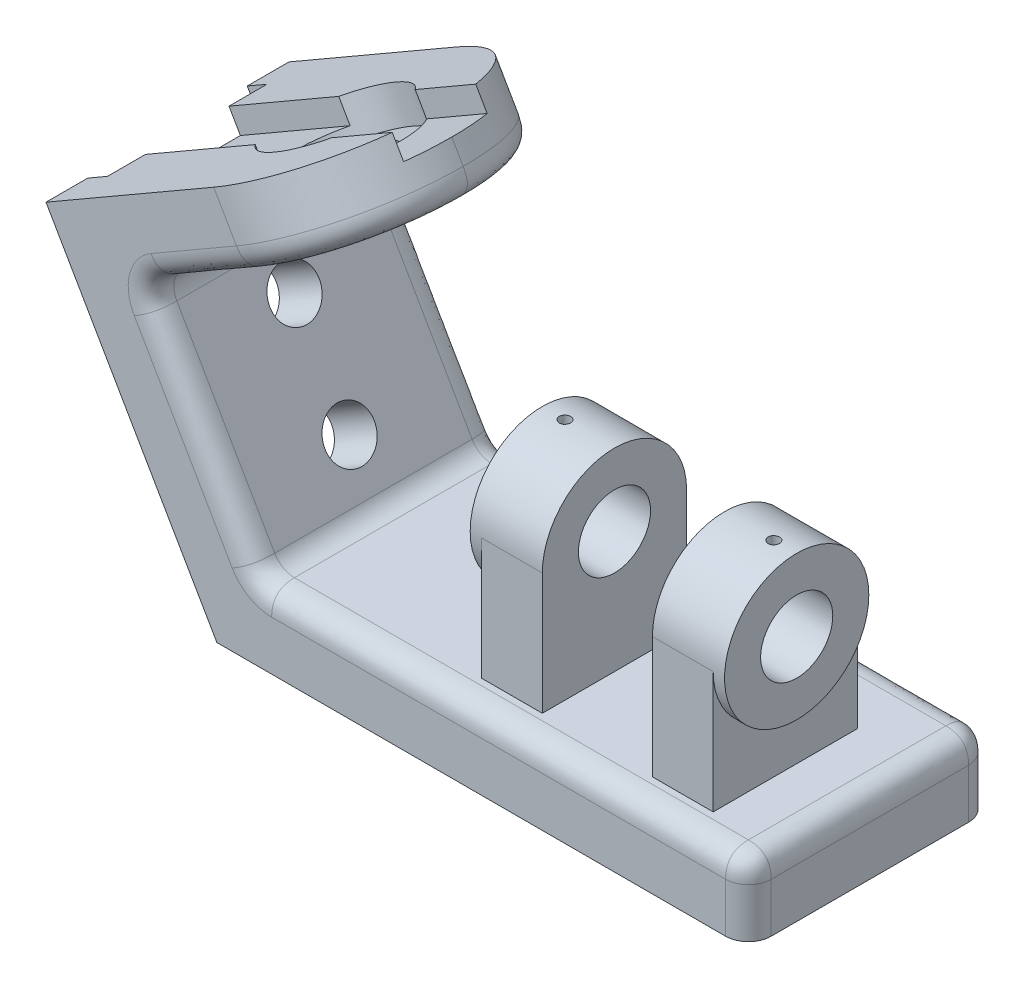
ISO-10303-21;
HEADER;
FILE_DESCRIPTION(('STEP AP214'),'2;1');
FILE_NAME('part.step','',(''),(''),'','','');
FILE_SCHEMA(('AUTOMOTIVE_DESIGN { 1 0 10303 214 1 1 1 1 }'));
ENDSEC;
DATA;
#1=APPLICATION_CONTEXT('core data for automotive mechanical design processes');
#2=APPLICATION_PROTOCOL_DEFINITION('international standard','automotive_design',2000,#1);
#3=PRODUCT_CONTEXT('',#1,'mechanical');
#4=PRODUCT('Part','Part','',(#3));
#5=PRODUCT_RELATED_PRODUCT_CATEGORY('part','',(#4));
#6=PRODUCT_DEFINITION_FORMATION('','',#4);
#7=PRODUCT_DEFINITION_CONTEXT('part definition',#1,'design');
#8=PRODUCT_DEFINITION('design','',#6,#7);
#9=PRODUCT_DEFINITION_SHAPE('','',#8);
#10=(LENGTH_UNIT() NAMED_UNIT(*) SI_UNIT(.MILLI.,.METRE.));
#11=(NAMED_UNIT(*) PLANE_ANGLE_UNIT() SI_UNIT($,.RADIAN.));
#12=(NAMED_UNIT(*) SI_UNIT($,.STERADIAN.) SOLID_ANGLE_UNIT());
#13=UNCERTAINTY_MEASURE_WITH_UNIT(LENGTH_MEASURE(1.E-05),#10,'distance_accuracy_value','');
#14=(GEOMETRIC_REPRESENTATION_CONTEXT(3) GLOBAL_UNCERTAINTY_ASSIGNED_CONTEXT((#13)) GLOBAL_UNIT_ASSIGNED_CONTEXT((#10,
#11,#12)) REPRESENTATION_CONTEXT('',''));
#15=CARTESIAN_POINT('',(0.,0.,0.));
#16=DIRECTION('',(0.,0.,1.));
#17=DIRECTION('',(1.,0.,0.));
#18=AXIS2_PLACEMENT_3D('',#15,#16,#17);
#19=CARTESIAN_POINT('',(-22.6080229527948,51.,37.2777843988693));
#20=DIRECTION('',(-1.,0.,0.));
#21=DIRECTION('',(0.,0.,1.));
#22=AXIS2_PLACEMENT_3D('',#19,#20,#21);
#23=PLANE('',#22);
#24=DIRECTION('',(0.,-1.,0.));
#25=VECTOR('',#24,1.);
#26=CARTESIAN_POINT('',(-22.6080229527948,19.,56.2777843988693));
#27=LINE('',#26,#25);
#28=CARTESIAN_POINT('',(-22.6080229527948,51.,56.2777843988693));
#29=VERTEX_POINT('',#28);
#30=CARTESIAN_POINT('',(-22.6080229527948,19.,56.2777843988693));
#31=VERTEX_POINT('',#30);
#32=EDGE_CURVE('E326',#29,#31,#27,.T.);
#33=ORIENTED_EDGE('',*,*,#32,.F.);
#34=CARTESIAN_POINT('',(-22.6080229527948,51.,37.2777843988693));
#35=DIRECTION('',(-1.,0.,0.));
#36=DIRECTION('',(0.,0.,1.));
#37=AXIS2_PLACEMENT_3D('',#34,#35,#36);
#38=CIRCLE('',#37,19.);
#39=CARTESIAN_POINT('',(-22.6080229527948,51.,18.2777843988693));
#40=VERTEX_POINT('',#39);
#41=EDGE_CURVE('E320',#29,#40,#38,.F.);
#42=ORIENTED_EDGE('',*,*,#41,.T.);
#43=DIRECTION('',(0.,1.,0.));
#44=VECTOR('',#43,1.);
#45=CARTESIAN_POINT('',(-22.6080229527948,51.,18.2777843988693));
#46=LINE('',#45,#44);
#47=CARTESIAN_POINT('',(-22.6080229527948,19.,18.2777843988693));
#48=VERTEX_POINT('',#47);
#49=EDGE_CURVE('E324',#48,#40,#46,.T.);
#50=ORIENTED_EDGE('',*,*,#49,.F.);
#51=DIRECTION('',(0.,0.,-1.));
#52=VECTOR('',#51,1.);
#53=CARTESIAN_POINT('',(-22.6080229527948,19.,18.2777843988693));
#54=LINE('',#53,#52);
#55=EDGE_CURVE('E351',#31,#48,#54,.T.);
#56=ORIENTED_EDGE('',*,*,#55,.F.);
#57=EDGE_LOOP('',(#33,#42,#50,#56));
#58=FACE_BOUND('',#57,.T.);
#59=ADVANCED_FACE('F55',(#58),#23,.T.);
#60=CARTESIAN_POINT('',(38.3919770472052,51.,37.2777843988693));
#61=DIRECTION('',(-1.,0.,0.));
#62=DIRECTION('',(0.,0.,1.));
#63=AXIS2_PLACEMENT_3D('',#60,#61,#62);
#64=PLANE('',#63);
#65=CARTESIAN_POINT('',(38.3919770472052,51.,37.2777843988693));
#66=DIRECTION('',(-1.,0.,0.));
#67=DIRECTION('',(0.,0.,1.));
#68=AXIS2_PLACEMENT_3D('',#65,#66,#67);
#69=CIRCLE('',#68,19.);
#70=CARTESIAN_POINT('',(38.3919770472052,51.,56.2777843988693));
#71=VERTEX_POINT('',#70);
#72=CARTESIAN_POINT('',(38.3919770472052,51.,18.2777843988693));
#73=VERTEX_POINT('',#72);
#74=EDGE_CURVE('E332',#71,#73,#69,.F.);
#75=ORIENTED_EDGE('',*,*,#74,.F.);
#76=DIRECTION('',(0.,-1.,0.));
#77=VECTOR('',#76,1.);
#78=CARTESIAN_POINT('',(38.3919770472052,19.,56.2777843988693));
#79=LINE('',#78,#77);
#80=CARTESIAN_POINT('',(38.3919770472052,19.,56.2777843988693));
#81=VERTEX_POINT('',#80);
#82=EDGE_CURVE('E359',#71,#81,#79,.T.);
#83=ORIENTED_EDGE('',*,*,#82,.T.);
#84=DIRECTION('',(0.,0.,-1.));
#85=VECTOR('',#84,1.);
#86=CARTESIAN_POINT('',(38.3919770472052,19.,18.2777843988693));
#87=LINE('',#86,#85);
#88=CARTESIAN_POINT('',(38.3919770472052,19.,18.2777843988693));
#89=VERTEX_POINT('',#88);
#90=EDGE_CURVE('E363',#81,#89,#87,.T.);
#91=ORIENTED_EDGE('',*,*,#90,.T.);
#92=DIRECTION('',(0.,1.,0.));
#93=VECTOR('',#92,1.);
#94=CARTESIAN_POINT('',(38.3919770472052,51.,18.2777843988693));
#95=LINE('',#94,#93);
#96=EDGE_CURVE('E367',#89,#73,#95,.T.);
#97=ORIENTED_EDGE('',*,*,#96,.T.);
#98=EDGE_LOOP('',(#75,#83,#91,#97));
#99=FACE_BOUND('',#98,.T.);
#100=ADVANCED_FACE('F649',(#99),#64,.F.);
#101=CARTESIAN_POINT('',(-22.6080229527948,19.,56.2777843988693));
#102=DIRECTION('',(0.,0.,1.));
#103=DIRECTION('',(1.,0.,0.));
#104=AXIS2_PLACEMENT_3D('',#101,#102,#103);
#105=PLANE('',#104);
#106=DIRECTION('',(1.,0.,0.));
#107=VECTOR('',#106,1.);
#108=CARTESIAN_POINT('',(-22.6080229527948,19.,56.2777843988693));
#109=LINE('',#108,#107);
#110=CARTESIAN_POINT('',(-6.60802295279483,19.,56.2777843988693));
#111=VERTEX_POINT('',#110);
#112=EDGE_CURVE('E375',#31,#111,#109,.T.);
#113=ORIENTED_EDGE('',*,*,#112,.T.);
#114=DIRECTION('',(0.,1.,0.));
#115=VECTOR('',#114,1.);
#116=CARTESIAN_POINT('',(-6.60802295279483,19.,56.2777843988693));
#117=LINE('',#116,#115);
#118=CARTESIAN_POINT('',(-6.60802295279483,51.,56.2777843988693));
#119=VERTEX_POINT('',#118);
#120=EDGE_CURVE('E368',#111,#119,#117,.T.);
#121=ORIENTED_EDGE('',*,*,#120,.T.);
#122=DIRECTION('',(1.,0.,0.));
#123=VECTOR('',#122,1.);
#124=CARTESIAN_POINT('',(-22.6080229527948,51.,56.2777843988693));
#125=LINE('',#124,#123);
#126=EDGE_CURVE('E381',#29,#119,#125,.T.);
#127=ORIENTED_EDGE('',*,*,#126,.F.);
#128=ORIENTED_EDGE('',*,*,#32,.T.);
#129=EDGE_LOOP('',(#113,#121,#127,#128));
#130=FACE_BOUND('',#129,.T.);
#131=ADVANCED_FACE('F874',(#130),#105,.T.);
#132=CARTESIAN_POINT('',(22.3919770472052,51.,56.2777843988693));
#133=VERTEX_POINT('',#132);
#134=EDGE_CURVE('E343',#133,#71,#125,.T.);
#135=ORIENTED_EDGE('',*,*,#134,.F.);
#136=DIRECTION('',(0.,-1.,0.));
#137=VECTOR('',#136,1.);
#138=CARTESIAN_POINT('',(22.3919770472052,19.,56.2777843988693));
#139=LINE('',#138,#137);
#140=CARTESIAN_POINT('',(22.3919770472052,19.,56.2777843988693));
#141=VERTEX_POINT('',#140);
#142=EDGE_CURVE('E635',#133,#141,#139,.T.);
#143=ORIENTED_EDGE('',*,*,#142,.T.);
#144=EDGE_CURVE('E380',#141,#81,#109,.T.);
#145=ORIENTED_EDGE('',*,*,#144,.T.);
#146=ORIENTED_EDGE('',*,*,#82,.F.);
#147=EDGE_LOOP('',(#135,#143,#145,#146));
#148=FACE_BOUND('',#147,.T.);
#149=ADVANCED_FACE('F872',(#148),#105,.T.);
#150=CARTESIAN_POINT('',(-22.6080229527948,51.,37.2777843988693));
#151=DIRECTION('',(1.,0.,0.));
#152=DIRECTION('',(0.,0.,-1.));
#153=AXIS2_PLACEMENT_3D('',#150,#151,#152);
#154=CYLINDRICAL_SURFACE('',#153,19.);
#155=CARTESIAN_POINT('',(-19.6080229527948,69.9406969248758,38.7777843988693));
#156=CARTESIAN_POINT('',(-19.523908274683,69.940697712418,38.7777807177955));
#157=CARTESIAN_POINT('',(-19.4397359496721,69.9412632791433,38.770685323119));
#158=CARTESIAN_POINT('',(-19.2737191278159,69.9434644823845,38.7424842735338));
#159=CARTESIAN_POINT('',(-19.191877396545,69.9451013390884,38.7213626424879));
#160=CARTESIAN_POINT('',(-19.0329503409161,69.9492585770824,38.6657228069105));
#161=CARTESIAN_POINT('',(-18.9558623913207,69.9517784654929,38.6312120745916));
#162=CARTESIAN_POINT('',(-18.8085921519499,69.9574172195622,38.5497866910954));
#163=CARTESIAN_POINT('',(-18.7384083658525,69.960535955,38.5028747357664));
#164=CARTESIAN_POINT('',(-18.606757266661,69.9670291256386,38.3978608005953));
#165=CARTESIAN_POINT('',(-18.5453081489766,69.9704040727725,38.3397360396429));
#166=CARTESIAN_POINT('',(-18.4330269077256,69.9770246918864,38.2139944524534));
#167=CARTESIAN_POINT('',(-18.3821952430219,69.9802703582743,38.1463772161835));
#168=CARTESIAN_POINT('',(-18.2925321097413,69.9862714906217,38.0034625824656));
#169=CARTESIAN_POINT('',(-18.2537162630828,69.9890263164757,37.9281553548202));
#170=CARTESIAN_POINT('',(-18.1892865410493,69.9937298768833,37.7720670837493));
#171=CARTESIAN_POINT('',(-18.1636724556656,69.9956786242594,37.691286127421));
#172=CARTESIAN_POINT('',(-18.1264253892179,69.9985468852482,37.5267235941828));
#173=CARTESIAN_POINT('',(-18.1147631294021,69.999468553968,37.4429486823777));
#174=CARTESIAN_POINT('',(-18.1056602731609,70.0001861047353,37.2746257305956));
#175=CARTESIAN_POINT('',(-18.1082194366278,69.9999820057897,37.1900777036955));
#176=CARTESIAN_POINT('',(-18.1274627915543,69.9984728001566,37.0228070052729));
#177=CARTESIAN_POINT('',(-18.144115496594,69.9971701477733,36.9400806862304));
#178=CARTESIAN_POINT('',(-18.1910242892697,69.9936132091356,36.7786010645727));
#179=CARTESIAN_POINT('',(-18.2212804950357,69.9913589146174,36.6998477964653));
#180=CARTESIAN_POINT('',(-18.294572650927,69.9861481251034,36.5484493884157));
#181=CARTESIAN_POINT('',(-18.3376227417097,69.9831908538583,36.4758111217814));
#182=CARTESIAN_POINT('',(-18.4352703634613,69.9769065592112,36.3387796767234));
#183=CARTESIAN_POINT('',(-18.4898681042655,69.9735795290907,36.2743866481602));
#184=CARTESIAN_POINT('',(-18.6092387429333,69.9669190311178,36.1554895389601));
#185=CARTESIAN_POINT('',(-18.6740389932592,69.963585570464,36.1010129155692));
#186=CARTESIAN_POINT('',(-18.8118797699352,69.9572970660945,36.003707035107));
#187=CARTESIAN_POINT('',(-18.8849203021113,69.9543420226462,35.9608777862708));
#188=CARTESIAN_POINT('',(-19.0371871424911,69.9491443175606,35.8880836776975));
#189=CARTESIAN_POINT('',(-19.1164141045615,69.9469017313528,35.8581201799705));
#190=CARTESIAN_POINT('',(-19.2787959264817,69.9433842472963,35.8119281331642));
#191=CARTESIAN_POINT('',(-19.3619507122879,69.9421093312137,35.7956993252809));
#192=CARTESIAN_POINT('',(-19.5295876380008,69.9406744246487,35.7774719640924));
#193=CARTESIAN_POINT('',(-19.6140655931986,69.9405114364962,35.7754351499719));
#194=CARTESIAN_POINT('',(-19.7821617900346,69.9413109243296,35.7855494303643));
#195=CARTESIAN_POINT('',(-19.8657800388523,69.942273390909,35.7977004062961));
#196=CARTESIAN_POINT('',(-20.0296737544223,69.9452126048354,35.8358134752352));
#197=CARTESIAN_POINT('',(-20.1099533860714,69.947188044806,35.8617577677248));
#198=CARTESIAN_POINT('',(-20.2650199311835,69.9519295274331,35.9267029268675));
#199=CARTESIAN_POINT('',(-20.3398067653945,69.9546955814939,35.9657039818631));
#200=CARTESIAN_POINT('',(-20.4819400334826,69.9607138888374,36.0557526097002));
#201=CARTESIAN_POINT('',(-20.5492702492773,69.963967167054,36.1068257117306));
#202=CARTESIAN_POINT('',(-20.6744152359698,69.9705898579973,36.2195317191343));
#203=CARTESIAN_POINT('',(-20.732229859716,69.9739592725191,36.2811647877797));
#204=CARTESIAN_POINT('',(-20.8368327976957,69.9804434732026,36.4134063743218));
#205=CARTESIAN_POINT('',(-20.8835962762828,69.9835576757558,36.4840345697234));
#206=CARTESIAN_POINT('',(-20.9645991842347,69.9891721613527,36.6321632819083));
#207=CARTESIAN_POINT('',(-20.9988387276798,69.9916724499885,36.7096637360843));
#208=CARTESIAN_POINT('',(-21.0537790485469,69.9957746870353,36.8692474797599));
#209=CARTESIAN_POINT('',(-21.0744952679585,69.9973776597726,36.9513254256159));
#210=CARTESIAN_POINT('',(-21.1018513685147,69.999508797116,37.1178077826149));
#211=CARTESIAN_POINT('',(-21.1084914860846,70.0000369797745,37.2022121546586));
#212=CARTESIAN_POINT('',(-21.1075042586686,69.9999590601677,37.3707064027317));
#213=CARTESIAN_POINT('',(-21.0999156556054,69.9993560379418,37.4547965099));
#214=CARTESIAN_POINT('',(-21.0707670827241,69.9970895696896,37.6205041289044));
#215=CARTESIAN_POINT('',(-21.0492070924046,69.9954261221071,37.7021216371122));
#216=CARTESIAN_POINT('',(-20.9927373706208,69.9912255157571,37.8605704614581));
#217=CARTESIAN_POINT('',(-20.957828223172,69.9886883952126,37.9374019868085));
#218=CARTESIAN_POINT('',(-20.8756557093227,69.9830245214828,38.08411980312));
#219=CARTESIAN_POINT('',(-20.828392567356,69.9798977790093,38.1540062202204));
#220=CARTESIAN_POINT('',(-20.7227084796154,69.9733956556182,38.2850480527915));
#221=CARTESIAN_POINT('',(-20.6642589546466,69.9700196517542,38.3461803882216));
#222=CARTESIAN_POINT('',(-20.5379109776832,69.963404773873,38.4577903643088));
#223=CARTESIAN_POINT('',(-20.4700102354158,69.9601659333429,38.5082654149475));
#224=CARTESIAN_POINT('',(-20.3265683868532,69.9541860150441,38.5971889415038));
#225=CARTESIAN_POINT('',(-20.25101432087,69.9514458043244,38.6356165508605));
#226=CARTESIAN_POINT('',(-20.0945571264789,69.9467840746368,38.6991917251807));
#227=CARTESIAN_POINT('',(-20.013660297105,69.9448616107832,38.7243546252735));
#228=CARTESIAN_POINT('',(-19.8782387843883,69.9425496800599,38.7542465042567));
#229=CARTESIAN_POINT('',(-19.8245861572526,69.941858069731,38.763061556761));
#230=CARTESIAN_POINT('',(-19.7166380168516,69.9409314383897,38.7748316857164));
#231=CARTESIAN_POINT('',(-19.6623425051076,69.940696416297,38.7777867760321));
#232=CARTESIAN_POINT('',(-19.6080229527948,69.9406969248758,38.7777843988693));
#233=B_SPLINE_CURVE_WITH_KNOTS('',3,(#155,#156,#157,#158,#159,#160,#161,#162,#163,#164,#165,
#166,#167,#168,#169,#170,#171,#172,#173,#174,#175,#176,#177,#178,#179,#180,#181,#182,#183,#184,
#185,#186,#187,#188,#189,#190,#191,#192,#193,#194,#195,#196,#197,#198,#199,#200,#201,#202,#203,
#204,#205,#206,#207,#208,#209,#210,#211,#212,#213,#214,#215,#216,#217,#218,#219,#220,#221,#222,
#223,#224,#225,#226,#227,#228,#229,#230,#231,#232),.UNSPECIFIED.,.T.,.F.,(4,2,2,2,2,2,2,2,2,2,2,
2,2,2,2,2,2,2,2,2,2,2,2,2,2,2,2,2,2,2,2,2,2,2,2,2,2,2,4),(0.,0.252145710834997,
0.504579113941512,0.756871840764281,1.00910976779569,1.2618656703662,1.51463249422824,
1.76772657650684,2.02081663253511,2.2733746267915,2.52592835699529,2.77791934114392,
3.02991251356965,3.28218524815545,3.53446256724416,3.78742812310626,4.04039385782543,
4.29338636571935,4.54637410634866,4.79867954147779,5.0509828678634,5.30296137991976,
5.55494352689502,5.80746339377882,6.05998716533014,6.31307315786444,6.56615684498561,
6.81895103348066,7.07174097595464,7.32384362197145,7.57594663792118,7.82803862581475,
8.0801260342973,8.33286629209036,8.58566790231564,8.83890498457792,9.09184865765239,
9.25467962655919,9.41751021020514),.UNSPECIFIED.);
#234=CARTESIAN_POINT('',(-19.6080229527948,69.9406969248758,38.7777843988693));
#235=VERTEX_POINT('',#234);
#236=EDGE_CURVE('E815',#235,#235,#233,.T.);
#237=ORIENTED_EDGE('',*,*,#236,.F.);
#238=EDGE_LOOP('',(#237));
#239=FACE_BOUND('',#238,.T.);
#240=ORIENTED_EDGE('',*,*,#126,.T.);
#241=CARTESIAN_POINT('',(-6.60802295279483,51.,37.2777843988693));
#242=DIRECTION('',(1.,0.,0.));
#243=DIRECTION('',(0.,0.,-1.));
#244=AXIS2_PLACEMENT_3D('',#241,#242,#243);
#245=CIRCLE('',#244,19.);
#246=CARTESIAN_POINT('',(-6.60802295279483,51.,18.2777843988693));
#247=VERTEX_POINT('',#246);
#248=EDGE_CURVE('E339',#119,#247,#245,.F.);
#249=ORIENTED_EDGE('',*,*,#248,.T.);
#250=DIRECTION('',(1.,0.,0.));
#251=VECTOR('',#250,1.);
#252=CARTESIAN_POINT('',(-22.6080229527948,51.,18.2777843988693));
#253=LINE('',#252,#251);
#254=EDGE_CURVE('E336',#40,#247,#253,.T.);
#255=ORIENTED_EDGE('',*,*,#254,.F.);
#256=ORIENTED_EDGE('',*,*,#41,.F.);
#257=EDGE_LOOP('',(#240,#249,#255,#256));
#258=FACE_BOUND('',#257,.T.);
#259=CARTESIAN_POINT('',(-25.6080229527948,51.,37.2777843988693));
#260=DIRECTION('',(-1.,0.,0.));
#261=DIRECTION('',(0.,0.,1.));
#262=AXIS2_PLACEMENT_3D('',#259,#260,#261);
#263=CIRCLE('',#262,19.);
#264=CARTESIAN_POINT('',(-25.6080229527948,51.,56.2777843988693));
#265=VERTEX_POINT('',#264);
#266=EDGE_CURVE('E729',#265,#265,#263,.T.);
#267=ORIENTED_EDGE('',*,*,#266,.F.);
#268=EDGE_LOOP('',(#267));
#269=FACE_BOUND('',#268,.T.);
#270=ADVANCED_FACE('F337',(#239,#258,#269),#154,.T.);
#271=CARTESIAN_POINT('',(35.3919770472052,69.9406969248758,38.7777843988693));
#272=CARTESIAN_POINT('',(35.476091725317,69.940697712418,38.7777807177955));
#273=CARTESIAN_POINT('',(35.5602640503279,69.9412632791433,38.770685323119));
#274=CARTESIAN_POINT('',(35.7262808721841,69.9434644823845,38.7424842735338));
#275=CARTESIAN_POINT('',(35.8081226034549,69.9451013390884,38.7213626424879));
#276=CARTESIAN_POINT('',(35.9670496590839,69.9492585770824,38.6657228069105));
#277=CARTESIAN_POINT('',(36.0441376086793,69.9517784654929,38.6312120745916));
#278=CARTESIAN_POINT('',(36.1914078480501,69.9574172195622,38.5497866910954));
#279=CARTESIAN_POINT('',(36.2615916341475,69.960535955,38.5028747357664));
#280=CARTESIAN_POINT('',(36.393242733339,69.9670291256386,38.3978608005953));
#281=CARTESIAN_POINT('',(36.4546918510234,69.9704040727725,38.3397360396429));
#282=CARTESIAN_POINT('',(36.5669730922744,69.9770246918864,38.2139944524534));
#283=CARTESIAN_POINT('',(36.6178047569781,69.9802703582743,38.1463772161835));
#284=CARTESIAN_POINT('',(36.7074678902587,69.9862714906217,38.0034625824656));
#285=CARTESIAN_POINT('',(36.7462837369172,69.9890263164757,37.9281553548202));
#286=CARTESIAN_POINT('',(36.8107134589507,69.9937298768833,37.7720670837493));
#287=CARTESIAN_POINT('',(36.8363275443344,69.9956786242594,37.691286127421));
#288=CARTESIAN_POINT('',(36.8735746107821,69.9985468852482,37.5267235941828));
#289=CARTESIAN_POINT('',(36.8852368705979,69.999468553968,37.4429486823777));
#290=CARTESIAN_POINT('',(36.8943397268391,70.0001861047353,37.2746257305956));
#291=CARTESIAN_POINT('',(36.8917805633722,69.9999820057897,37.1900777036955));
#292=CARTESIAN_POINT('',(36.8725372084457,69.9984728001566,37.0228070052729));
#293=CARTESIAN_POINT('',(36.855884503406,69.9971701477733,36.9400806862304));
#294=CARTESIAN_POINT('',(36.8089757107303,69.9936132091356,36.7786010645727));
#295=CARTESIAN_POINT('',(36.7787195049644,69.9913589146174,36.6998477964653));
#296=CARTESIAN_POINT('',(36.705427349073,69.9861481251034,36.5484493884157));
#297=CARTESIAN_POINT('',(36.6623772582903,69.9831908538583,36.4758111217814));
#298=CARTESIAN_POINT('',(36.5647296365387,69.9769065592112,36.3387796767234));
#299=CARTESIAN_POINT('',(36.5101318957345,69.9735795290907,36.2743866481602));
#300=CARTESIAN_POINT('',(36.3907612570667,69.9669190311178,36.1554895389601));
#301=CARTESIAN_POINT('',(36.3259610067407,69.963585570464,36.1010129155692));
#302=CARTESIAN_POINT('',(36.1881202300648,69.9572970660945,36.003707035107));
#303=CARTESIAN_POINT('',(36.1150796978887,69.9543420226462,35.9608777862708));
#304=CARTESIAN_POINT('',(35.9628128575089,69.9491443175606,35.8880836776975));
#305=CARTESIAN_POINT('',(35.8835858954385,69.9469017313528,35.8581201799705));
#306=CARTESIAN_POINT('',(35.7212040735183,69.9433842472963,35.8119281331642));
#307=CARTESIAN_POINT('',(35.6380492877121,69.9421093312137,35.7956993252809));
#308=CARTESIAN_POINT('',(35.4704123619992,69.9406744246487,35.7774719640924));
#309=CARTESIAN_POINT('',(35.3859344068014,69.9405114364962,35.7754351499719));
#310=CARTESIAN_POINT('',(35.2178382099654,69.9413109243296,35.7855494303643));
#311=CARTESIAN_POINT('',(35.1342199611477,69.942273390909,35.7977004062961));
#312=CARTESIAN_POINT('',(34.9703262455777,69.9452126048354,35.8358134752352));
#313=CARTESIAN_POINT('',(34.8900466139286,69.947188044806,35.8617577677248));
#314=CARTESIAN_POINT('',(34.7349800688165,69.9519295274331,35.9267029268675));
#315=CARTESIAN_POINT('',(34.6601932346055,69.9546955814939,35.9657039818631));
#316=CARTESIAN_POINT('',(34.5180599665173,69.9607138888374,36.0557526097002));
#317=CARTESIAN_POINT('',(34.4507297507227,69.963967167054,36.1068257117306));
#318=CARTESIAN_POINT('',(34.3255847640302,69.9705898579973,36.2195317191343));
#319=CARTESIAN_POINT('',(34.267770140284,69.9739592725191,36.2811647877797));
#320=CARTESIAN_POINT('',(34.1631672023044,69.9804434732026,36.4134063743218));
#321=CARTESIAN_POINT('',(34.1164037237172,69.9835576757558,36.4840345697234));
#322=CARTESIAN_POINT('',(34.0354008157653,69.9891721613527,36.6321632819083));
#323=CARTESIAN_POINT('',(34.0011612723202,69.9916724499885,36.7096637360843));
#324=CARTESIAN_POINT('',(33.9462209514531,69.9957746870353,36.8692474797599));
#325=CARTESIAN_POINT('',(33.9255047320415,69.9973776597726,36.9513254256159));
#326=CARTESIAN_POINT('',(33.8981486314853,69.999508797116,37.1178077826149));
#327=CARTESIAN_POINT('',(33.8915085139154,70.0000369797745,37.2022121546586));
#328=CARTESIAN_POINT('',(33.8924957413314,69.9999590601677,37.3707064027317));
#329=CARTESIAN_POINT('',(33.9000843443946,69.9993560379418,37.4547965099));
#330=CARTESIAN_POINT('',(33.9292329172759,69.9970895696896,37.6205041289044));
#331=CARTESIAN_POINT('',(33.9507929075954,69.9954261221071,37.7021216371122));
#332=CARTESIAN_POINT('',(34.0072626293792,69.9912255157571,37.8605704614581));
#333=CARTESIAN_POINT('',(34.042171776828,69.9886883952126,37.9374019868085));
#334=CARTESIAN_POINT('',(34.1243442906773,69.9830245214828,38.08411980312));
#335=CARTESIAN_POINT('',(34.1716074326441,69.9798977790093,38.1540062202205));
#336=CARTESIAN_POINT('',(34.2772915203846,69.9733956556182,38.2850480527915));
#337=CARTESIAN_POINT('',(34.3357410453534,69.9700196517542,38.3461803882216));
#338=CARTESIAN_POINT('',(34.4620890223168,69.963404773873,38.4577903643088));
#339=CARTESIAN_POINT('',(34.5299897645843,69.9601659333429,38.5082654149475));
#340=CARTESIAN_POINT('',(34.6734316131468,69.9541860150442,38.5971889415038));
#341=CARTESIAN_POINT('',(34.74898567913,69.9514458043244,38.6356165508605));
#342=CARTESIAN_POINT('',(34.905442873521,69.9467840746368,38.6991917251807));
#343=CARTESIAN_POINT('',(34.986339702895,69.9448616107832,38.7243546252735));
#344=CARTESIAN_POINT('',(35.1217612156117,69.9425496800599,38.7542465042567));
#345=CARTESIAN_POINT('',(35.1754138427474,69.941858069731,38.763061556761));
#346=CARTESIAN_POINT('',(35.2833619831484,69.9409314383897,38.7748316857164));
#347=CARTESIAN_POINT('',(35.3376574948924,69.940696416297,38.7777867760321));
#348=CARTESIAN_POINT('',(35.3919770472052,69.9406969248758,38.7777843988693));
#349=B_SPLINE_CURVE_WITH_KNOTS('',3,(#271,#272,#273,#274,#275,#276,#277,#278,#279,#280,#281,
#282,#283,#284,#285,#286,#287,#288,#289,#290,#291,#292,#293,#294,#295,#296,#297,#298,#299,#300,
#301,#302,#303,#304,#305,#306,#307,#308,#309,#310,#311,#312,#313,#314,#315,#316,#317,#318,#319,
#320,#321,#322,#323,#324,#325,#326,#327,#328,#329,#330,#331,#332,#333,#334,#335,#336,#337,#338,
#339,#340,#341,#342,#343,#344,#345,#346,#347,#348),.UNSPECIFIED.,.T.,.F.,(4,2,2,2,2,2,2,2,2,2,2,
2,2,2,2,2,2,2,2,2,2,2,2,2,2,2,2,2,2,2,2,2,2,2,2,2,2,2,4),(0.,0.252145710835,0.504579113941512,
0.756871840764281,1.0091097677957,1.2618656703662,1.51463249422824,1.76772657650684,
2.02081663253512,2.27337462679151,2.5259283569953,2.77791934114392,3.02991251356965,
3.28218524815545,3.53446256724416,3.78742812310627,4.04039385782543,4.29338636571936,
4.54637410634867,4.7986795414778,5.05098286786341,5.30296137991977,5.55494352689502,
5.80746339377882,6.05998716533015,6.31307315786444,6.56615684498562,6.81895103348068,
7.07174097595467,7.32384362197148,7.5759466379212,7.82803862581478,8.08012603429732,
8.33286629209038,8.58566790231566,8.83890498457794,9.09184865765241,9.25467962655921,
9.41751021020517),.UNSPECIFIED.);
#350=CARTESIAN_POINT('',(35.3919770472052,69.9406969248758,38.7777843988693));
#351=VERTEX_POINT('',#350);
#352=EDGE_CURVE('E825',#351,#351,#349,.T.);
#353=ORIENTED_EDGE('',*,*,#352,.F.);
#354=EDGE_LOOP('',(#353));
#355=FACE_BOUND('',#354,.T.);
#356=CARTESIAN_POINT('',(22.3919770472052,51.,18.2777843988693));
#357=VERTEX_POINT('',#356);
#358=EDGE_CURVE('E344',#357,#73,#253,.T.);
#359=ORIENTED_EDGE('',*,*,#358,.F.);
#360=CARTESIAN_POINT('',(22.3919770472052,51.,37.2777843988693));
#361=DIRECTION('',(-1.,0.,0.));
#362=DIRECTION('',(0.,0.,1.));
#363=AXIS2_PLACEMENT_3D('',#360,#361,#362);
#364=CIRCLE('',#363,19.);
#365=EDGE_CURVE('E696',#357,#133,#364,.F.);
#366=ORIENTED_EDGE('',*,*,#365,.T.);
#367=ORIENTED_EDGE('',*,*,#134,.T.);
#368=ORIENTED_EDGE('',*,*,#74,.T.);
#369=EDGE_LOOP('',(#359,#366,#367,#368));
#370=FACE_BOUND('',#369,.T.);
#371=CARTESIAN_POINT('',(41.3919770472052,51.,37.2777843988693));
#372=DIRECTION('',(1.,0.,0.));
#373=DIRECTION('',(0.,0.,-1.));
#374=AXIS2_PLACEMENT_3D('',#371,#372,#373);
#375=CIRCLE('',#374,19.);
#376=CARTESIAN_POINT('',(41.3919770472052,51.,18.2777843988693));
#377=VERTEX_POINT('',#376);
#378=EDGE_CURVE('E717',#377,#377,#375,.T.);
#379=ORIENTED_EDGE('',*,*,#378,.F.);
#380=EDGE_LOOP('',(#379));
#381=FACE_BOUND('',#380,.T.);
#382=ADVANCED_FACE('F644',(#355,#370,#381),#154,.T.);
#383=CARTESIAN_POINT('',(-22.6080229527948,51.,18.2777843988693));
#384=DIRECTION('',(0.,0.,-1.));
#385=DIRECTION('',(0.,1.,0.));
#386=AXIS2_PLACEMENT_3D('',#383,#384,#385);
#387=PLANE('',#386);
#388=ORIENTED_EDGE('',*,*,#254,.T.);
#389=DIRECTION('',(0.,-1.,0.));
#390=VECTOR('',#389,1.);
#391=CARTESIAN_POINT('',(-6.60802295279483,51.,18.2777843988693));
#392=LINE('',#391,#390);
#393=CARTESIAN_POINT('',(-6.60802295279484,19.,18.2777843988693));
#394=VERTEX_POINT('',#393);
#395=EDGE_CURVE('E634',#247,#394,#392,.T.);
#396=ORIENTED_EDGE('',*,*,#395,.T.);
#397=DIRECTION('',(1.,0.,0.));
#398=VECTOR('',#397,1.);
#399=CARTESIAN_POINT('',(-22.6080229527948,19.,18.2777843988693));
#400=LINE('',#399,#398);
#401=EDGE_CURVE('E349',#48,#394,#400,.T.);
#402=ORIENTED_EDGE('',*,*,#401,.F.);
#403=ORIENTED_EDGE('',*,*,#49,.T.);
#404=EDGE_LOOP('',(#388,#396,#402,#403));
#405=FACE_BOUND('',#404,.T.);
#406=ADVANCED_FACE('F347',(#405),#387,.T.);
#407=CARTESIAN_POINT('',(22.3919770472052,19.,18.2777843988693));
#408=VERTEX_POINT('',#407);
#409=EDGE_CURVE('E357',#408,#89,#400,.T.);
#410=ORIENTED_EDGE('',*,*,#409,.F.);
#411=DIRECTION('',(0.,1.,0.));
#412=VECTOR('',#411,1.);
#413=CARTESIAN_POINT('',(22.3919770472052,51.,18.2777843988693));
#414=LINE('',#413,#412);
#415=EDGE_CURVE('E629',#408,#357,#414,.T.);
#416=ORIENTED_EDGE('',*,*,#415,.T.);
#417=ORIENTED_EDGE('',*,*,#358,.T.);
#418=ORIENTED_EDGE('',*,*,#96,.F.);
#419=EDGE_LOOP('',(#410,#416,#417,#418));
#420=FACE_BOUND('',#419,.T.);
#421=ADVANCED_FACE('F654',(#420),#387,.T.);
#422=CARTESIAN_POINT('',(-22.6080229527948,51.,37.2777843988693));
#423=DIRECTION('',(1.,0.,0.));
#424=DIRECTION('',(0.,0.,-1.));
#425=AXIS2_PLACEMENT_3D('',#422,#423,#424);
#426=CYLINDRICAL_SURFACE('',#425,9.5);
#427=CARTESIAN_POINT('',(-19.6080229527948,60.3808315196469,38.7777843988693));
#428=CARTESIAN_POINT('',(-19.5243326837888,60.3808329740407,38.7777809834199));
#429=CARTESIAN_POINT('',(-19.4405951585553,60.3819636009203,38.7707566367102));
#430=CARTESIAN_POINT('',(-19.2754651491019,60.3863603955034,38.7428544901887));
#431=CARTESIAN_POINT('',(-19.1940749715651,60.3896285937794,38.7219635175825));
#432=CARTESIAN_POINT('',(-19.0360535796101,60.3979213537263,38.6669720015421));
#433=CARTESIAN_POINT('',(-18.9594186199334,60.4029445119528,38.632882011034));
#434=CARTESIAN_POINT('',(-18.8129660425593,60.414179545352,38.5524856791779));
#435=CARTESIAN_POINT('',(-18.7431475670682,60.4203912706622,38.5061808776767));
#436=CARTESIAN_POINT('',(-18.6116817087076,60.4333650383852,38.4022315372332));
#437=CARTESIAN_POINT('',(-18.5501034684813,60.4401310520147,38.3445000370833));
#438=CARTESIAN_POINT('',(-18.4374658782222,60.4534156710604,38.2195239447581));
#439=CARTESIAN_POINT('',(-18.3864071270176,60.4599342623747,38.1522788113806));
#440=CARTESIAN_POINT('',(-18.2960006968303,60.4720313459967,38.0097389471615));
#441=CARTESIAN_POINT('',(-18.2567170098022,60.4776046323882,37.9344031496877));
#442=CARTESIAN_POINT('',(-18.1913867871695,60.4871390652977,37.7780997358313));
#443=CARTESIAN_POINT('',(-18.165339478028,60.4911003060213,37.6971324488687));
#444=CARTESIAN_POINT('',(-18.1274318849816,60.4969362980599,37.5325776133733));
#445=CARTESIAN_POINT('',(-18.1154556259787,60.4988280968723,37.4490173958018));
#446=CARTESIAN_POINT('',(-18.1056697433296,60.5003705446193,37.2810534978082));
#447=CARTESIAN_POINT('',(-18.1078592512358,60.5000213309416,37.196649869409));
#448=CARTESIAN_POINT('',(-18.1262517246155,60.4971346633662,37.0301870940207));
#449=CARTESIAN_POINT('',(-18.1423299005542,60.4946166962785,36.9481137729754));
#450=CARTESIAN_POINT('',(-18.1878471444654,60.4876971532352,36.787844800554));
#451=CARTESIAN_POINT('',(-18.2172865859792,60.4832955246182,36.7096492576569));
#452=CARTESIAN_POINT('',(-18.2888167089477,60.4730698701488,36.5589808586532));
#453=CARTESIAN_POINT('',(-18.3309594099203,60.4672400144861,36.4865331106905));
#454=CARTESIAN_POINT('',(-18.4266617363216,60.4548067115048,36.3496905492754));
#455=CARTESIAN_POINT('',(-18.4802221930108,60.4482032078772,36.2852963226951));
#456=CARTESIAN_POINT('',(-18.5979334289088,60.4348732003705,36.165652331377));
#457=CARTESIAN_POINT('',(-18.6621932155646,60.4281461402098,36.1105098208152));
#458=CARTESIAN_POINT('',(-18.7991100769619,60.4153970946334,36.0117734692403));
#459=CARTESIAN_POINT('',(-18.8717672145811,60.4093751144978,35.96817971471));
#460=CARTESIAN_POINT('',(-19.0235338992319,60.3987180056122,35.8937608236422));
#461=CARTESIAN_POINT('',(-19.1026493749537,60.3940841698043,35.8629475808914));
#462=CARTESIAN_POINT('',(-19.2650223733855,60.386750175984,35.8150769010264));
#463=CARTESIAN_POINT('',(-19.3482795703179,60.3840498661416,35.7980183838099));
#464=CARTESIAN_POINT('',(-19.5156159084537,60.3809177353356,35.7782902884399));
#465=CARTESIAN_POINT('',(-19.5996766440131,60.3804618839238,35.7754682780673));
#466=CARTESIAN_POINT('',(-19.7670700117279,60.3818063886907,35.7838880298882));
#467=CARTESIAN_POINT('',(-19.8504026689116,60.3836066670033,35.795129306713));
#468=CARTESIAN_POINT('',(-20.0134966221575,60.3892384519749,35.8312269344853));
#469=CARTESIAN_POINT('',(-20.0932753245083,60.3930585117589,35.856006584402));
#470=CARTESIAN_POINT('',(-20.2475472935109,60.4022899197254,35.9183974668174));
#471=CARTESIAN_POINT('',(-20.3220402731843,60.4077013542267,35.956009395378));
#472=CARTESIAN_POINT('',(-20.4643072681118,60.4195620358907,36.0433604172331));
#473=CARTESIAN_POINT('',(-20.5320202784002,60.4260195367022,36.0931977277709));
#474=CARTESIAN_POINT('',(-20.6581764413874,60.4392202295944,36.2034490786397));
#475=CARTESIAN_POINT('',(-20.7166190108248,60.4459634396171,36.2638637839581));
#476=CARTESIAN_POINT('',(-20.8231269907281,60.4590512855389,36.3942281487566));
#477=CARTESIAN_POINT('',(-20.8710910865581,60.4653916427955,36.4642610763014));
#478=CARTESIAN_POINT('',(-20.9545729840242,60.4768919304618,36.6114790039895));
#479=CARTESIAN_POINT('',(-20.9900911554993,60.4820518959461,36.6886637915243));
#480=CARTESIAN_POINT('',(-21.0475130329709,60.4905913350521,36.8476852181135));
#481=CARTESIAN_POINT('',(-21.0694710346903,60.493977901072,36.9295018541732));
#482=CARTESIAN_POINT('',(-21.0993245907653,60.4986188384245,37.0957188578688));
#483=CARTESIAN_POINT('',(-21.1072211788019,60.4998733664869,37.1801190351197));
#484=CARTESIAN_POINT('',(-21.1087004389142,60.5001070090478,37.3481268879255));
#485=CARTESIAN_POINT('',(-21.1024377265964,60.4991107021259,37.431733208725));
#486=CARTESIAN_POINT('',(-21.0761089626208,60.495004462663,37.5966876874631));
#487=CARTESIAN_POINT('',(-21.0560429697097,60.4918945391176,37.6780358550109));
#488=CARTESIAN_POINT('',(-21.0027341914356,60.4839090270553,37.8361147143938));
#489=CARTESIAN_POINT('',(-20.9695032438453,60.4790350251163,37.9128494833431));
#490=CARTESIAN_POINT('',(-20.890824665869,60.4680551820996,38.0596782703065));
#491=CARTESIAN_POINT('',(-20.8453765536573,60.4619492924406,38.1297720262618));
#492=CARTESIAN_POINT('',(-20.7429996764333,60.4491043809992,38.2621108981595));
#493=CARTESIAN_POINT('',(-20.685957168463,60.4423594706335,38.3242674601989));
#494=CARTESIAN_POINT('',(-20.5622499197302,60.4290389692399,38.438181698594));
#495=CARTESIAN_POINT('',(-20.4955829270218,60.4224634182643,38.4899369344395));
#496=CARTESIAN_POINT('',(-20.354024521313,60.4101817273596,38.5818744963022));
#497=CARTESIAN_POINT('',(-20.2790841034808,60.4044813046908,38.6219821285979));
#498=CARTESIAN_POINT('',(-20.1234732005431,60.394662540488,38.6889796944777));
#499=CARTESIAN_POINT('',(-20.0428086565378,60.3905425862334,38.7158831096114));
#500=CARTESIAN_POINT('',(-19.902840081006,60.3852855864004,38.749723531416));
#501=CARTESIAN_POINT('',(-19.8443929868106,60.3836243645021,38.76022989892));
#502=CARTESIAN_POINT('',(-19.7266461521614,60.3813968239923,38.7742614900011));
#503=CARTESIAN_POINT('',(-19.6673464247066,60.3808304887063,38.7777868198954));
#504=CARTESIAN_POINT('',(-19.6080229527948,60.3808315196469,38.7777843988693));
#505=B_SPLINE_CURVE_WITH_KNOTS('',3,(#427,#428,#429,#430,#431,#432,#433,#434,#435,#436,#437,
#438,#439,#440,#441,#442,#443,#444,#445,#446,#447,#448,#449,#450,#451,#452,#453,#454,#455,#456,
#457,#458,#459,#460,#461,#462,#463,#464,#465,#466,#467,#468,#469,#470,#471,#472,#473,#474,#475,
#476,#477,#478,#479,#480,#481,#482,#483,#484,#485,#486,#487,#488,#489,#490,#491,#492,#493,#494,
#495,#496,#497,#498,#499,#500,#501,#502,#503,#504),.UNSPECIFIED.,.T.,.F.,(4,2,2,2,2,2,2,2,2,2,2,
2,2,2,2,2,2,2,2,2,2,2,2,2,2,2,2,2,2,2,2,2,2,2,2,2,2,2,4),(0.,0.250853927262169,0.50194649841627,
0.752838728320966,1.00369934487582,1.25654807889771,1.5094112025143,1.76362459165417,
2.01782312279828,2.26991148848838,2.52198439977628,2.77181572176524,3.02165402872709,
3.27252964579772,3.52342353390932,3.77705047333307,4.03067931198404,4.2845436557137,
4.53838806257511,4.78950866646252,5.04062060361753,5.29032441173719,5.54004176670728,
5.7918350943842,6.04364425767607,6.29778980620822,6.55192780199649,6.80504150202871,
7.05813659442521,7.30848132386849,7.55882498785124,7.80894405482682,8.05907298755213,
8.31178569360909,8.56455762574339,8.81891644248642,9.07301501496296,9.25083440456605,
9.42865108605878),.UNSPECIFIED.);
#506=CARTESIAN_POINT('',(-19.6080229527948,60.3808315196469,38.7777843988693));
#507=VERTEX_POINT('',#506);
#508=EDGE_CURVE('E63',#507,#507,#505,.T.);
#509=ORIENTED_EDGE('',*,*,#508,.T.);
#510=EDGE_LOOP('',(#509));
#511=FACE_BOUND('',#510,.T.);
#512=CARTESIAN_POINT('',(-6.60802295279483,51.,37.2777843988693));
#513=DIRECTION('',(1.,0.,0.));
#514=DIRECTION('',(0.,0.,-1.));
#515=AXIS2_PLACEMENT_3D('',#512,#513,#514);
#516=CIRCLE('',#515,9.5);
#517=CARTESIAN_POINT('',(-6.60802295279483,51.,27.7777843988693));
#518=VERTEX_POINT('',#517);
#519=EDGE_CURVE('E631',#518,#518,#516,.F.);
#520=ORIENTED_EDGE('',*,*,#519,.F.);
#521=EDGE_LOOP('',(#520));
#522=FACE_BOUND('',#521,.T.);
#523=CARTESIAN_POINT('',(-25.6080229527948,51.,37.2777843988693));
#524=DIRECTION('',(-1.,0.,0.));
#525=DIRECTION('',(0.,0.,1.));
#526=AXIS2_PLACEMENT_3D('',#523,#524,#525);
#527=CIRCLE('',#526,9.5);
#528=CARTESIAN_POINT('',(-25.6080229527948,51.,46.7777843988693));
#529=VERTEX_POINT('',#528);
#530=EDGE_CURVE('E735',#529,#529,#527,.F.);
#531=ORIENTED_EDGE('',*,*,#530,.F.);
#532=EDGE_LOOP('',(#531));
#533=FACE_BOUND('',#532,.T.);
#534=ADVANCED_FACE('F846',(#511,#522,#533),#426,.F.);
#535=CARTESIAN_POINT('',(35.3919770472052,60.3808315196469,38.7777843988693));
#536=CARTESIAN_POINT('',(35.4756673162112,60.3808329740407,38.7777809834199));
#537=CARTESIAN_POINT('',(35.5594048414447,60.3819636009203,38.7707566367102));
#538=CARTESIAN_POINT('',(35.7245348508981,60.3863603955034,38.7428544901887));
#539=CARTESIAN_POINT('',(35.8059250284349,60.3896285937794,38.7219635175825));
#540=CARTESIAN_POINT('',(35.9639464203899,60.3979213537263,38.6669720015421));
#541=CARTESIAN_POINT('',(36.0405813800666,60.4029445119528,38.632882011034));
#542=CARTESIAN_POINT('',(36.1870339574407,60.414179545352,38.5524856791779));
#543=CARTESIAN_POINT('',(36.2568524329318,60.4203912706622,38.5061808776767));
#544=CARTESIAN_POINT('',(36.3883182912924,60.4333650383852,38.4022315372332));
#545=CARTESIAN_POINT('',(36.4498965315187,60.4401310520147,38.3445000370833));
#546=CARTESIAN_POINT('',(36.5625341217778,60.4534156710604,38.2195239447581));
#547=CARTESIAN_POINT('',(36.6135928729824,60.4599342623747,38.1522788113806));
#548=CARTESIAN_POINT('',(36.7039993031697,60.4720313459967,38.0097389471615));
#549=CARTESIAN_POINT('',(36.7432829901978,60.4776046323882,37.9344031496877));
#550=CARTESIAN_POINT('',(36.8086132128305,60.4871390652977,37.7780997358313));
#551=CARTESIAN_POINT('',(36.834660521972,60.4911003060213,37.6971324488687));
#552=CARTESIAN_POINT('',(36.8725681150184,60.4969362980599,37.5325776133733));
#553=CARTESIAN_POINT('',(36.8845443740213,60.4988280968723,37.4490173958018));
#554=CARTESIAN_POINT('',(36.8943302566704,60.5003705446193,37.2810534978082));
#555=CARTESIAN_POINT('',(36.8921407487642,60.5000213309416,37.196649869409));
#556=CARTESIAN_POINT('',(36.8737482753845,60.4971346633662,37.0301870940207));
#557=CARTESIAN_POINT('',(36.8576700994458,60.4946166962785,36.9481137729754));
#558=CARTESIAN_POINT('',(36.8121528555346,60.4876971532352,36.787844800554));
#559=CARTESIAN_POINT('',(36.7827134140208,60.4832955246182,36.7096492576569));
#560=CARTESIAN_POINT('',(36.7111832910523,60.4730698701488,36.5589808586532));
#561=CARTESIAN_POINT('',(36.6690405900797,60.4672400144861,36.4865331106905));
#562=CARTESIAN_POINT('',(36.5733382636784,60.4548067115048,36.3496905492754));
#563=CARTESIAN_POINT('',(36.5197778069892,60.4482032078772,36.2852963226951));
#564=CARTESIAN_POINT('',(36.4020665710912,60.4348732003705,36.165652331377));
#565=CARTESIAN_POINT('',(36.3378067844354,60.4281461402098,36.1105098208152));
#566=CARTESIAN_POINT('',(36.2008899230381,60.4153970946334,36.0117734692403));
#567=CARTESIAN_POINT('',(36.1282327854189,60.4093751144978,35.96817971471));
#568=CARTESIAN_POINT('',(35.9764661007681,60.3987180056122,35.8937608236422));
#569=CARTESIAN_POINT('',(35.8973506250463,60.3940841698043,35.8629475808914));
#570=CARTESIAN_POINT('',(35.7349776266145,60.386750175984,35.8150769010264));
#571=CARTESIAN_POINT('',(35.6517204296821,60.3840498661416,35.7980183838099));
#572=CARTESIAN_POINT('',(35.4843840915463,60.3809177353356,35.7782902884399));
#573=CARTESIAN_POINT('',(35.4003233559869,60.3804618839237,35.7754682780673));
#574=CARTESIAN_POINT('',(35.2329299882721,60.3818063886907,35.7838880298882));
#575=CARTESIAN_POINT('',(35.1495973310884,60.3836066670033,35.795129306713));
#576=CARTESIAN_POINT('',(34.9865033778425,60.3892384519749,35.8312269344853));
#577=CARTESIAN_POINT('',(34.9067246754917,60.3930585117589,35.856006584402));
#578=CARTESIAN_POINT('',(34.752452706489,60.4022899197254,35.9183974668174));
#579=CARTESIAN_POINT('',(34.6779597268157,60.4077013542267,35.956009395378));
#580=CARTESIAN_POINT('',(34.5356927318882,60.4195620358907,36.0433604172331));
#581=CARTESIAN_POINT('',(34.4679797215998,60.4260195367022,36.0931977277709));
#582=CARTESIAN_POINT('',(34.3418235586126,60.4392202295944,36.2034490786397));
#583=CARTESIAN_POINT('',(34.2833809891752,60.4459634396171,36.2638637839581));
#584=CARTESIAN_POINT('',(34.1768730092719,60.4590512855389,36.3942281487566));
#585=CARTESIAN_POINT('',(34.1289089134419,60.4653916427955,36.4642610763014));
#586=CARTESIAN_POINT('',(34.0454270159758,60.4768919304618,36.6114790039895));
#587=CARTESIAN_POINT('',(34.0099088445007,60.4820518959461,36.6886637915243));
#588=CARTESIAN_POINT('',(33.9524869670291,60.4905913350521,36.8476852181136));
#589=CARTESIAN_POINT('',(33.9305289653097,60.493977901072,36.9295018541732));
#590=CARTESIAN_POINT('',(33.9006754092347,60.4986188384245,37.0957188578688));
#591=CARTESIAN_POINT('',(33.8927788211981,60.4998733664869,37.1801190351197));
#592=CARTESIAN_POINT('',(33.8912995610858,60.5001070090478,37.3481268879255));
#593=CARTESIAN_POINT('',(33.8975622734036,60.4991107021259,37.431733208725));
#594=CARTESIAN_POINT('',(33.9238910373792,60.495004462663,37.5966876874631));
#595=CARTESIAN_POINT('',(33.9439570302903,60.4918945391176,37.6780358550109));
#596=CARTESIAN_POINT('',(33.9972658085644,60.4839090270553,37.8361147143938));
#597=CARTESIAN_POINT('',(34.0304967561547,60.4790350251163,37.9128494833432));
#598=CARTESIAN_POINT('',(34.109175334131,60.4680551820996,38.0596782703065));
#599=CARTESIAN_POINT('',(34.1546234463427,60.4619492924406,38.1297720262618));
#600=CARTESIAN_POINT('',(34.2570003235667,60.4491043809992,38.2621108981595));
#601=CARTESIAN_POINT('',(34.314042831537,60.4423594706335,38.3242674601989));
#602=CARTESIAN_POINT('',(34.4377500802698,60.4290389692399,38.438181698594));
#603=CARTESIAN_POINT('',(34.5044170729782,60.4224634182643,38.4899369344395));
#604=CARTESIAN_POINT('',(34.645975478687,60.4101817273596,38.5818744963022));
#605=CARTESIAN_POINT('',(34.7209158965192,60.4044813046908,38.6219821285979));
#606=CARTESIAN_POINT('',(34.8765267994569,60.394662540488,38.6889796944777));
#607=CARTESIAN_POINT('',(34.9571913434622,60.3905425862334,38.7158831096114));
#608=CARTESIAN_POINT('',(35.097159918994,60.3852855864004,38.749723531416));
#609=CARTESIAN_POINT('',(35.1556070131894,60.3836243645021,38.76022989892));
#610=CARTESIAN_POINT('',(35.2733538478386,60.3813968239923,38.7742614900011));
#611=CARTESIAN_POINT('',(35.3326535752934,60.3808304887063,38.7777868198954));
#612=CARTESIAN_POINT('',(35.3919770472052,60.3808315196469,38.7777843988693));
#613=B_SPLINE_CURVE_WITH_KNOTS('',3,(#535,#536,#537,#538,#539,#540,#541,#542,#543,#544,#545,
#546,#547,#548,#549,#550,#551,#552,#553,#554,#555,#556,#557,#558,#559,#560,#561,#562,#563,#564,
#565,#566,#567,#568,#569,#570,#571,#572,#573,#574,#575,#576,#577,#578,#579,#580,#581,#582,#583,
#584,#585,#586,#587,#588,#589,#590,#591,#592,#593,#594,#595,#596,#597,#598,#599,#600,#601,#602,
#603,#604,#605,#606,#607,#608,#609,#610,#611,#612),.UNSPECIFIED.,.T.,.F.,(4,2,2,2,2,2,2,2,2,2,2,
2,2,2,2,2,2,2,2,2,2,2,2,2,2,2,2,2,2,2,2,2,2,2,2,2,2,2,4),(0.,0.250853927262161,
0.501946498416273,0.752838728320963,1.00369934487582,1.25654807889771,1.50941120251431,
1.76362459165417,2.01782312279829,2.26991148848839,2.52198439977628,2.77181572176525,
3.02165402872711,3.27252964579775,3.52342353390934,3.77705047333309,4.03067931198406,
4.28454365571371,4.53838806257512,4.78950866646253,5.04062060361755,5.29032441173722,
5.54004176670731,5.79183509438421,6.04364425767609,6.29778980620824,6.55192780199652,
6.80504150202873,7.05813659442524,7.30848132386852,7.55882498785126,7.80894405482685,
8.05907298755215,8.31178569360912,8.56455762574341,8.81891644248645,9.07301501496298,
9.25083440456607,9.42865108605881),.UNSPECIFIED.);
#614=CARTESIAN_POINT('',(35.3919770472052,60.3808315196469,38.7777843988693));
#615=VERTEX_POINT('',#614);
#616=EDGE_CURVE('E830',#615,#615,#613,.T.);
#617=ORIENTED_EDGE('',*,*,#616,.T.);
#618=EDGE_LOOP('',(#617));
#619=FACE_BOUND('',#618,.T.);
#620=CARTESIAN_POINT('',(22.3919770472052,51.,37.2777843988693));
#621=DIRECTION('',(-1.,0.,0.));
#622=DIRECTION('',(0.,0.,1.));
#623=AXIS2_PLACEMENT_3D('',#620,#621,#622);
#624=CIRCLE('',#623,9.5);
#625=CARTESIAN_POINT('',(22.3919770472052,51.,46.7777843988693));
#626=VERTEX_POINT('',#625);
#627=EDGE_CURVE('E625',#626,#626,#624,.F.);
#628=ORIENTED_EDGE('',*,*,#627,.F.);
#629=EDGE_LOOP('',(#628));
#630=FACE_BOUND('',#629,.T.);
#631=CARTESIAN_POINT('',(41.3919770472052,51.,37.2777843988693));
#632=DIRECTION('',(1.,0.,0.));
#633=DIRECTION('',(0.,0.,-1.));
#634=AXIS2_PLACEMENT_3D('',#631,#632,#633);
#635=CIRCLE('',#634,9.5);
#636=CARTESIAN_POINT('',(41.3919770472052,51.,27.7777843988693));
#637=VERTEX_POINT('',#636);
#638=EDGE_CURVE('E723',#637,#637,#635,.F.);
#639=ORIENTED_EDGE('',*,*,#638,.F.);
#640=EDGE_LOOP('',(#639));
#641=FACE_BOUND('',#640,.T.);
#642=ADVANCED_FACE('F1588',(#619,#630,#641),#426,.F.);
#643=CARTESIAN_POINT('',(-84.6080229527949,0.,64.));
#644=DIRECTION('',(0.86602540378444,0.499999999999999,0.));
#645=DIRECTION('',(-0.499999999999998,0.866025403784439,0.));
#646=AXIS2_PLACEMENT_3D('',#643,#644,#645);
#647=PLANE('',#646);
#648=DIRECTION('',(0.,0.,-1.));
#649=VECTOR('',#648,1.);
#650=CARTESIAN_POINT('',(-84.6080229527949,0.,64.));
#651=LINE('',#650,#649);
#652=CARTESIAN_POINT('',(-84.6080229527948,0.,11.));
#653=VERTEX_POINT('',#652);
#654=CARTESIAN_POINT('',(-84.6080229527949,0.,0.));
#655=VERTEX_POINT('',#654);
#656=EDGE_CURVE('E537',#653,#655,#651,.T.);
#657=ORIENTED_EDGE('',*,*,#656,.F.);
#658=DIRECTION('',(0.499999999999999,-0.86602540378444,0.));
#659=VECTOR('',#658,1.);
#660=CARTESIAN_POINT('',(-129.608022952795,77.9422863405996,11.));
#661=LINE('',#660,#659);
#662=CARTESIAN_POINT('',(-129.608022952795,77.9422863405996,11.));
#663=VERTEX_POINT('',#662);
#664=EDGE_CURVE('E401',#663,#653,#661,.T.);
#665=ORIENTED_EDGE('',*,*,#664,.F.);
#666=DIRECTION('',(0.,0.,-1.));
#667=VECTOR('',#666,1.);
#668=CARTESIAN_POINT('',(-129.608022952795,77.9422863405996,64.));
#669=LINE('',#668,#667);
#670=CARTESIAN_POINT('',(-129.608022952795,77.9422863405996,0.));
#671=VERTEX_POINT('',#670);
#672=EDGE_CURVE('E542',#663,#671,#669,.T.);
#673=ORIENTED_EDGE('',*,*,#672,.T.);
#674=DIRECTION('',(0.499999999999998,-0.866025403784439,0.));
#675=VECTOR('',#674,1.);
#676=CARTESIAN_POINT('',(-84.6080229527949,0.,0.));
#677=LINE('',#676,#675);
#678=EDGE_CURVE('E527',#671,#655,#677,.T.);
#679=ORIENTED_EDGE('',*,*,#678,.T.);
#680=EDGE_LOOP('',(#657,#665,#673,#679));
#681=FACE_BOUND('',#680,.T.);
#682=ADVANCED_FACE('F916',(#681),#647,.F.);
#683=CARTESIAN_POINT('',(-126.608022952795,72.7461339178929,21.));
#684=DIRECTION('',(0.,0.,-1.));
#685=DIRECTION('',(-1.,0.,0.));
#686=AXIS2_PLACEMENT_3D('',#683,#684,#685);
#687=PLANE('',#686);
#688=DIRECTION('',(-0.499999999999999,0.86602540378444,0.));
#689=VECTOR('',#688,1.);
#690=CARTESIAN_POINT('',(-121.411870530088,75.7461339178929,21.));
#691=LINE('',#690,#689);
#692=CARTESIAN_POINT('',(-121.411870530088,75.7461339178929,21.));
#693=VERTEX_POINT('',#692);
#694=CARTESIAN_POINT('',(-124.411870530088,80.9422863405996,21.));
#695=VERTEX_POINT('',#694);
#696=EDGE_CURVE('E444',#693,#695,#691,.T.);
#697=ORIENTED_EDGE('',*,*,#696,.F.);
#698=DIRECTION('',(-0.866025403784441,-0.499999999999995,0.));
#699=VECTOR('',#698,1.);
#700=CARTESIAN_POINT('',(-126.608022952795,72.7461339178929,21.));
#701=LINE('',#700,#699);
#702=CARTESIAN_POINT('',(-92.5030332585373,92.4366588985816,21.));
#703=VERTEX_POINT('',#702);
#704=EDGE_CURVE('E457',#703,#693,#701,.T.);
#705=ORIENTED_EDGE('',*,*,#704,.F.);
#706=DIRECTION('',(-0.499999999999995,0.866025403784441,0.));
#707=VECTOR('',#706,1.);
#708=CARTESIAN_POINT('',(-91.0030332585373,89.8385826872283,21.));
#709=LINE('',#708,#707);
#710=CARTESIAN_POINT('',(-95.5030332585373,97.6328113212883,21.));
#711=VERTEX_POINT('',#710);
#712=EDGE_CURVE('E492',#711,#703,#709,.F.);
#713=ORIENTED_EDGE('',*,*,#712,.F.);
#714=DIRECTION('',(-0.866025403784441,-0.499999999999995,0.));
#715=VECTOR('',#714,1.);
#716=CARTESIAN_POINT('',(-129.608022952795,77.9422863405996,21.));
#717=LINE('',#716,#715);
#718=EDGE_CURVE('E466',#711,#695,#717,.T.);
#719=ORIENTED_EDGE('',*,*,#718,.T.);
#720=EDGE_LOOP('',(#697,#705,#713,#719));
#721=FACE_BOUND('',#720,.T.);
#722=ADVANCED_FACE('F912',(#721),#687,.F.);
#723=CARTESIAN_POINT('',(-126.608022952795,72.7461339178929,43.));
#724=DIRECTION('',(0.,0.,1.));
#725=DIRECTION('',(1.,0.,0.));
#726=AXIS2_PLACEMENT_3D('',#723,#724,#725);
#727=PLANE('',#726);
#728=DIRECTION('',(0.499999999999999,-0.86602540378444,0.));
#729=VECTOR('',#728,1.);
#730=CARTESIAN_POINT('',(-121.411870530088,75.7461339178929,43.));
#731=LINE('',#730,#729);
#732=CARTESIAN_POINT('',(-124.411870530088,80.9422863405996,43.));
#733=VERTEX_POINT('',#732);
#734=CARTESIAN_POINT('',(-121.411870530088,75.7461339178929,43.));
#735=VERTEX_POINT('',#734);
#736=EDGE_CURVE('E432',#733,#735,#731,.T.);
#737=ORIENTED_EDGE('',*,*,#736,.F.);
#738=DIRECTION('',(0.866025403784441,0.499999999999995,0.));
#739=VECTOR('',#738,1.);
#740=CARTESIAN_POINT('',(-129.608022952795,77.9422863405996,43.));
#741=LINE('',#740,#739);
#742=CARTESIAN_POINT('',(-95.5030332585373,97.6328113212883,43.));
#743=VERTEX_POINT('',#742);
#744=EDGE_CURVE('E463',#733,#743,#741,.T.);
#745=ORIENTED_EDGE('',*,*,#744,.T.);
#746=DIRECTION('',(-0.499999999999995,0.866025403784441,0.));
#747=VECTOR('',#746,1.);
#748=CARTESIAN_POINT('',(-91.0030332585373,89.8385826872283,43.));
#749=LINE('',#748,#747);
#750=CARTESIAN_POINT('',(-92.5030332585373,92.4366588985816,43.));
#751=VERTEX_POINT('',#750);
#752=EDGE_CURVE('E480',#751,#743,#749,.T.);
#753=ORIENTED_EDGE('',*,*,#752,.F.);
#754=DIRECTION('',(0.866025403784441,0.499999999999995,0.));
#755=VECTOR('',#754,1.);
#756=CARTESIAN_POINT('',(-126.608022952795,72.7461339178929,43.));
#757=LINE('',#756,#755);
#758=EDGE_CURVE('E448',#735,#751,#757,.T.);
#759=ORIENTED_EDGE('',*,*,#758,.F.);
#760=EDGE_LOOP('',(#737,#745,#753,#759));
#761=FACE_BOUND('',#760,.T.);
#762=ADVANCED_FACE('F915',(#761),#727,.F.);
#763=CARTESIAN_POINT('',(-82.4407273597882,98.2461339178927,32.));
#764=DIRECTION('',(-0.499999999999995,0.866025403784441,0.));
#765=DIRECTION('',(-0.866025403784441,-0.499999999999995,0.));
#766=AXIS2_PLACEMENT_3D('',#763,#764,#765);
#767=PLANE('',#766);
#768=ORIENTED_EDGE('',*,*,#704,.T.);
#769=DIRECTION('',(0.,0.,1.));
#770=VECTOR('',#769,1.);
#771=CARTESIAN_POINT('',(-121.411870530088,75.7461339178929,32.));
#772=LINE('',#771,#770);
#773=EDGE_CURVE('E621',#693,#735,#772,.T.);
#774=ORIENTED_EDGE('',*,*,#773,.T.);
#775=ORIENTED_EDGE('',*,*,#758,.T.);
#776=CARTESIAN_POINT('',(-82.4407273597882,98.2461339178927,32.));
#777=DIRECTION('',(-0.499999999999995,0.866025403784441,0.));
#778=DIRECTION('',(-0.866025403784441,-0.499999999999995,0.));
#779=AXIS2_PLACEMENT_3D('',#776,#777,#778);
#780=CIRCLE('',#779,16.);
#781=EDGE_CURVE('E473',#751,#703,#780,.F.);
#782=ORIENTED_EDGE('',*,*,#781,.T.);
#783=EDGE_LOOP('',(#768,#774,#775,#782));
#784=FACE_BOUND('',#783,.T.);
#785=ADVANCED_FACE('F911',(#784),#767,.T.);
#786=CARTESIAN_POINT('',(-129.608022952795,77.9422863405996,64.));
#787=DIRECTION('',(0.499999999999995,-0.866025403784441,0.));
#788=DIRECTION('',(0.866025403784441,0.499999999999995,0.));
#789=AXIS2_PLACEMENT_3D('',#786,#787,#788);
#790=PLANE('',#789);
#791=DIRECTION('',(0.,0.,-1.));
#792=VECTOR('',#791,1.);
#793=CARTESIAN_POINT('',(-124.411870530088,80.9422863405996,11.));
#794=LINE('',#793,#792);
#795=CARTESIAN_POINT('',(-124.411870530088,80.9422863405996,53.));
#796=VERTEX_POINT('',#795);
#797=EDGE_CURVE('E416',#796,#733,#794,.T.);
#798=ORIENTED_EDGE('',*,*,#797,.F.);
#799=DIRECTION('',(-0.86602540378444,-0.499999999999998,0.));
#800=VECTOR('',#799,1.);
#801=CARTESIAN_POINT('',(-124.411870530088,80.9422863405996,53.));
#802=LINE('',#801,#800);
#803=CARTESIAN_POINT('',(-129.608022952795,77.9422863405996,53.));
#804=VERTEX_POINT('',#803);
#805=EDGE_CURVE('E433',#796,#804,#802,.T.);
#806=ORIENTED_EDGE('',*,*,#805,.T.);
#807=CARTESIAN_POINT('',(-129.608022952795,77.9422863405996,64.));
#808=VERTEX_POINT('',#807);
#809=EDGE_CURVE('E543',#808,#804,#669,.T.);
#810=ORIENTED_EDGE('',*,*,#809,.F.);
#811=DIRECTION('',(-0.866025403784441,-0.499999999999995,0.));
#812=VECTOR('',#811,1.);
#813=CARTESIAN_POINT('',(-129.608022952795,77.9422863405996,64.));
#814=LINE('',#813,#812);
#815=CARTESIAN_POINT('',(-85.4407273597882,103.442286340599,64.));
#816=VERTEX_POINT('',#815);
#817=EDGE_CURVE('E512',#816,#808,#814,.T.);
#818=ORIENTED_EDGE('',*,*,#817,.F.);
#819=CARTESIAN_POINT('',(-85.4407273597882,103.442286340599,32.));
#820=DIRECTION('',(0.499999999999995,-0.866025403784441,0.));
#821=DIRECTION('',(0.866025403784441,0.499999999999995,0.));
#822=AXIS2_PLACEMENT_3D('',#819,#820,#821);
#823=CIRCLE('',#822,32.);
#824=CARTESIAN_POINT('',(-59.4167000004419,118.467265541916,43.));
#825=VERTEX_POINT('',#824);
#826=EDGE_CURVE('E1400',#816,#825,#823,.F.);
#827=ORIENTED_EDGE('',*,*,#826,.T.);
#828=CARTESIAN_POINT('',(-75.3784214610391,109.25176135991,43.));
#829=VERTEX_POINT('',#828);
#830=EDGE_CURVE('E447',#829,#825,#741,.T.);
#831=ORIENTED_EDGE('',*,*,#830,.F.);
#832=CARTESIAN_POINT('',(-85.4407273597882,103.442286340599,32.));
#833=DIRECTION('',(-0.499999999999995,0.866025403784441,0.));
#834=DIRECTION('',(-0.866025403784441,-0.499999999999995,0.));
#835=AXIS2_PLACEMENT_3D('',#832,#833,#834);
#836=CIRCLE('',#835,16.);
#837=EDGE_CURVE('E507',#743,#829,#836,.T.);
#838=ORIENTED_EDGE('',*,*,#837,.F.);
#839=ORIENTED_EDGE('',*,*,#744,.F.);
#840=EDGE_LOOP('',(#798,#806,#810,#818,#827,#831,#838,#839));
#841=FACE_BOUND('',#840,.T.);
#842=ADVANCED_FACE('F1895',(#841),#790,.F.);
#843=CARTESIAN_POINT('',(55.3919770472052,19.,64.));
#844=DIRECTION('',(-1.,0.,0.));
#845=DIRECTION('',(0.,0.,1.));
#846=AXIS2_PLACEMENT_3D('',#843,#844,#845);
#847=PLANE('',#846);
#848=DIRECTION('',(0.,1.,0.));
#849=VECTOR('',#848,1.);
#850=CARTESIAN_POINT('',(55.3919770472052,19.,6.));
#851=LINE('',#850,#849);
#852=CARTESIAN_POINT('',(55.3919770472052,0.,6.));
#853=VERTEX_POINT('',#852);
#854=CARTESIAN_POINT('',(55.3919770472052,13.,6.));
#855=VERTEX_POINT('',#854);
#856=EDGE_CURVE('E1022',#853,#855,#851,.T.);
#857=ORIENTED_EDGE('',*,*,#856,.T.);
#858=CARTESIAN_POINT('',(55.3919770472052,13.,58.));
#859=CARTESIAN_POINT('',(55.3919770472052,13.,40.6666666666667));
#860=CARTESIAN_POINT('',(55.3919770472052,13.,23.3333333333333));
#861=CARTESIAN_POINT('',(55.3919770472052,13.,6.00000000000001));
#862=(BOUNDED_CURVE() B_SPLINE_CURVE(3,(#858,#859,#860,#861),.UNSPECIFIED.,.F.,
.F.) B_SPLINE_CURVE_WITH_KNOTS((4,4),(0.006,0.058),
.UNSPECIFIED.) CURVE() GEOMETRIC_REPRESENTATION_ITEM() RATIONAL_B_SPLINE_CURVE((1.,1.,1.,1.)) REPRESENTATION_ITEM(''));
#863=CARTESIAN_POINT('',(55.3919770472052,13.,58.));
#864=VERTEX_POINT('',#863);
#865=EDGE_CURVE('E1268',#855,#864,#862,.F.);
#866=ORIENTED_EDGE('',*,*,#865,.T.);
#867=DIRECTION('',(0.,1.,0.));
#868=VECTOR('',#867,1.);
#869=CARTESIAN_POINT('',(55.3919770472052,0.,58.));
#870=LINE('',#869,#868);
#871=CARTESIAN_POINT('',(55.3919770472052,0.,58.));
#872=VERTEX_POINT('',#871);
#873=EDGE_CURVE('E1422',#864,#872,#870,.F.);
#874=ORIENTED_EDGE('',*,*,#873,.T.);
#875=DIRECTION('',(0.,0.,-1.));
#876=VECTOR('',#875,1.);
#877=CARTESIAN_POINT('',(55.3919770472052,0.,64.));
#878=LINE('',#877,#876);
#879=EDGE_CURVE('E523',#872,#853,#878,.T.);
#880=ORIENTED_EDGE('',*,*,#879,.T.);
#881=EDGE_LOOP('',(#857,#866,#874,#880));
#882=FACE_BOUND('',#881,.T.);
#883=ADVANCED_FACE('F1903',(#882),#847,.F.);
#884=CARTESIAN_POINT('',(-70.1742662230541,19.,64.));
#885=DIRECTION('',(0.,-1.,0.));
#886=DIRECTION('',(0.,0.,-1.));
#887=AXIS2_PLACEMENT_3D('',#884,#885,#886);
#888=PLANE('',#887);
#889=ORIENTED_EDGE('',*,*,#401,.T.);
#890=DIRECTION('',(0.,0.,1.));
#891=VECTOR('',#890,1.);
#892=CARTESIAN_POINT('',(-6.60802295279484,19.,11.8266163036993));
#893=LINE('',#892,#891);
#894=EDGE_CURVE('E711',#394,#111,#893,.T.);
#895=ORIENTED_EDGE('',*,*,#894,.T.);
#896=ORIENTED_EDGE('',*,*,#112,.F.);
#897=ORIENTED_EDGE('',*,*,#55,.T.);
#898=EDGE_LOOP('',(#889,#895,#896,#897));
#899=FACE_BOUND('',#898,.T.);
#900=ORIENTED_EDGE('',*,*,#144,.F.);
#901=DIRECTION('',(0.,0.,-1.));
#902=VECTOR('',#901,1.);
#903=CARTESIAN_POINT('',(22.3919770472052,19.,11.8266163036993));
#904=LINE('',#903,#902);
#905=EDGE_CURVE('E630',#141,#408,#904,.T.);
#906=ORIENTED_EDGE('',*,*,#905,.T.);
#907=ORIENTED_EDGE('',*,*,#409,.T.);
#908=ORIENTED_EDGE('',*,*,#90,.F.);
#909=EDGE_LOOP('',(#900,#906,#907,#908));
#910=FACE_BOUND('',#909,.T.);
#911=CARTESIAN_POINT('',(49.3919770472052,19.,6.00000000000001));
#912=CARTESIAN_POINT('',(49.3919770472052,19.,23.3333333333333));
#913=CARTESIAN_POINT('',(49.3919770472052,19.,40.6666666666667));
#914=CARTESIAN_POINT('',(49.3919770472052,19.,58.));
#915=(BOUNDED_CURVE() B_SPLINE_CURVE(3,(#911,#912,#913,#914),.UNSPECIFIED.,.F.,
.F.) B_SPLINE_CURVE_WITH_KNOTS((4,4),(0.006,0.058),
.UNSPECIFIED.) CURVE() GEOMETRIC_REPRESENTATION_ITEM() RATIONAL_B_SPLINE_CURVE((1.,1.,1.,1.)) REPRESENTATION_ITEM(''));
#916=CARTESIAN_POINT('',(49.3919770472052,19.,58.));
#917=VERTEX_POINT('',#916);
#918=CARTESIAN_POINT('',(49.3919770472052,19.,6.00000000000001));
#919=VERTEX_POINT('',#918);
#920=EDGE_CURVE('E1260',#917,#919,#915,.F.);
#921=ORIENTED_EDGE('',*,*,#920,.T.);
#922=CARTESIAN_POINT('',(-70.1742662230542,19.,6.));
#923=CARTESIAN_POINT('',(-30.3188517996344,19.,6.));
#924=CARTESIAN_POINT('',(9.53656262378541,19.,6.));
#925=CARTESIAN_POINT('',(49.3919770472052,19.,6.));
#926=(BOUNDED_CURVE() B_SPLINE_CURVE(3,(#922,#923,#924,#925),.UNSPECIFIED.,.F.,
.F.) B_SPLINE_CURVE_WITH_KNOTS((4,4),(-0.119566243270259,0.),
.UNSPECIFIED.) CURVE() GEOMETRIC_REPRESENTATION_ITEM() RATIONAL_B_SPLINE_CURVE((1.,1.,1.,1.)) REPRESENTATION_ITEM(''));
#927=CARTESIAN_POINT('',(-70.1742662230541,19.,6.));
#928=VERTEX_POINT('',#927);
#929=EDGE_CURVE('E1138',#919,#928,#926,.F.);
#930=ORIENTED_EDGE('',*,*,#929,.T.);
#931=DIRECTION('',(0.,0.,-1.));
#932=VECTOR('',#931,1.);
#933=CARTESIAN_POINT('',(-70.1742662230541,19.,64.));
#934=LINE('',#933,#932);
#935=CARTESIAN_POINT('',(-70.1742662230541,19.,58.));
#936=VERTEX_POINT('',#935);
#937=EDGE_CURVE('E1430',#936,#928,#934,.T.);
#938=ORIENTED_EDGE('',*,*,#937,.F.);
#939=CARTESIAN_POINT('',(49.3919770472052,19.,58.));
#940=CARTESIAN_POINT('',(9.5365626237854,19.,58.));
#941=CARTESIAN_POINT('',(-30.3188517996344,19.,58.));
#942=CARTESIAN_POINT('',(-70.1742662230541,19.,58.));
#943=(BOUNDED_CURVE() B_SPLINE_CURVE(3,(#939,#940,#941,#942),.UNSPECIFIED.,.F.,
.F.) B_SPLINE_CURVE_WITH_KNOTS((4,4),(0.0257831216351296,0.145349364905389),
.UNSPECIFIED.) CURVE() GEOMETRIC_REPRESENTATION_ITEM() RATIONAL_B_SPLINE_CURVE((1.,1.,1.,1.)) REPRESENTATION_ITEM(''));
#944=EDGE_CURVE('E1061',#936,#917,#943,.F.);
#945=ORIENTED_EDGE('',*,*,#944,.T.);
#946=EDGE_LOOP('',(#921,#930,#938,#945));
#947=FACE_BOUND('',#946,.T.);
#948=ADVANCED_FACE('F1579',(#899,#910,#947),#888,.F.);
#949=CARTESIAN_POINT('',(-70.1742662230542,25.,64.));
#950=DIRECTION('',(0.,0.,-1.));
#951=DIRECTION('',(-1.,0.,0.));
#952=AXIS2_PLACEMENT_3D('',#949,#950,#951);
#953=CYLINDRICAL_SURFACE('',#952,6.);
#954=ORIENTED_EDGE('',*,*,#937,.T.);
#955=CARTESIAN_POINT('',(-75.3704186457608,22.,6.));
#956=CARTESIAN_POINT('',(-74.8465235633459,21.0925870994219,6.));
#957=CARTESIAN_POINT('',(-74.0811659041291,20.32744635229,6.));
#958=CARTESIAN_POINT('',(-72.2673665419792,19.2802488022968,6.));
#959=CARTESIAN_POINT('',(-71.222056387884,19.,6.));
#960=CARTESIAN_POINT('',(-70.1742662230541,19.,6.));
#961=(BOUNDED_CURVE() B_SPLINE_CURVE(3,(#955,#956,#957,#958,#959,#960),.UNSPECIFIED.,.F.,
.F.) B_SPLINE_CURVE_WITH_KNOTS((4,2,4),(3.66519142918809,4.18879020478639,4.7123889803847),
.UNSPECIFIED.) CURVE() GEOMETRIC_REPRESENTATION_ITEM() RATIONAL_B_SPLINE_CURVE((1.,1.,1.,1.,1.,1.)) REPRESENTATION_ITEM(''));
#962=CARTESIAN_POINT('',(-75.3704186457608,22.,6.));
#963=VERTEX_POINT('',#962);
#964=EDGE_CURVE('E1296',#928,#963,#961,.F.);
#965=ORIENTED_EDGE('',*,*,#964,.T.);
#966=DIRECTION('',(0.,0.,-1.));
#967=VECTOR('',#966,1.);
#968=CARTESIAN_POINT('',(-75.3704186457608,22.,64.));
#969=LINE('',#968,#967);
#970=CARTESIAN_POINT('',(-75.3704186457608,22.,58.));
#971=VERTEX_POINT('',#970);
#972=EDGE_CURVE('E1435',#971,#963,#969,.T.);
#973=ORIENTED_EDGE('',*,*,#972,.F.);
#974=CARTESIAN_POINT('',(-70.1742662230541,19.,58.));
#975=CARTESIAN_POINT('',(-71.2220563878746,19.,58.));
#976=CARTESIAN_POINT('',(-72.2673665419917,19.280248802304,58.));
#977=CARTESIAN_POINT('',(-74.0811659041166,20.3274463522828,58.));
#978=CARTESIAN_POINT('',(-74.8465235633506,21.09258709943,58.));
#979=CARTESIAN_POINT('',(-75.3704186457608,22.,58.));
#980=(BOUNDED_CURVE() B_SPLINE_CURVE(3,(#974,#975,#976,#977,#978,#979),.UNSPECIFIED.,.F.,
.F.) B_SPLINE_CURVE_WITH_KNOTS((4,2,4),(3.66519142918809,4.18879020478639,4.7123889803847),
.UNSPECIFIED.) CURVE() GEOMETRIC_REPRESENTATION_ITEM() RATIONAL_B_SPLINE_CURVE((1.,1.,1.,1.,1.,1.)) REPRESENTATION_ITEM(''));
#981=EDGE_CURVE('E1301',#971,#936,#980,.F.);
#982=ORIENTED_EDGE('',*,*,#981,.T.);
#983=EDGE_LOOP('',(#954,#965,#973,#982));
#984=FACE_BOUND('',#983,.T.);
#985=ADVANCED_FACE('F1902',(#984),#953,.F.);
#986=CARTESIAN_POINT('',(-101.15354028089,66.6576766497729,64.));
#987=DIRECTION('',(-0.86602540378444,-0.499999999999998,0.));
#988=DIRECTION('',(0.499999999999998,-0.86602540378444,0.));
#989=AXIS2_PLACEMENT_3D('',#986,#987,#988);
#990=PLANE('',#989);
#991=CARTESIAN_POINT('',(-96.1535402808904,57.9974226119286,32.));
#992=DIRECTION('',(-0.86602540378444,-0.499999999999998,0.));
#993=DIRECTION('',(0.499999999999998,-0.86602540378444,0.));
#994=AXIS2_PLACEMENT_3D('',#991,#992,#993);
#995=CIRCLE('',#994,6.50000000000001);
#996=CARTESIAN_POINT('',(-92.9035402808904,52.3682574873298,32.));
#997=VERTEX_POINT('',#996);
#998=EDGE_CURVE('E397',#997,#997,#995,.T.);
#999=ORIENTED_EDGE('',*,*,#998,.T.);
#1000=EDGE_LOOP('',(#999));
#1001=FACE_BOUND('',#1000,.T.);
#1002=CARTESIAN_POINT('',(-81.6535402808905,32.8826859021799,32.));
#1003=DIRECTION('',(-0.86602540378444,-0.499999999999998,0.));
#1004=DIRECTION('',(0.499999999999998,-0.86602540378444,0.));
#1005=AXIS2_PLACEMENT_3D('',#1002,#1003,#1004);
#1006=CIRCLE('',#1005,6.5);
#1007=CARTESIAN_POINT('',(-78.4035402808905,27.253520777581,32.));
#1008=VERTEX_POINT('',#1007);
#1009=EDGE_CURVE('E390',#1008,#1008,#1006,.T.);
#1010=ORIENTED_EDGE('',*,*,#1009,.T.);
#1011=EDGE_LOOP('',(#1010));
#1012=FACE_BOUND('',#1011,.T.);
#1013=ORIENTED_EDGE('',*,*,#972,.T.);
#1014=CARTESIAN_POINT('',(-101.15354028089,66.6576766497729,6.));
#1015=CARTESIAN_POINT('',(-92.5591664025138,51.771784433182,6.));
#1016=CARTESIAN_POINT('',(-83.9647925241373,36.8858922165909,6.));
#1017=CARTESIAN_POINT('',(-75.3704186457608,22.,6.));
#1018=(BOUNDED_CURVE() B_SPLINE_CURVE(3,(#1014,#1015,#1016,#1017),.UNSPECIFIED.,.F.,
.F.) B_SPLINE_CURVE_WITH_KNOTS((4,4),(-0.0515662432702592,0.),
.UNSPECIFIED.) CURVE() GEOMETRIC_REPRESENTATION_ITEM() RATIONAL_B_SPLINE_CURVE((1.,1.,1.,1.)) REPRESENTATION_ITEM(''));
#1019=CARTESIAN_POINT('',(-101.15354028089,66.6576766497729,6.));
#1020=VERTEX_POINT('',#1019);
#1021=EDGE_CURVE('E1310',#963,#1020,#1018,.F.);
#1022=ORIENTED_EDGE('',*,*,#1021,.T.);
#1023=DIRECTION('',(0.,0.,-1.));
#1024=VECTOR('',#1023,1.);
#1025=CARTESIAN_POINT('',(-101.15354028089,66.6576766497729,64.));
#1026=LINE('',#1025,#1024);
#1027=CARTESIAN_POINT('',(-101.15354028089,66.6576766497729,58.));
#1028=VERTEX_POINT('',#1027);
#1029=EDGE_CURVE('E556',#1028,#1020,#1026,.T.);
#1030=ORIENTED_EDGE('',*,*,#1029,.F.);
#1031=CARTESIAN_POINT('',(-75.3704186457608,22.,58.));
#1032=CARTESIAN_POINT('',(-83.9647925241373,36.885892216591,58.));
#1033=CARTESIAN_POINT('',(-92.5591664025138,51.771784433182,58.));
#1034=CARTESIAN_POINT('',(-101.15354028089,66.6576766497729,58.));
#1035=(BOUNDED_CURVE() B_SPLINE_CURVE(3,(#1031,#1032,#1033,#1034),.UNSPECIFIED.,.F.,
.F.) B_SPLINE_CURVE_WITH_KNOTS((4,4),(0.,0.0515662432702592),
.UNSPECIFIED.) CURVE() GEOMETRIC_REPRESENTATION_ITEM() RATIONAL_B_SPLINE_CURVE((1.,1.,1.,1.)) REPRESENTATION_ITEM(''));
#1036=EDGE_CURVE('E1315',#1028,#971,#1035,.F.);
#1037=ORIENTED_EDGE('',*,*,#1036,.T.);
#1038=EDGE_LOOP('',(#1013,#1022,#1030,#1037));
#1039=FACE_BOUND('',#1038,.T.);
#1040=ADVANCED_FACE('F2175',(#1001,#1012,#1039),#990,.F.);
#1041=CARTESIAN_POINT('',(-95.9573878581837,69.6576766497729,64.));
#1042=DIRECTION('',(0.,0.,-1.));
#1043=DIRECTION('',(-1.,0.,0.));
#1044=AXIS2_PLACEMENT_3D('',#1041,#1042,#1043);
#1045=CYLINDRICAL_SURFACE('',#1044,5.99999999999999);
#1046=ORIENTED_EDGE('',*,*,#1029,.T.);
#1047=CARTESIAN_POINT('',(-98.9573878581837,74.8538290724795,6.));
#1048=CARTESIAN_POINT('',(-99.6376852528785,74.4610591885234,6.));
#1049=CARTESIAN_POINT('',(-100.239387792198,73.9333434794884,6.));
#1050=CARTESIAN_POINT('',(-101.195628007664,72.687146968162,6.));
#1051=CARTESIAN_POINT('',(-101.549666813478,71.9692272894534,6.));
#1052=CARTESIAN_POINT('',(-101.956218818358,70.4519545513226,6.));
#1053=CARTESIAN_POINT('',(-102.008572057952,69.6531984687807,6.));
#1054=CARTESIAN_POINT('',(-101.803541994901,68.0958405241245,6.));
#1055=CARTESIAN_POINT('',(-101.546310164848,67.3379740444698,6.));
#1056=CARTESIAN_POINT('',(-101.15354028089,66.6576766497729,6.));
#1057=(BOUNDED_CURVE() B_SPLINE_CURVE(3,(#1047,#1048,#1049,#1050,#1051,#1052,#1053,#1054,#1055,
#1056),.UNSPECIFIED.,.F.,.F.) B_SPLINE_CURVE_WITH_KNOTS((4,2,2,2,4),(2.0943951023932,
2.48709418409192,2.87979326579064,3.27249234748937,3.66519142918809),
.UNSPECIFIED.) CURVE() GEOMETRIC_REPRESENTATION_ITEM() RATIONAL_B_SPLINE_CURVE((1.,1.,1.,1.,1.,
1.,1.,1.,1.,1.)) REPRESENTATION_ITEM(''));
#1058=CARTESIAN_POINT('',(-98.9573878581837,74.8538290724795,6.));
#1059=VERTEX_POINT('',#1058);
#1060=EDGE_CURVE('E1324',#1020,#1059,#1057,.F.);
#1061=ORIENTED_EDGE('',*,*,#1060,.T.);
#1062=DIRECTION('',(0.,0.,-1.));
#1063=VECTOR('',#1062,1.);
#1064=CARTESIAN_POINT('',(-98.9573878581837,74.8538290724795,64.));
#1065=LINE('',#1064,#1063);
#1066=CARTESIAN_POINT('',(-98.9573878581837,74.8538290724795,58.));
#1067=VERTEX_POINT('',#1066);
#1068=EDGE_CURVE('E547',#1067,#1059,#1065,.T.);
#1069=ORIENTED_EDGE('',*,*,#1068,.F.);
#1070=CARTESIAN_POINT('',(-101.15354028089,66.6576766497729,58.));
#1071=CARTESIAN_POINT('',(-101.546310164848,67.3379740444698,58.));
#1072=CARTESIAN_POINT('',(-101.803541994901,68.0958405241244,58.));
#1073=CARTESIAN_POINT('',(-102.008572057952,69.6531984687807,58.));
#1074=CARTESIAN_POINT('',(-101.95621881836,70.4519545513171,58.));
#1075=CARTESIAN_POINT('',(-101.549666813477,71.9692272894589,58.));
#1076=CARTESIAN_POINT('',(-101.195628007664,72.687146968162,58.));
#1077=CARTESIAN_POINT('',(-100.239387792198,73.9333434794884,58.));
#1078=CARTESIAN_POINT('',(-99.6376852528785,74.4610591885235,58.));
#1079=CARTESIAN_POINT('',(-98.9573878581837,74.8538290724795,58.));
#1080=(BOUNDED_CURVE() B_SPLINE_CURVE(3,(#1070,#1071,#1072,#1073,#1074,#1075,#1076,#1077,#1078,
#1079),.UNSPECIFIED.,.F.,.F.) B_SPLINE_CURVE_WITH_KNOTS((4,2,2,2,4),(2.09439510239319,
2.48709418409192,2.87979326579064,3.27249234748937,3.66519142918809),
.UNSPECIFIED.) CURVE() GEOMETRIC_REPRESENTATION_ITEM() RATIONAL_B_SPLINE_CURVE((1.,1.,1.,1.,1.,
1.,1.,1.,1.,1.)) REPRESENTATION_ITEM(''));
#1081=EDGE_CURVE('E1330',#1067,#1028,#1080,.F.);
#1082=ORIENTED_EDGE('',*,*,#1081,.T.);
#1083=EDGE_LOOP('',(#1046,#1061,#1069,#1082));
#1084=FACE_BOUND('',#1083,.T.);
#1085=ADVANCED_FACE('F578',(#1084),#1045,.F.);
#1086=CARTESIAN_POINT('',(-48.7279144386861,103.853829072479,64.));
#1087=DIRECTION('',(-0.499999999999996,0.866025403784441,0.));
#1088=DIRECTION('',(-0.866025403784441,-0.499999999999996,0.));
#1089=AXIS2_PLACEMENT_3D('',#1086,#1087,#1088);
#1090=PLANE('',#1089);
#1091=CARTESIAN_POINT('',(-76.4407273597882,87.8538290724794,32.));
#1092=DIRECTION('',(-0.499999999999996,0.866025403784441,0.));
#1093=DIRECTION('',(-0.866025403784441,-0.499999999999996,0.));
#1094=AXIS2_PLACEMENT_3D('',#1091,#1092,#1093);
#1095=CIRCLE('',#1094,9.49999999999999);
#1096=CARTESIAN_POINT('',(-84.6679686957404,83.1038290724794,32.));
#1097=VERTEX_POINT('',#1096);
#1098=EDGE_CURVE('E501',#1097,#1097,#1095,.T.);
#1099=ORIENTED_EDGE('',*,*,#1098,.T.);
#1100=EDGE_LOOP('',(#1099));
#1101=FACE_BOUND('',#1100,.T.);
#1102=ORIENTED_EDGE('',*,*,#1068,.T.);
#1103=CARTESIAN_POINT('',(-76.4407273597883,87.8538290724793,6.));
#1104=CARTESIAN_POINT('',(-83.9462808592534,83.5204957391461,6.));
#1105=CARTESIAN_POINT('',(-91.4518343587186,79.1871624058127,6.));
#1106=CARTESIAN_POINT('',(-98.9573878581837,74.8538290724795,6.));
#1107=(BOUNDED_CURVE() B_SPLINE_CURVE(3,(#1103,#1104,#1105,#1106),.UNSPECIFIED.,.F.,
.F.) B_SPLINE_CURVE_WITH_KNOTS((4,4),(-0.058,-0.0320000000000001),
.UNSPECIFIED.) CURVE() GEOMETRIC_REPRESENTATION_ITEM() RATIONAL_B_SPLINE_CURVE((1.,1.,1.,1.)) REPRESENTATION_ITEM(''));
#1108=CARTESIAN_POINT('',(-76.4407273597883,87.8538290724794,5.99999999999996));
#1109=VERTEX_POINT('',#1108);
#1110=EDGE_CURVE('E601',#1059,#1109,#1107,.F.);
#1111=ORIENTED_EDGE('',*,*,#1110,.T.);
#1112=CARTESIAN_POINT('',(-53.9240668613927,100.853829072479,32.));
#1113=CARTESIAN_POINT('',(-53.9240668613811,100.853829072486,28.5959943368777));
#1114=CARTESIAN_POINT('',(-54.5101152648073,100.51547386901,25.1945550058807));
#1115=CARTESIAN_POINT('',(-56.7659759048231,99.2130521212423,18.9059065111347));
#1116=CARTESIAN_POINT('',(-58.4349005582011,98.2494980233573,16.0217852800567));
#1117=CARTESIAN_POINT('',(-62.6031875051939,95.8429364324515,11.2086620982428));
#1118=CARTESIAN_POINT('',(-65.1009097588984,94.4008758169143,9.28155390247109));
#1119=CARTESIAN_POINT('',(-70.5470391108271,91.2565515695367,6.67671040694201));
#1120=CARTESIAN_POINT('',(-73.4927719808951,89.5558319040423,6.0000000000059));
#1121=CARTESIAN_POINT('',(-76.4407273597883,87.8538290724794,5.99999999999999));
#1122=(BOUNDED_CURVE() B_SPLINE_CURVE(3,(#1112,#1113,#1114,#1115,#1116,#1117,#1118,#1119,#1120,
#1121),.UNSPECIFIED.,.F.,.F.) B_SPLINE_CURVE_WITH_KNOTS((4,2,2,2,4),(3.14159265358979,
3.53429173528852,3.92699081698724,4.31968989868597,4.71238898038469),
.UNSPECIFIED.) CURVE() GEOMETRIC_REPRESENTATION_ITEM() RATIONAL_B_SPLINE_CURVE((1.,1.,1.,1.,1.,
1.,1.,1.,1.,1.)) REPRESENTATION_ITEM(''));
#1123=CARTESIAN_POINT('',(-53.9240668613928,100.853829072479,32.));
#1124=VERTEX_POINT('',#1123);
#1125=EDGE_CURVE('E1378',#1109,#1124,#1122,.F.);
#1126=ORIENTED_EDGE('',*,*,#1125,.T.);
#1127=CARTESIAN_POINT('',(-76.4407273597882,87.8538290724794,58.));
#1128=CARTESIAN_POINT('',(-73.4927719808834,89.5558319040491,58.));
#1129=CARTESIAN_POINT('',(-70.5470391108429,91.2565515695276,57.3232895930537));
#1130=CARTESIAN_POINT('',(-65.1009097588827,94.4008758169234,54.7184460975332));
#1131=CARTESIAN_POINT('',(-62.6031875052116,95.8429364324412,52.7913379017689));
#1132=CARTESIAN_POINT('',(-58.4349005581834,98.2494980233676,47.9782147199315));
#1133=CARTESIAN_POINT('',(-56.7659759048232,99.2130521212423,45.0940934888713));
#1134=CARTESIAN_POINT('',(-54.5101152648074,100.51547386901,38.8054449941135));
#1135=CARTESIAN_POINT('',(-53.9240668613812,100.853829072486,35.4040056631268));
#1136=CARTESIAN_POINT('',(-53.9240668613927,100.853829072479,32.));
#1137=(BOUNDED_CURVE() B_SPLINE_CURVE(3,(#1127,#1128,#1129,#1130,#1131,#1132,#1133,#1134,#1135,
#1136),.UNSPECIFIED.,.F.,.F.) B_SPLINE_CURVE_WITH_KNOTS((4,2,2,2,4),(1.5707963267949,
1.96349540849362,2.35619449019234,2.74889357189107,3.14159265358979),
.UNSPECIFIED.) CURVE() GEOMETRIC_REPRESENTATION_ITEM() RATIONAL_B_SPLINE_CURVE((1.,1.,1.,1.,1.,
1.,1.,1.,1.,1.)) REPRESENTATION_ITEM(''));
#1138=CARTESIAN_POINT('',(-76.4407273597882,87.8538290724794,58.));
#1139=VERTEX_POINT('',#1138);
#1140=EDGE_CURVE('E1382',#1124,#1139,#1137,.F.);
#1141=ORIENTED_EDGE('',*,*,#1140,.T.);
#1142=CARTESIAN_POINT('',(-98.9573878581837,74.8538290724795,58.));
#1143=CARTESIAN_POINT('',(-91.4518343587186,79.1871624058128,58.));
#1144=CARTESIAN_POINT('',(-83.9462808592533,83.5204957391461,58.));
#1145=CARTESIAN_POINT('',(-76.4407273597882,87.8538290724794,58.));
#1146=(BOUNDED_CURVE() B_SPLINE_CURVE(3,(#1142,#1143,#1144,#1145),.UNSPECIFIED.,.F.,
.F.) B_SPLINE_CURVE_WITH_KNOTS((4,4),(-0.026,0.),
.UNSPECIFIED.) CURVE() GEOMETRIC_REPRESENTATION_ITEM() RATIONAL_B_SPLINE_CURVE((1.,1.,1.,1.)) REPRESENTATION_ITEM(''));
#1147=EDGE_CURVE('E331',#1139,#1067,#1146,.F.);
#1148=ORIENTED_EDGE('',*,*,#1147,.T.);
#1149=EDGE_LOOP('',(#1102,#1111,#1126,#1141,#1148));
#1150=FACE_BOUND('',#1149,.T.);
#1151=ADVANCED_FACE('F567',(#1101,#1150),#1090,.F.);
#1152=ORIENTED_EDGE('',*,*,#672,.F.);
#1153=DIRECTION('',(-0.86602540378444,-0.499999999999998,0.));
#1154=VECTOR('',#1153,1.);
#1155=CARTESIAN_POINT('',(-124.411870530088,80.9422863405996,11.));
#1156=LINE('',#1155,#1154);
#1157=CARTESIAN_POINT('',(-124.411870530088,80.9422863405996,11.));
#1158=VERTEX_POINT('',#1157);
#1159=EDGE_CURVE('E429',#1158,#663,#1156,.T.);
#1160=ORIENTED_EDGE('',*,*,#1159,.F.);
#1161=EDGE_CURVE('E415',#695,#1158,#794,.T.);
#1162=ORIENTED_EDGE('',*,*,#1161,.F.);
#1163=ORIENTED_EDGE('',*,*,#718,.F.);
#1164=CARTESIAN_POINT('',(-75.3784214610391,109.25176135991,21.));
#1165=VERTEX_POINT('',#1164);
#1166=EDGE_CURVE('E511',#1165,#711,#836,.T.);
#1167=ORIENTED_EDGE('',*,*,#1166,.F.);
#1168=CARTESIAN_POINT('',(-59.4167000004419,118.467265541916,21.));
#1169=VERTEX_POINT('',#1168);
#1170=EDGE_CURVE('E467',#1169,#1165,#717,.T.);
#1171=ORIENTED_EDGE('',*,*,#1170,.F.);
#1172=CARTESIAN_POINT('',(-85.4407273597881,103.442286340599,32.));
#1173=DIRECTION('',(0.499999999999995,-0.866025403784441,0.));
#1174=DIRECTION('',(0.866025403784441,0.499999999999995,0.));
#1175=AXIS2_PLACEMENT_3D('',#1172,#1173,#1174);
#1176=CIRCLE('',#1175,32.);
#1177=CARTESIAN_POINT('',(-85.4407273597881,103.442286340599,0.));
#1178=VERTEX_POINT('',#1177);
#1179=EDGE_CURVE('E1037',#1169,#1178,#1176,.F.);
#1180=ORIENTED_EDGE('',*,*,#1179,.T.);
#1181=DIRECTION('',(-0.866025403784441,-0.499999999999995,0.));
#1182=VECTOR('',#1181,1.);
#1183=CARTESIAN_POINT('',(-129.608022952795,77.9422863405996,0.));
#1184=LINE('',#1183,#1182);
#1185=EDGE_CURVE('E506',#1178,#671,#1184,.T.);
#1186=ORIENTED_EDGE('',*,*,#1185,.T.);
#1187=EDGE_LOOP('',(#1152,#1160,#1162,#1163,#1167,#1171,#1180,#1186));
#1188=FACE_BOUND('',#1187,.T.);
#1189=ADVANCED_FACE('F577',(#1188),#790,.F.);
#1190=ORIENTED_EDGE('',*,*,#809,.T.);
#1191=DIRECTION('',(-0.499999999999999,0.86602540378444,0.));
#1192=VECTOR('',#1191,1.);
#1193=CARTESIAN_POINT('',(-129.608022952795,77.9422863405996,53.));
#1194=LINE('',#1193,#1192);
#1195=CARTESIAN_POINT('',(-84.6080229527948,0.,53.));
#1196=VERTEX_POINT('',#1195);
#1197=EDGE_CURVE('E407',#1196,#804,#1194,.T.);
#1198=ORIENTED_EDGE('',*,*,#1197,.F.);
#1199=CARTESIAN_POINT('',(-84.6080229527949,0.,64.));
#1200=VERTEX_POINT('',#1199);
#1201=EDGE_CURVE('E538',#1200,#1196,#651,.T.);
#1202=ORIENTED_EDGE('',*,*,#1201,.F.);
#1203=DIRECTION('',(0.499999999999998,-0.866025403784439,0.));
#1204=VECTOR('',#1203,1.);
#1205=CARTESIAN_POINT('',(-84.6080229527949,0.,64.));
#1206=LINE('',#1205,#1204);
#1207=EDGE_CURVE('E515',#808,#1200,#1206,.T.);
#1208=ORIENTED_EDGE('',*,*,#1207,.F.);
#1209=EDGE_LOOP('',(#1190,#1198,#1202,#1208));
#1210=FACE_BOUND('',#1209,.T.);
#1211=ADVANCED_FACE('F2049',(#1210),#647,.F.);
#1212=CARTESIAN_POINT('',(55.3919770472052,0.,64.));
#1213=DIRECTION('',(0.,1.,0.));
#1214=DIRECTION('',(0.,0.,1.));
#1215=AXIS2_PLACEMENT_3D('',#1212,#1213,#1214);
#1216=PLANE('',#1215);
#1217=DIRECTION('',(1.,0.,0.));
#1218=VECTOR('',#1217,1.);
#1219=CARTESIAN_POINT('',(55.3919770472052,0.,0.));
#1220=LINE('',#1219,#1218);
#1221=CARTESIAN_POINT('',(49.3919770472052,0.,0.));
#1222=VERTEX_POINT('',#1221);
#1223=EDGE_CURVE('E516',#655,#1222,#1220,.T.);
#1224=ORIENTED_EDGE('',*,*,#1223,.T.);
#1225=CARTESIAN_POINT('',(49.3919770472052,0.,6.));
#1226=DIRECTION('',(0.,1.,0.));
#1227=DIRECTION('',(0.,0.,1.));
#1228=AXIS2_PLACEMENT_3D('',#1225,#1226,#1227);
#1229=CIRCLE('',#1228,6.);
#1230=EDGE_CURVE('E1021',#1222,#853,#1229,.F.);
#1231=ORIENTED_EDGE('',*,*,#1230,.T.);
#1232=ORIENTED_EDGE('',*,*,#879,.F.);
#1233=CARTESIAN_POINT('',(49.3919770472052,0.,58.));
#1234=DIRECTION('',(0.,1.,0.));
#1235=DIRECTION('',(0.,0.,1.));
#1236=AXIS2_PLACEMENT_3D('',#1233,#1234,#1235);
#1237=CIRCLE('',#1236,6.);
#1238=CARTESIAN_POINT('',(49.3919770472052,0.,64.));
#1239=VERTEX_POINT('',#1238);
#1240=EDGE_CURVE('E1417',#872,#1239,#1237,.F.);
#1241=ORIENTED_EDGE('',*,*,#1240,.T.);
#1242=DIRECTION('',(1.,0.,0.));
#1243=VECTOR('',#1242,1.);
#1244=CARTESIAN_POINT('',(55.3919770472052,0.,64.));
#1245=LINE('',#1244,#1243);
#1246=EDGE_CURVE('E519',#1200,#1239,#1245,.T.);
#1247=ORIENTED_EDGE('',*,*,#1246,.F.);
#1248=ORIENTED_EDGE('',*,*,#1201,.T.);
#1249=DIRECTION('',(0.,0.,1.));
#1250=VECTOR('',#1249,1.);
#1251=CARTESIAN_POINT('',(-84.6080229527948,0.,11.));
#1252=LINE('',#1251,#1250);
#1253=EDGE_CURVE('E423',#653,#1196,#1252,.T.);
#1254=ORIENTED_EDGE('',*,*,#1253,.F.);
#1255=ORIENTED_EDGE('',*,*,#656,.T.);
#1256=EDGE_LOOP('',(#1224,#1231,#1232,#1241,#1247,#1248,#1254,#1255));
#1257=FACE_BOUND('',#1256,.T.);
#1258=ADVANCED_FACE('F940',(#1257),#1216,.F.);
#1259=CARTESIAN_POINT('',(-95.9573878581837,69.6576766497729,64.));
#1260=DIRECTION('',(0.,0.,1.));
#1261=DIRECTION('',(1.,0.,0.));
#1262=AXIS2_PLACEMENT_3D('',#1259,#1260,#1261);
#1263=PLANE('',#1262);
#1264=CARTESIAN_POINT('',(-101.957387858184,80.0499814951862,64.));
#1265=CARTESIAN_POINT('',(-103.317982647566,79.2644417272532,64.));
#1266=CARTESIAN_POINT('',(-104.521387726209,78.2090103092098,64.));
#1267=CARTESIAN_POINT('',(-106.433868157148,75.7166172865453,64.));
#1268=CARTESIAN_POINT('',(-107.141945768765,74.280777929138,64.));
#1269=CARTESIAN_POINT('',(-107.95504977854,71.2462324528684,64.));
#1270=CARTESIAN_POINT('',(-108.059756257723,69.6487202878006,64.));
#1271=CARTESIAN_POINT('',(-107.649696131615,66.534004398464,64.));
#1272=CARTESIAN_POINT('',(-107.135232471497,65.0182714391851,64.));
#1273=CARTESIAN_POINT('',(-106.349692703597,63.6576766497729,64.));
#1274=(BOUNDED_CURVE() B_SPLINE_CURVE(3,(#1264,#1265,#1266,#1267,#1268,#1269,#1270,#1271,#1272,
#1273),.UNSPECIFIED.,.F.,.F.) B_SPLINE_CURVE_WITH_KNOTS((4,2,2,2,4),(2.09439510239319,
2.48709418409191,2.87979326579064,3.27249234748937,3.66519142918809),
.UNSPECIFIED.) CURVE() GEOMETRIC_REPRESENTATION_ITEM() RATIONAL_B_SPLINE_CURVE((1.,1.,1.,1.,1.,
1.,1.,1.,1.,1.)) REPRESENTATION_ITEM(''));
#1275=CARTESIAN_POINT('',(-106.349692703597,63.6576766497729,64.));
#1276=VERTEX_POINT('',#1275);
#1277=CARTESIAN_POINT('',(-101.957387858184,80.0499814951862,64.));
#1278=VERTEX_POINT('',#1277);
#1279=EDGE_CURVE('E81',#1276,#1278,#1274,.F.);
#1280=ORIENTED_EDGE('',*,*,#1279,.T.);
#1281=CARTESIAN_POINT('',(-79.4407273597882,93.049981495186,64.));
#1282=CARTESIAN_POINT('',(-86.9462808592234,88.7166481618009,64.));
#1283=CARTESIAN_POINT('',(-94.4518343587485,84.3833148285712,64.));
#1284=CARTESIAN_POINT('',(-101.957387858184,80.0499814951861,64.));
#1285=(BOUNDED_CURVE() B_SPLINE_CURVE(3,(#1281,#1282,#1283,#1284),.UNSPECIFIED.,.F.,
.F.) B_SPLINE_CURVE_WITH_KNOTS((4,4),(-0.026,0.),
.UNSPECIFIED.) CURVE() GEOMETRIC_REPRESENTATION_ITEM() RATIONAL_B_SPLINE_CURVE((1.,1.,1.,1.)) REPRESENTATION_ITEM(''));
#1286=CARTESIAN_POINT('',(-79.4407273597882,93.049981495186,64.));
#1287=VERTEX_POINT('',#1286);
#1288=EDGE_CURVE('E74',#1278,#1287,#1285,.F.);
#1289=ORIENTED_EDGE('',*,*,#1288,.T.);
#1290=DIRECTION('',(-0.499999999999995,0.866025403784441,0.));
#1291=VECTOR('',#1290,1.);
#1292=CARTESIAN_POINT('',(-85.4407273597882,103.442286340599,64.));
#1293=LINE('',#1292,#1291);
#1294=EDGE_CURVE('E1031',#1287,#816,#1293,.T.);
#1295=ORIENTED_EDGE('',*,*,#1294,.T.);
#1296=ORIENTED_EDGE('',*,*,#817,.T.);
#1297=ORIENTED_EDGE('',*,*,#1207,.T.);
#1298=ORIENTED_EDGE('',*,*,#1246,.T.);
#1299=DIRECTION('',(0.,1.,0.));
#1300=VECTOR('',#1299,1.);
#1301=CARTESIAN_POINT('',(49.3919770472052,19.,64.));
#1302=LINE('',#1301,#1300);
#1303=CARTESIAN_POINT('',(49.3919770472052,13.,64.));
#1304=VERTEX_POINT('',#1303);
#1305=EDGE_CURVE('E1052',#1239,#1304,#1302,.T.);
#1306=ORIENTED_EDGE('',*,*,#1305,.T.);
#1307=CARTESIAN_POINT('',(-70.1742662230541,13.,64.));
#1308=CARTESIAN_POINT('',(-30.3188517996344,13.,64.));
#1309=CARTESIAN_POINT('',(9.5365626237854,13.,64.));
#1310=CARTESIAN_POINT('',(49.3919770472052,13.,64.));
#1311=(BOUNDED_CURVE() B_SPLINE_CURVE(3,(#1307,#1308,#1309,#1310),.UNSPECIFIED.,.F.,
.F.) B_SPLINE_CURVE_WITH_KNOTS((4,4),(0.0257831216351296,0.145349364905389),
.UNSPECIFIED.) CURVE() GEOMETRIC_REPRESENTATION_ITEM() RATIONAL_B_SPLINE_CURVE((1.,1.,1.,1.)) REPRESENTATION_ITEM(''));
#1312=CARTESIAN_POINT('',(-70.1742662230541,13.,64.));
#1313=VERTEX_POINT('',#1312);
#1314=EDGE_CURVE('E1046',#1304,#1313,#1311,.F.);
#1315=ORIENTED_EDGE('',*,*,#1314,.T.);
#1316=CARTESIAN_POINT('',(-80.5665710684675,19.0000000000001,64.));
#1317=CARTESIAN_POINT('',(-79.5187809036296,17.1851741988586,64.));
#1318=CARTESIAN_POINT('',(-77.9880655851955,15.6548927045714,64.));
#1319=CARTESIAN_POINT('',(-74.3604668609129,13.560497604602,64.));
#1320=CARTESIAN_POINT('',(-72.2698465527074,13.,64.));
#1321=CARTESIAN_POINT('',(-70.1742662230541,13.,64.));
#1322=(BOUNDED_CURVE() B_SPLINE_CURVE(3,(#1316,#1317,#1318,#1319,#1320,#1321),.UNSPECIFIED.,.F.,
.F.) B_SPLINE_CURVE_WITH_KNOTS((4,2,4),(3.66519142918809,4.18879020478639,4.7123889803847),
.UNSPECIFIED.) CURVE() GEOMETRIC_REPRESENTATION_ITEM() RATIONAL_B_SPLINE_CURVE((1.,1.,1.,1.,1.,1.)) REPRESENTATION_ITEM(''));
#1323=CARTESIAN_POINT('',(-80.5665710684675,19.0000000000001,64.));
#1324=VERTEX_POINT('',#1323);
#1325=EDGE_CURVE('E1049',#1313,#1324,#1322,.F.);
#1326=ORIENTED_EDGE('',*,*,#1325,.T.);
#1327=CARTESIAN_POINT('',(-106.349692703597,63.6576766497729,64.));
#1328=CARTESIAN_POINT('',(-97.7553188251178,48.7717844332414,64.));
#1329=CARTESIAN_POINT('',(-89.1609449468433,33.8858922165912,64.));
#1330=CARTESIAN_POINT('',(-80.5665710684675,19.0000000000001,64.));
#1331=(BOUNDED_CURVE() B_SPLINE_CURVE(3,(#1327,#1328,#1329,#1330),.UNSPECIFIED.,.F.,
.F.) B_SPLINE_CURVE_WITH_KNOTS((4,4),(0.,0.0515662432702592),
.UNSPECIFIED.) CURVE() GEOMETRIC_REPRESENTATION_ITEM() RATIONAL_B_SPLINE_CURVE((1.,1.,1.,1.)) REPRESENTATION_ITEM(''));
#1332=EDGE_CURVE('E87',#1324,#1276,#1331,.F.);
#1333=ORIENTED_EDGE('',*,*,#1332,.T.);
#1334=EDGE_LOOP('',(#1280,#1289,#1295,#1296,#1297,#1298,#1306,#1315,#1326,#1333));
#1335=FACE_BOUND('',#1334,.T.);
#1336=ADVANCED_FACE('F935',(#1335),#1263,.T.);
#1337=CARTESIAN_POINT('',(-95.9573878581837,69.6576766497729,0.));
#1338=DIRECTION('',(0.,0.,1.));
#1339=DIRECTION('',(1.,0.,0.));
#1340=AXIS2_PLACEMENT_3D('',#1337,#1338,#1339);
#1341=PLANE('',#1340);
#1342=DIRECTION('',(-0.499999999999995,0.866025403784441,0.));
#1343=VECTOR('',#1342,1.);
#1344=CARTESIAN_POINT('',(-73.4407273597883,82.6576766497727,0.));
#1345=LINE('',#1344,#1343);
#1346=CARTESIAN_POINT('',(-79.4407273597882,93.049981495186,0.));
#1347=VERTEX_POINT('',#1346);
#1348=EDGE_CURVE('E614',#1178,#1347,#1345,.F.);
#1349=ORIENTED_EDGE('',*,*,#1348,.T.);
#1350=CARTESIAN_POINT('',(-101.957387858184,80.0499814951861,0.));
#1351=CARTESIAN_POINT('',(-94.4518343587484,84.3833148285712,0.));
#1352=CARTESIAN_POINT('',(-86.9462808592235,88.7166481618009,0.));
#1353=CARTESIAN_POINT('',(-79.4407273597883,93.049981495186,0.));
#1354=(BOUNDED_CURVE() B_SPLINE_CURVE(3,(#1350,#1351,#1352,#1353),.UNSPECIFIED.,.F.,
.F.) B_SPLINE_CURVE_WITH_KNOTS((4,4),(-0.058,-0.0320000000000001),
.UNSPECIFIED.) CURVE() GEOMETRIC_REPRESENTATION_ITEM() RATIONAL_B_SPLINE_CURVE((1.,1.,1.,1.)) REPRESENTATION_ITEM(''));
#1355=CARTESIAN_POINT('',(-101.957387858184,80.0499814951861,0.));
#1356=VERTEX_POINT('',#1355);
#1357=EDGE_CURVE('E1337',#1347,#1356,#1354,.F.);
#1358=ORIENTED_EDGE('',*,*,#1357,.T.);
#1359=CARTESIAN_POINT('',(-106.349692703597,63.6576766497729,0.));
#1360=CARTESIAN_POINT('',(-107.135232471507,65.0182714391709,0.));
#1361=CARTESIAN_POINT('',(-107.649696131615,66.5340043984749,0.));
#1362=CARTESIAN_POINT('',(-108.059756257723,69.6487202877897,0.));
#1363=CARTESIAN_POINT('',(-107.955049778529,71.2462324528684,0.));
#1364=CARTESIAN_POINT('',(-107.141945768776,74.2807779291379,0.));
#1365=CARTESIAN_POINT('',(-106.433868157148,75.7166172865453,0.));
#1366=CARTESIAN_POINT('',(-104.521387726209,78.2090103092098,0.));
#1367=CARTESIAN_POINT('',(-103.317982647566,79.2644417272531,0.));
#1368=CARTESIAN_POINT('',(-101.957387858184,80.0499814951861,0.));
#1369=(BOUNDED_CURVE() B_SPLINE_CURVE(3,(#1359,#1360,#1361,#1362,#1363,#1364,#1365,#1366,#1367,
#1368),.UNSPECIFIED.,.F.,.F.) B_SPLINE_CURVE_WITH_KNOTS((4,2,2,2,4),(2.0943951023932,
2.48709418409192,2.87979326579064,3.27249234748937,3.66519142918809),
.UNSPECIFIED.) CURVE() GEOMETRIC_REPRESENTATION_ITEM() RATIONAL_B_SPLINE_CURVE((1.,1.,1.,1.,1.,
1.,1.,1.,1.,1.)) REPRESENTATION_ITEM(''));
#1370=CARTESIAN_POINT('',(-106.349692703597,63.6576766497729,0.));
#1371=VERTEX_POINT('',#1370);
#1372=EDGE_CURVE('E1343',#1356,#1371,#1369,.F.);
#1373=ORIENTED_EDGE('',*,*,#1372,.T.);
#1374=CARTESIAN_POINT('',(-80.5665710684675,19.,0.));
#1375=CARTESIAN_POINT('',(-89.1609449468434,33.8858922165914,0.));
#1376=CARTESIAN_POINT('',(-97.7553188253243,48.7717844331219,0.));
#1377=CARTESIAN_POINT('',(-106.349692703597,63.6576766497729,0.));
#1378=(BOUNDED_CURVE() B_SPLINE_CURVE(3,(#1374,#1375,#1376,#1377),.UNSPECIFIED.,.F.,
.F.) B_SPLINE_CURVE_WITH_KNOTS((4,4),(-0.0515662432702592,0.),
.UNSPECIFIED.) CURVE() GEOMETRIC_REPRESENTATION_ITEM() RATIONAL_B_SPLINE_CURVE((1.,1.,1.,1.)) REPRESENTATION_ITEM(''));
#1379=CARTESIAN_POINT('',(-80.5665710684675,19.0000000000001,0.));
#1380=VERTEX_POINT('',#1379);
#1381=EDGE_CURVE('E1352',#1371,#1380,#1378,.F.);
#1382=ORIENTED_EDGE('',*,*,#1381,.T.);
#1383=CARTESIAN_POINT('',(-70.1742662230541,13.,0.));
#1384=CARTESIAN_POINT('',(-72.2698465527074,13.,0.));
#1385=CARTESIAN_POINT('',(-74.3604668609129,13.560497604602,0.));
#1386=CARTESIAN_POINT('',(-77.9880655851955,15.6548927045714,0.));
#1387=CARTESIAN_POINT('',(-79.5187809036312,17.1851741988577,0.));
#1388=CARTESIAN_POINT('',(-80.5665710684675,19.0000000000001,0.));
#1389=(BOUNDED_CURVE() B_SPLINE_CURVE(3,(#1383,#1384,#1385,#1386,#1387,#1388),.UNSPECIFIED.,.F.,
.F.) B_SPLINE_CURVE_WITH_KNOTS((4,2,4),(3.66519142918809,4.18879020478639,4.7123889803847),
.UNSPECIFIED.) CURVE() GEOMETRIC_REPRESENTATION_ITEM() RATIONAL_B_SPLINE_CURVE((1.,1.,1.,1.,1.,1.)) REPRESENTATION_ITEM(''));
#1390=CARTESIAN_POINT('',(-70.1742662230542,13.,0.));
#1391=VERTEX_POINT('',#1390);
#1392=EDGE_CURVE('E1358',#1380,#1391,#1389,.F.);
#1393=ORIENTED_EDGE('',*,*,#1392,.T.);
#1394=CARTESIAN_POINT('',(49.3919770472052,13.,0.));
#1395=CARTESIAN_POINT('',(9.53656262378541,13.,0.));
#1396=CARTESIAN_POINT('',(-30.3188517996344,13.,0.));
#1397=CARTESIAN_POINT('',(-70.1742662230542,13.,0.));
#1398=(BOUNDED_CURVE() B_SPLINE_CURVE(3,(#1394,#1395,#1396,#1397),.UNSPECIFIED.,.F.,
.F.) B_SPLINE_CURVE_WITH_KNOTS((4,4),(-0.119566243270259,0.),
.UNSPECIFIED.) CURVE() GEOMETRIC_REPRESENTATION_ITEM() RATIONAL_B_SPLINE_CURVE((1.,1.,1.,1.)) REPRESENTATION_ITEM(''));
#1399=CARTESIAN_POINT('',(49.3919770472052,13.,0.));
#1400=VERTEX_POINT('',#1399);
#1401=EDGE_CURVE('E1364',#1391,#1400,#1398,.F.);
#1402=ORIENTED_EDGE('',*,*,#1401,.T.);
#1403=DIRECTION('',(0.,1.,0.));
#1404=VECTOR('',#1403,1.);
#1405=CARTESIAN_POINT('',(49.3919770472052,69.6576766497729,0.));
#1406=LINE('',#1405,#1404);
#1407=EDGE_CURVE('E1012',#1400,#1222,#1406,.F.);
#1408=ORIENTED_EDGE('',*,*,#1407,.T.);
#1409=ORIENTED_EDGE('',*,*,#1223,.F.);
#1410=ORIENTED_EDGE('',*,*,#678,.F.);
#1411=ORIENTED_EDGE('',*,*,#1185,.F.);
#1412=EDGE_LOOP('',(#1349,#1358,#1373,#1382,#1393,#1402,#1408,#1409,#1410,#1411));
#1413=FACE_BOUND('',#1412,.T.);
#1414=ADVANCED_FACE('F939',(#1413),#1341,.F.);
#1415=CARTESIAN_POINT('',(49.3919770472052,69.6576766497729,58.));
#1416=DIRECTION('',(0.,-1.,0.));
#1417=DIRECTION('',(0.,0.,-1.));
#1418=AXIS2_PLACEMENT_3D('',#1415,#1416,#1417);
#1419=CYLINDRICAL_SURFACE('',#1418,6.);
#1420=ORIENTED_EDGE('',*,*,#873,.F.);
#1421=CARTESIAN_POINT('',(49.3919770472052,13.,64.));
#1422=CARTESIAN_POINT('',(50.9671850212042,13.,64.));
#1423=CARTESIAN_POINT('',(52.5238974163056,13.,63.3533610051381));
#1424=CARTESIAN_POINT('',(54.7453380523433,13.,61.1319203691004));
#1425=CARTESIAN_POINT('',(55.3919770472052,13.,59.575207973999));
#1426=CARTESIAN_POINT('',(55.3919770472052,13.,58.));
#1427=(BOUNDED_CURVE() B_SPLINE_CURVE(3,(#1421,#1422,#1423,#1424,#1425,#1426),.UNSPECIFIED.,.F.,
.F.) B_SPLINE_CURVE_WITH_KNOTS((4,2,4),(0.,0.785398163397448,1.5707963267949),
.UNSPECIFIED.) CURVE() GEOMETRIC_REPRESENTATION_ITEM() RATIONAL_B_SPLINE_CURVE((1.,1.,1.,1.,1.,1.)) REPRESENTATION_ITEM(''));
#1428=EDGE_CURVE('E1057',#864,#1304,#1427,.F.);
#1429=ORIENTED_EDGE('',*,*,#1428,.T.);
#1430=ORIENTED_EDGE('',*,*,#1305,.F.);
#1431=ORIENTED_EDGE('',*,*,#1240,.F.);
#1432=EDGE_LOOP('',(#1420,#1429,#1430,#1431));
#1433=FACE_BOUND('',#1432,.T.);
#1434=ADVANCED_FACE('F2109',(#1433),#1419,.T.);
#1435=CARTESIAN_POINT('',(49.3919770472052,19.,6.));
#1436=DIRECTION('',(0.,1.,0.));
#1437=DIRECTION('',(0.,0.,1.));
#1438=AXIS2_PLACEMENT_3D('',#1435,#1436,#1437);
#1439=CYLINDRICAL_SURFACE('',#1438,6.);
#1440=ORIENTED_EDGE('',*,*,#1407,.F.);
#1441=CARTESIAN_POINT('',(55.3919770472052,13.,6.));
#1442=CARTESIAN_POINT('',(55.3919770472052,12.9999999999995,4.42479202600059));
#1443=CARTESIAN_POINT('',(54.7453380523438,13.,2.86807963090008));
#1444=CARTESIAN_POINT('',(52.5238974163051,13.,0.646638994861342));
#1445=CARTESIAN_POINT('',(50.9671850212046,13.,0.));
#1446=CARTESIAN_POINT('',(49.3919770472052,13.,0.));
#1447=(BOUNDED_CURVE() B_SPLINE_CURVE(3,(#1441,#1442,#1443,#1444,#1445,#1446),.UNSPECIFIED.,.F.,
.F.) B_SPLINE_CURVE_WITH_KNOTS((4,2,4),(3.14159265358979,3.92699081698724,4.71238898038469),
.UNSPECIFIED.) CURVE() GEOMETRIC_REPRESENTATION_ITEM() RATIONAL_B_SPLINE_CURVE((1.,1.,1.,1.,1.,1.)) REPRESENTATION_ITEM(''));
#1448=EDGE_CURVE('E1220',#1400,#855,#1447,.F.);
#1449=ORIENTED_EDGE('',*,*,#1448,.T.);
#1450=ORIENTED_EDGE('',*,*,#856,.F.);
#1451=ORIENTED_EDGE('',*,*,#1230,.F.);
#1452=EDGE_LOOP('',(#1440,#1449,#1450,#1451));
#1453=FACE_BOUND('',#1452,.T.);
#1454=ADVANCED_FACE('F933',(#1453),#1439,.T.);
#1455=CARTESIAN_POINT('',(-80.9407273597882,95.6480577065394,32.));
#1456=DIRECTION('',(-0.499999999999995,0.866025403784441,0.));
#1457=DIRECTION('',(-0.866025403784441,-0.499999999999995,0.));
#1458=AXIS2_PLACEMENT_3D('',#1455,#1456,#1457);
#1459=CYLINDRICAL_SURFACE('',#1458,16.);
#1460=ORIENTED_EDGE('',*,*,#837,.T.);
#1461=DIRECTION('',(-0.499999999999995,0.866025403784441,0.));
#1462=VECTOR('',#1461,1.);
#1463=CARTESIAN_POINT('',(-70.8784214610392,101.45753272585,43.));
#1464=LINE('',#1463,#1462);
#1465=CARTESIAN_POINT('',(-72.3784214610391,104.055608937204,43.));
#1466=VERTEX_POINT('',#1465);
#1467=EDGE_CURVE('E484',#829,#1466,#1464,.F.);
#1468=ORIENTED_EDGE('',*,*,#1467,.T.);
#1469=CARTESIAN_POINT('',(-72.3784214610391,104.055608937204,21.));
#1470=VERTEX_POINT('',#1469);
#1471=EDGE_CURVE('E479',#1470,#1466,#780,.F.);
#1472=ORIENTED_EDGE('',*,*,#1471,.F.);
#1473=DIRECTION('',(-0.499999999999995,0.866025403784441,0.));
#1474=VECTOR('',#1473,1.);
#1475=CARTESIAN_POINT('',(-70.8784214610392,101.45753272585,21.));
#1476=LINE('',#1475,#1474);
#1477=EDGE_CURVE('E488',#1470,#1165,#1476,.T.);
#1478=ORIENTED_EDGE('',*,*,#1477,.T.);
#1479=ORIENTED_EDGE('',*,*,#1166,.T.);
#1480=ORIENTED_EDGE('',*,*,#712,.T.);
#1481=ORIENTED_EDGE('',*,*,#781,.F.);
#1482=ORIENTED_EDGE('',*,*,#752,.T.);
#1483=EDGE_LOOP('',(#1460,#1468,#1472,#1478,#1479,#1480,#1481,#1482));
#1484=FACE_BOUND('',#1483,.T.);
#1485=CARTESIAN_POINT('',(-80.9407273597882,95.6480577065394,32.));
#1486=DIRECTION('',(-0.499999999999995,0.866025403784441,0.));
#1487=DIRECTION('',(-0.866025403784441,-0.499999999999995,0.));
#1488=AXIS2_PLACEMENT_3D('',#1485,#1486,#1487);
#1489=CIRCLE('',#1488,16.);
#1490=CARTESIAN_POINT('',(-94.7971338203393,87.6480577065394,32.));
#1491=VERTEX_POINT('',#1490);
#1492=EDGE_CURVE('E502',#1491,#1491,#1489,.T.);
#1493=ORIENTED_EDGE('',*,*,#1492,.F.);
#1494=EDGE_LOOP('',(#1493));
#1495=FACE_BOUND('',#1494,.T.);
#1496=ADVANCED_FACE('F929',(#1484,#1495),#1459,.F.);
#1497=CARTESIAN_POINT('',(-80.9407273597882,95.6480577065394,32.));
#1498=DIRECTION('',(-0.499999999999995,0.866025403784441,0.));
#1499=DIRECTION('',(-0.866025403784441,-0.499999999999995,0.));
#1500=AXIS2_PLACEMENT_3D('',#1497,#1498,#1499);
#1501=PLANE('',#1500);
#1502=CARTESIAN_POINT('',(-80.9407273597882,95.6480577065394,32.));
#1503=DIRECTION('',(-0.499999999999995,0.866025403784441,0.));
#1504=DIRECTION('',(-0.866025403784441,-0.499999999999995,0.));
#1505=AXIS2_PLACEMENT_3D('',#1502,#1503,#1504);
#1506=CIRCLE('',#1505,9.49999999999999);
#1507=CARTESIAN_POINT('',(-89.1679686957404,90.8980577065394,32.));
#1508=VERTEX_POINT('',#1507);
#1509=EDGE_CURVE('E497',#1508,#1508,#1506,.T.);
#1510=ORIENTED_EDGE('',*,*,#1509,.F.);
#1511=EDGE_LOOP('',(#1510));
#1512=FACE_BOUND('',#1511,.T.);
#1513=ORIENTED_EDGE('',*,*,#1492,.T.);
#1514=EDGE_LOOP('',(#1513));
#1515=FACE_BOUND('',#1514,.T.);
#1516=ADVANCED_FACE('F925',(#1512,#1515),#1501,.T.);
#1517=CARTESIAN_POINT('',(-67.9407273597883,73.1313972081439,32.));
#1518=DIRECTION('',(-0.499999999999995,0.866025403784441,0.));
#1519=DIRECTION('',(-0.866025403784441,-0.499999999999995,0.));
#1520=AXIS2_PLACEMENT_3D('',#1517,#1518,#1519);
#1521=CYLINDRICAL_SURFACE('',#1520,9.49999999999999);
#1522=ORIENTED_EDGE('',*,*,#1509,.T.);
#1523=EDGE_LOOP('',(#1522));
#1524=FACE_BOUND('',#1523,.T.);
#1525=ORIENTED_EDGE('',*,*,#1098,.F.);
#1526=EDGE_LOOP('',(#1525));
#1527=FACE_BOUND('',#1526,.T.);
#1528=ADVANCED_FACE('F921',(#1524,#1527),#1521,.F.);
#1529=CARTESIAN_POINT('',(-85.4407273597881,103.442286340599,32.));
#1530=DIRECTION('',(-0.499999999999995,0.866025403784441,0.));
#1531=DIRECTION('',(-0.866025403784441,-0.499999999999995,0.));
#1532=AXIS2_PLACEMENT_3D('',#1529,#1530,#1531);
#1533=CYLINDRICAL_SURFACE('',#1532,32.);
#1534=DIRECTION('',(-0.499999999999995,0.866025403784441,0.));
#1535=VECTOR('',#1534,1.);
#1536=CARTESIAN_POINT('',(-57.727914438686,119.442286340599,32.));
#1537=LINE('',#1536,#1535);
#1538=CARTESIAN_POINT('',(-51.7279144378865,109.049981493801,32.));
#1539=VERTEX_POINT('',#1538);
#1540=CARTESIAN_POINT('',(-54.7279144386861,114.246133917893,32.));
#1541=VERTEX_POINT('',#1540);
#1542=EDGE_CURVE('E496',#1539,#1541,#1537,.T.);
#1543=ORIENTED_EDGE('',*,*,#1542,.F.);
#1544=CARTESIAN_POINT('',(-79.4407273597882,93.049981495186,0.));
#1545=CARTESIAN_POINT('',(-75.8124745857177,95.1447542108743,0.));
#1546=CARTESIAN_POINT('',(-72.1869572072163,97.2379476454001,0.832874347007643));
#1547=CARTESIAN_POINT('',(-65.484028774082,101.107885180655,4.03883557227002));
#1548=CARTESIAN_POINT('',(-62.4099090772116,102.882729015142,6.410661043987));
#1549=CARTESIAN_POINT('',(-57.2797097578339,105.844650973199,12.3345049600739));
#1550=CARTESIAN_POINT('',(-55.2256486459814,107.030563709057,15.8841926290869));
#1551=CARTESIAN_POINT('',(-52.4492047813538,108.633544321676,23.6240676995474));
#1552=CARTESIAN_POINT('',(-51.7279144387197,109.049981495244,27.8104545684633));
#1553=CARTESIAN_POINT('',(-51.7279144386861,109.049981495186,32.));
#1554=(BOUNDED_CURVE() B_SPLINE_CURVE(3,(#1544,#1545,#1546,#1547,#1548,#1549,#1550,#1551,#1552,
#1553),.UNSPECIFIED.,.F.,.F.) B_SPLINE_CURVE_WITH_KNOTS((4,2,2,2,4),(3.14159265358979,
3.53429173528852,3.92699081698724,4.31968989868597,4.71238898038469),
.UNSPECIFIED.) CURVE() GEOMETRIC_REPRESENTATION_ITEM() RATIONAL_B_SPLINE_CURVE((1.,1.,1.,1.,1.,
1.,1.,1.,1.,1.)) REPRESENTATION_ITEM(''));
#1555=EDGE_CURVE('E1369',#1539,#1347,#1554,.F.);
#1556=ORIENTED_EDGE('',*,*,#1555,.T.);
#1557=ORIENTED_EDGE('',*,*,#1348,.F.);
#1558=ORIENTED_EDGE('',*,*,#1179,.F.);
#1559=DIRECTION('',(-0.499999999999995,0.866025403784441,0.));
#1560=VECTOR('',#1559,1.);
#1561=CARTESIAN_POINT('',(-56.4167000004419,113.271113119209,21.));
#1562=LINE('',#1561,#1560);
#1563=CARTESIAN_POINT('',(-56.4167000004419,113.271113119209,21.));
#1564=VERTEX_POINT('',#1563);
#1565=EDGE_CURVE('E470',#1564,#1169,#1562,.T.);
#1566=ORIENTED_EDGE('',*,*,#1565,.F.);
#1567=CARTESIAN_POINT('',(-82.4407273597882,98.2461339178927,32.));
#1568=DIRECTION('',(-0.499999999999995,0.866025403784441,0.));
#1569=DIRECTION('',(-0.866025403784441,-0.499999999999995,0.));
#1570=AXIS2_PLACEMENT_3D('',#1567,#1568,#1569);
#1571=CIRCLE('',#1570,32.);
#1572=EDGE_CURVE('E451',#1541,#1564,#1571,.T.);
#1573=ORIENTED_EDGE('',*,*,#1572,.F.);
#1574=EDGE_LOOP('',(#1543,#1556,#1557,#1558,#1566,#1573));
#1575=FACE_BOUND('',#1574,.T.);
#1576=ADVANCED_FACE('F924',(#1575),#1533,.T.);
#1577=CARTESIAN_POINT('',(-73.4407273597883,82.6576766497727,32.));
#1578=DIRECTION('',(0.499999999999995,-0.866025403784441,0.));
#1579=DIRECTION('',(0.866025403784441,0.499999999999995,0.));
#1580=AXIS2_PLACEMENT_3D('',#1577,#1578,#1579);
#1581=CYLINDRICAL_SURFACE('',#1580,32.);
#1582=ORIENTED_EDGE('',*,*,#1294,.F.);
#1583=CARTESIAN_POINT('',(-51.7279144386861,109.049981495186,32.));
#1584=CARTESIAN_POINT('',(-51.7279144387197,109.049981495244,36.1895454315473));
#1585=CARTESIAN_POINT('',(-52.4492047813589,108.633544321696,40.3759323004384));
#1586=CARTESIAN_POINT('',(-55.2256486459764,107.030563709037,48.1158073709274));
#1587=CARTESIAN_POINT('',(-57.2797097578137,105.84465097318,51.665495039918));
#1588=CARTESIAN_POINT('',(-62.4099090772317,102.882729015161,57.589338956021));
#1589=CARTESIAN_POINT('',(-65.4840287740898,101.107885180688,59.961164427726));
#1590=CARTESIAN_POINT('',(-72.1869572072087,97.2379476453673,63.1671256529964));
#1591=CARTESIAN_POINT('',(-75.8124745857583,95.144754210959,64.));
#1592=CARTESIAN_POINT('',(-79.4407273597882,93.049981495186,64.));
#1593=(BOUNDED_CURVE() B_SPLINE_CURVE(3,(#1583,#1584,#1585,#1586,#1587,#1588,#1589,#1590,#1591,
#1592),.UNSPECIFIED.,.F.,.F.) B_SPLINE_CURVE_WITH_KNOTS((4,2,2,2,4),(1.5707963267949,
1.96349540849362,2.35619449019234,2.74889357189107,3.14159265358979),
.UNSPECIFIED.) CURVE() GEOMETRIC_REPRESENTATION_ITEM() RATIONAL_B_SPLINE_CURVE((1.,1.,1.,1.,1.,
1.,1.,1.,1.,1.)) REPRESENTATION_ITEM(''));
#1594=EDGE_CURVE('E12',#1287,#1539,#1593,.F.);
#1595=ORIENTED_EDGE('',*,*,#1594,.T.);
#1596=ORIENTED_EDGE('',*,*,#1542,.T.);
#1597=CARTESIAN_POINT('',(-56.4167000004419,113.271113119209,43.));
#1598=VERTEX_POINT('',#1597);
#1599=EDGE_CURVE('E453',#1598,#1541,#1571,.T.);
#1600=ORIENTED_EDGE('',*,*,#1599,.F.);
#1601=DIRECTION('',(-0.499999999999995,0.866025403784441,0.));
#1602=VECTOR('',#1601,1.);
#1603=CARTESIAN_POINT('',(-56.4167000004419,113.271113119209,43.));
#1604=LINE('',#1603,#1602);
#1605=EDGE_CURVE('E462',#1598,#825,#1604,.T.);
#1606=ORIENTED_EDGE('',*,*,#1605,.T.);
#1607=ORIENTED_EDGE('',*,*,#826,.F.);
#1608=EDGE_LOOP('',(#1582,#1595,#1596,#1600,#1606,#1607));
#1609=FACE_BOUND('',#1608,.T.);
#1610=ADVANCED_FACE('F909',(#1609),#1581,.T.);
#1611=ORIENTED_EDGE('',*,*,#1471,.T.);
#1612=EDGE_CURVE('E452',#1466,#1598,#757,.T.);
#1613=ORIENTED_EDGE('',*,*,#1612,.T.);
#1614=ORIENTED_EDGE('',*,*,#1599,.T.);
#1615=ORIENTED_EDGE('',*,*,#1572,.T.);
#1616=EDGE_CURVE('E458',#1564,#1470,#701,.T.);
#1617=ORIENTED_EDGE('',*,*,#1616,.T.);
#1618=EDGE_LOOP('',(#1611,#1613,#1614,#1615,#1617));
#1619=FACE_BOUND('',#1618,.T.);
#1620=ADVANCED_FACE('F905',(#1619),#767,.T.);
#1621=ORIENTED_EDGE('',*,*,#830,.T.);
#1622=ORIENTED_EDGE('',*,*,#1605,.F.);
#1623=ORIENTED_EDGE('',*,*,#1612,.F.);
#1624=ORIENTED_EDGE('',*,*,#1467,.F.);
#1625=EDGE_LOOP('',(#1621,#1622,#1623,#1624));
#1626=FACE_BOUND('',#1625,.T.);
#1627=ADVANCED_FACE('F908',(#1626),#727,.F.);
#1628=ORIENTED_EDGE('',*,*,#1616,.F.);
#1629=ORIENTED_EDGE('',*,*,#1565,.T.);
#1630=ORIENTED_EDGE('',*,*,#1170,.T.);
#1631=ORIENTED_EDGE('',*,*,#1477,.F.);
#1632=EDGE_LOOP('',(#1628,#1629,#1630,#1631));
#1633=FACE_BOUND('',#1632,.T.);
#1634=ADVANCED_FACE('F893',(#1633),#687,.F.);
#1635=CARTESIAN_POINT('',(-58.2598647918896,-33.6363486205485,0.));
#1636=DIRECTION('',(-0.866025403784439,-0.499999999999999,0.));
#1637=DIRECTION('',(0.499999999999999,-0.86602540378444,0.));
#1638=AXIS2_PLACEMENT_3D('',#1635,#1636,#1637);
#1639=PLANE('',#1638);
#1640=CARTESIAN_POINT('',(-107.411870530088,51.4974226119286,32.));
#1641=DIRECTION('',(-0.866025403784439,-0.499999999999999,0.));
#1642=DIRECTION('',(0.499999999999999,-0.866025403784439,0.));
#1643=AXIS2_PLACEMENT_3D('',#1640,#1641,#1642);
#1644=CIRCLE('',#1643,6.50000000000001);
#1645=CARTESIAN_POINT('',(-104.161870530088,45.8682574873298,32.));
#1646=VERTEX_POINT('',#1645);
#1647=EDGE_CURVE('E386',#1646,#1646,#1644,.T.);
#1648=ORIENTED_EDGE('',*,*,#1647,.F.);
#1649=EDGE_LOOP('',(#1648));
#1650=FACE_BOUND('',#1649,.T.);
#1651=CARTESIAN_POINT('',(-92.9118705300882,26.3826859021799,32.));
#1652=DIRECTION('',(-0.866025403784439,-0.499999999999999,0.));
#1653=DIRECTION('',(0.499999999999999,-0.866025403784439,0.));
#1654=AXIS2_PLACEMENT_3D('',#1651,#1652,#1653);
#1655=CIRCLE('',#1654,6.5);
#1656=CARTESIAN_POINT('',(-89.6618705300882,20.753520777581,32.));
#1657=VERTEX_POINT('',#1656);
#1658=EDGE_CURVE('E379',#1657,#1657,#1655,.T.);
#1659=ORIENTED_EDGE('',*,*,#1658,.F.);
#1660=EDGE_LOOP('',(#1659));
#1661=FACE_BOUND('',#1660,.T.);
#1662=ORIENTED_EDGE('',*,*,#696,.T.);
#1663=ORIENTED_EDGE('',*,*,#1161,.T.);
#1664=DIRECTION('',(0.499999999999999,-0.86602540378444,0.));
#1665=VECTOR('',#1664,1.);
#1666=CARTESIAN_POINT('',(-124.411870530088,80.9422863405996,11.));
#1667=LINE('',#1666,#1665);
#1668=CARTESIAN_POINT('',(-79.4118705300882,2.99999999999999,11.));
#1669=VERTEX_POINT('',#1668);
#1670=EDGE_CURVE('E402',#1158,#1669,#1667,.T.);
#1671=ORIENTED_EDGE('',*,*,#1670,.T.);
#1672=DIRECTION('',(0.,0.,1.));
#1673=VECTOR('',#1672,1.);
#1674=CARTESIAN_POINT('',(-79.4118705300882,2.99999999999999,11.));
#1675=LINE('',#1674,#1673);
#1676=CARTESIAN_POINT('',(-79.4118705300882,2.99999999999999,53.));
#1677=VERTEX_POINT('',#1676);
#1678=EDGE_CURVE('E406',#1669,#1677,#1675,.T.);
#1679=ORIENTED_EDGE('',*,*,#1678,.T.);
#1680=DIRECTION('',(-0.499999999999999,0.86602540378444,0.));
#1681=VECTOR('',#1680,1.);
#1682=CARTESIAN_POINT('',(-124.411870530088,80.9422863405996,53.));
#1683=LINE('',#1682,#1681);
#1684=EDGE_CURVE('E411',#1677,#796,#1683,.T.);
#1685=ORIENTED_EDGE('',*,*,#1684,.T.);
#1686=ORIENTED_EDGE('',*,*,#797,.T.);
#1687=ORIENTED_EDGE('',*,*,#736,.T.);
#1688=ORIENTED_EDGE('',*,*,#773,.F.);
#1689=EDGE_LOOP('',(#1662,#1663,#1671,#1679,#1685,#1686,#1687,#1688));
#1690=FACE_BOUND('',#1689,.T.);
#1691=ADVANCED_FACE('F889',(#1650,#1661,#1690),#1639,.T.);
#1692=CARTESIAN_POINT('',(-124.411870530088,80.9422863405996,11.));
#1693=DIRECTION('',(0.,0.,-1.));
#1694=DIRECTION('',(0.,1.,0.));
#1695=AXIS2_PLACEMENT_3D('',#1692,#1693,#1694);
#1696=PLANE('',#1695);
#1697=ORIENTED_EDGE('',*,*,#664,.T.);
#1698=DIRECTION('',(-0.86602540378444,-0.499999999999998,0.));
#1699=VECTOR('',#1698,1.);
#1700=CARTESIAN_POINT('',(-79.4118705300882,2.99999999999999,11.));
#1701=LINE('',#1700,#1699);
#1702=EDGE_CURVE('E419',#1669,#653,#1701,.T.);
#1703=ORIENTED_EDGE('',*,*,#1702,.F.);
#1704=ORIENTED_EDGE('',*,*,#1670,.F.);
#1705=ORIENTED_EDGE('',*,*,#1159,.T.);
#1706=EDGE_LOOP('',(#1697,#1703,#1704,#1705));
#1707=FACE_BOUND('',#1706,.T.);
#1708=ADVANCED_FACE('F892',(#1707),#1696,.F.);
#1709=CARTESIAN_POINT('',(-124.411870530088,80.9422863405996,53.));
#1710=DIRECTION('',(0.,0.,1.));
#1711=DIRECTION('',(0.,-1.,0.));
#1712=AXIS2_PLACEMENT_3D('',#1709,#1710,#1711);
#1713=PLANE('',#1712);
#1714=ORIENTED_EDGE('',*,*,#1197,.T.);
#1715=ORIENTED_EDGE('',*,*,#805,.F.);
#1716=ORIENTED_EDGE('',*,*,#1684,.F.);
#1717=DIRECTION('',(-0.86602540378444,-0.499999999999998,0.));
#1718=VECTOR('',#1717,1.);
#1719=CARTESIAN_POINT('',(-79.4118705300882,2.99999999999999,53.));
#1720=LINE('',#1719,#1718);
#1721=EDGE_CURVE('E437',#1677,#1196,#1720,.T.);
#1722=ORIENTED_EDGE('',*,*,#1721,.T.);
#1723=EDGE_LOOP('',(#1714,#1715,#1716,#1722));
#1724=FACE_BOUND('',#1723,.T.);
#1725=ADVANCED_FACE('F895',(#1724),#1713,.F.);
#1726=CARTESIAN_POINT('',(-79.4118705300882,2.99999999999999,11.));
#1727=DIRECTION('',(0.499999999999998,-0.86602540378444,0.));
#1728=DIRECTION('',(0.86602540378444,0.499999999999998,0.));
#1729=AXIS2_PLACEMENT_3D('',#1726,#1727,#1728);
#1730=PLANE('',#1729);
#1731=ORIENTED_EDGE('',*,*,#1253,.T.);
#1732=ORIENTED_EDGE('',*,*,#1721,.F.);
#1733=ORIENTED_EDGE('',*,*,#1678,.F.);
#1734=ORIENTED_EDGE('',*,*,#1702,.T.);
#1735=EDGE_LOOP('',(#1731,#1732,#1733,#1734));
#1736=FACE_BOUND('',#1735,.T.);
#1737=ADVANCED_FACE('F887',(#1736),#1730,.F.);
#1738=CARTESIAN_POINT('',(-71.2612354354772,38.8826859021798,32.));
#1739=DIRECTION('',(-0.866025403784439,-0.499999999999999,0.));
#1740=DIRECTION('',(0.499999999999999,-0.866025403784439,0.));
#1741=AXIS2_PLACEMENT_3D('',#1738,#1739,#1740);
#1742=CYLINDRICAL_SURFACE('',#1741,6.5);
#1743=ORIENTED_EDGE('',*,*,#1658,.T.);
#1744=EDGE_LOOP('',(#1743));
#1745=FACE_BOUND('',#1744,.T.);
#1746=ORIENTED_EDGE('',*,*,#1009,.F.);
#1747=EDGE_LOOP('',(#1746));
#1748=FACE_BOUND('',#1747,.T.);
#1749=ADVANCED_FACE('F883',(#1745,#1748),#1742,.F.);
#1750=CARTESIAN_POINT('',(-85.7612354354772,63.9974226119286,32.));
#1751=DIRECTION('',(-0.866025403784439,-0.499999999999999,0.));
#1752=DIRECTION('',(0.499999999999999,-0.866025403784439,0.));
#1753=AXIS2_PLACEMENT_3D('',#1750,#1751,#1752);
#1754=CYLINDRICAL_SURFACE('',#1753,6.50000000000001);
#1755=ORIENTED_EDGE('',*,*,#1647,.T.);
#1756=EDGE_LOOP('',(#1755));
#1757=FACE_BOUND('',#1756,.T.);
#1758=ORIENTED_EDGE('',*,*,#998,.F.);
#1759=EDGE_LOOP('',(#1758));
#1760=FACE_BOUND('',#1759,.T.);
#1761=ADVANCED_FACE('F879',(#1757,#1760),#1754,.F.);
#1762=CARTESIAN_POINT('',(-6.60802295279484,75.,11.8266163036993));
#1763=DIRECTION('',(1.,0.,0.));
#1764=DIRECTION('',(0.,0.,-1.));
#1765=AXIS2_PLACEMENT_3D('',#1762,#1763,#1764);
#1766=PLANE('',#1765);
#1767=ORIENTED_EDGE('',*,*,#894,.F.);
#1768=ORIENTED_EDGE('',*,*,#395,.F.);
#1769=ORIENTED_EDGE('',*,*,#248,.F.);
#1770=ORIENTED_EDGE('',*,*,#120,.F.);
#1771=EDGE_LOOP('',(#1767,#1768,#1769,#1770));
#1772=FACE_BOUND('',#1771,.T.);
#1773=ORIENTED_EDGE('',*,*,#519,.T.);
#1774=EDGE_LOOP('',(#1773));
#1775=FACE_BOUND('',#1774,.T.);
#1776=ADVANCED_FACE('F882',(#1772,#1775),#1766,.T.);
#1777=CARTESIAN_POINT('',(22.3919770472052,75.,11.8266163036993));
#1778=DIRECTION('',(-1.,0.,0.));
#1779=DIRECTION('',(0.,0.,1.));
#1780=AXIS2_PLACEMENT_3D('',#1777,#1778,#1779);
#1781=PLANE('',#1780);
#1782=ORIENTED_EDGE('',*,*,#365,.F.);
#1783=ORIENTED_EDGE('',*,*,#415,.F.);
#1784=ORIENTED_EDGE('',*,*,#905,.F.);
#1785=ORIENTED_EDGE('',*,*,#142,.F.);
#1786=EDGE_LOOP('',(#1782,#1783,#1784,#1785));
#1787=FACE_BOUND('',#1786,.T.);
#1788=ORIENTED_EDGE('',*,*,#627,.T.);
#1789=EDGE_LOOP('',(#1788));
#1790=FACE_BOUND('',#1789,.T.);
#1791=ADVANCED_FACE('F1581',(#1787,#1790),#1781,.T.);
#1792=CARTESIAN_POINT('',(41.3919770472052,0.,0.));
#1793=DIRECTION('',(1.,0.,0.));
#1794=DIRECTION('',(0.,0.,-1.));
#1795=AXIS2_PLACEMENT_3D('',#1792,#1793,#1794);
#1796=PLANE('',#1795);
#1797=ORIENTED_EDGE('',*,*,#638,.T.);
#1798=EDGE_LOOP('',(#1797));
#1799=FACE_BOUND('',#1798,.T.);
#1800=ORIENTED_EDGE('',*,*,#378,.T.);
#1801=EDGE_LOOP('',(#1800));
#1802=FACE_BOUND('',#1801,.T.);
#1803=ADVANCED_FACE('F1584',(#1799,#1802),#1796,.T.);
#1804=CARTESIAN_POINT('',(-25.6080229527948,0.,0.));
#1805=DIRECTION('',(-1.,0.,0.));
#1806=DIRECTION('',(0.,0.,1.));
#1807=AXIS2_PLACEMENT_3D('',#1804,#1805,#1806);
#1808=PLANE('',#1807);
#1809=ORIENTED_EDGE('',*,*,#530,.T.);
#1810=EDGE_LOOP('',(#1809));
#1811=FACE_BOUND('',#1810,.T.);
#1812=ORIENTED_EDGE('',*,*,#266,.T.);
#1813=EDGE_LOOP('',(#1812));
#1814=FACE_BOUND('',#1813,.T.);
#1815=ADVANCED_FACE('F858',(#1811,#1814),#1808,.T.);
#1816=CARTESIAN_POINT('',(49.3919770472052,19.,58.));
#1817=CARTESIAN_POINT('',(49.3919770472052,19.,40.6666666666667));
#1818=CARTESIAN_POINT('',(49.3919770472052,19.,23.3333333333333));
#1819=CARTESIAN_POINT('',(49.3919770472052,19.,6.00000000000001));
#1820=CARTESIAN_POINT('',(55.3919770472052,19.,58.));
#1821=CARTESIAN_POINT('',(55.3919770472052,19.,40.6666666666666));
#1822=CARTESIAN_POINT('',(55.3919770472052,19.,23.3333333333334));
#1823=CARTESIAN_POINT('',(55.3919770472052,19.,6.00000000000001));
#1824=CARTESIAN_POINT('',(55.3919770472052,13.,58.));
#1825=CARTESIAN_POINT('',(55.3919770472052,13.,40.6666666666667));
#1826=CARTESIAN_POINT('',(55.3919770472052,13.,23.3333333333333));
#1827=CARTESIAN_POINT('',(55.3919770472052,13.,6.00000000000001));
#1828=(BOUNDED_SURFACE() B_SPLINE_SURFACE(2,3,((#1816,#1817,#1818,#1819),(#1820,#1821,#1822,
#1823),(#1824,#1825,#1826,#1827)),.UNSPECIFIED.,.F.,.F.,.F.) B_SPLINE_SURFACE_WITH_KNOTS((3,3),
(4,4),(0.,1.),(0.006,0.058),
.UNSPECIFIED.) GEOMETRIC_REPRESENTATION_ITEM() RATIONAL_B_SPLINE_SURFACE(((1.,1.,1.,1.),(1.,1.,
1.,1.),(1.,1.,1.,1.))) REPRESENTATION_ITEM('') SURFACE());
#1829=CARTESIAN_POINT('',(55.3919770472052,13.,58.));
#1830=CARTESIAN_POINT('',(55.3919770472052,19.,58.));
#1831=CARTESIAN_POINT('',(49.3919770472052,19.,58.));
#1832=(BOUNDED_CURVE() B_SPLINE_CURVE(2,(#1829,#1830,#1831),.UNSPECIFIED.,.F.,
.F.) B_SPLINE_CURVE_WITH_KNOTS((3,3),(0.,1.),
.UNSPECIFIED.) CURVE() GEOMETRIC_REPRESENTATION_ITEM() RATIONAL_B_SPLINE_CURVE((1.,1.,1.)) REPRESENTATION_ITEM(''));
#1833=EDGE_CURVE('E741',#864,#917,#1832,.T.);
#1834=CARTESIAN_POINT('',(49.3919770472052,19.,6.));
#1835=CARTESIAN_POINT('',(55.3919770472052,19.,6.));
#1836=CARTESIAN_POINT('',(55.3919770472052,13.,6.));
#1837=(BOUNDED_CURVE() B_SPLINE_CURVE(2,(#1834,#1835,#1836),.UNSPECIFIED.,.F.,
.F.) B_SPLINE_CURVE_WITH_KNOTS((3,3),(0.,1.),
.UNSPECIFIED.) CURVE() GEOMETRIC_REPRESENTATION_ITEM() RATIONAL_B_SPLINE_CURVE((1.,1.,1.)) REPRESENTATION_ITEM(''));
#1838=EDGE_CURVE('E747',#919,#855,#1837,.T.);
#1839=ORIENTED_EDGE('',*,*,#1833,.F.);
#1840=ORIENTED_EDGE('',*,*,#865,.F.);
#1841=ORIENTED_EDGE('',*,*,#1838,.F.);
#1842=ORIENTED_EDGE('',*,*,#920,.F.);
#1843=EDGE_LOOP('',(#1839,#1840,#1841,#1842));
#1844=FACE_BOUND('',#1843,.T.);
#1845=ADVANCED_FACE('F58',(#1844),#1828,.T.);
#1846=CARTESIAN_POINT('',(49.3919770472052,19.,58.));
#1847=CARTESIAN_POINT('',(49.3919770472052,19.,58.));
#1848=CARTESIAN_POINT('',(49.3919770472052,19.,58.));
#1849=CARTESIAN_POINT('',(49.3919770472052,19.,58.));
#1850=CARTESIAN_POINT('',(49.3919770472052,19.,58.));
#1851=CARTESIAN_POINT('',(49.3919770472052,19.,58.));
#1852=CARTESIAN_POINT('',(49.3919770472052,19.,64.));
#1853=CARTESIAN_POINT('',(50.967185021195,19.,63.9999999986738));
#1854=CARTESIAN_POINT('',(52.5238974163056,19.,63.3533610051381));
#1855=CARTESIAN_POINT('',(54.7453380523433,19.,61.1319203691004));
#1856=CARTESIAN_POINT('',(55.3919770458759,19.,59.5752079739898));
#1857=CARTESIAN_POINT('',(55.3919770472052,19.,58.));
#1858=CARTESIAN_POINT('',(49.3919770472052,13.,64.));
#1859=CARTESIAN_POINT('',(50.9671850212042,13.,64.));
#1860=CARTESIAN_POINT('',(52.5238974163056,13.,63.3533610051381));
#1861=CARTESIAN_POINT('',(54.7453380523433,13.,61.1319203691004));
#1862=CARTESIAN_POINT('',(55.3919770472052,13.,59.575207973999));
#1863=CARTESIAN_POINT('',(55.3919770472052,13.,58.));
#1864=(BOUNDED_SURFACE() B_SPLINE_SURFACE(2,3,((#1846,#1847,#1848,#1849,#1850,#1851),(#1852,
#1853,#1854,#1855,#1856,#1857),(#1858,#1859,#1860,#1861,#1862,#1863)),.UNSPECIFIED.,.F.,.F.,
.F.) B_SPLINE_SURFACE_WITH_KNOTS((3,3),(4,2,4),(0.,1.),(0.,0.785398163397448,1.5707963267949),
.UNSPECIFIED.) GEOMETRIC_REPRESENTATION_ITEM() RATIONAL_B_SPLINE_SURFACE(((1.,1.,1.,1.,1.,1.),
(1.,1.,1.,1.,1.,1.),(1.,1.,1.,1.,1.,1.))) REPRESENTATION_ITEM('') SURFACE());
#1865=CARTESIAN_POINT('',(49.3919770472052,13.,64.));
#1866=CARTESIAN_POINT('',(49.3919770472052,19.,64.));
#1867=CARTESIAN_POINT('',(49.3919770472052,19.,58.));
#1868=(BOUNDED_CURVE() B_SPLINE_CURVE(2,(#1865,#1866,#1867),.UNSPECIFIED.,.F.,
.F.) B_SPLINE_CURVE_WITH_KNOTS((3,3),(0.,1.),
.UNSPECIFIED.) CURVE() GEOMETRIC_REPRESENTATION_ITEM() RATIONAL_B_SPLINE_CURVE((1.,1.,1.)) REPRESENTATION_ITEM(''));
#1869=EDGE_CURVE('E752',#1304,#917,#1868,.T.);
#1870=ORIENTED_EDGE('',*,*,#1428,.F.);
#1871=ORIENTED_EDGE('',*,*,#1833,.T.);
#1872=ORIENTED_EDGE('',*,*,#1869,.F.);
#1873=EDGE_LOOP('',(#1870,#1871,#1872));
#1874=FACE_BOUND('',#1873,.T.);
#1875=ADVANCED_FACE('F1181',(#1874),#1864,.T.);
#1876=CARTESIAN_POINT('',(49.3919770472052,19.,6.));
#1877=CARTESIAN_POINT('',(49.3919770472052,19.,6.));
#1878=CARTESIAN_POINT('',(49.3919770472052,19.,6.));
#1879=CARTESIAN_POINT('',(49.3919770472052,19.,6.));
#1880=CARTESIAN_POINT('',(49.3919770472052,19.,6.));
#1881=CARTESIAN_POINT('',(49.3919770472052,19.,6.));
#1882=CARTESIAN_POINT('',(55.3919770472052,19.,6.));
#1883=CARTESIAN_POINT('',(55.3919770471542,19.,4.42479202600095));
#1884=CARTESIAN_POINT('',(54.7453380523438,19.,2.86807963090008));
#1885=CARTESIAN_POINT('',(52.5238974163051,19.,0.646638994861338));
#1886=CARTESIAN_POINT('',(50.9671850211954,19.,1.32900344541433E-09));
#1887=CARTESIAN_POINT('',(49.3919770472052,19.,0.));
#1888=CARTESIAN_POINT('',(55.3919770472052,13.,6.));
#1889=CARTESIAN_POINT('',(55.3919770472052,12.9999999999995,4.42479202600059));
#1890=CARTESIAN_POINT('',(54.7453380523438,13.,2.86807963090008));
#1891=CARTESIAN_POINT('',(52.5238974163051,13.,0.646638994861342));
#1892=CARTESIAN_POINT('',(50.9671850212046,13.,0.));
#1893=CARTESIAN_POINT('',(49.3919770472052,13.,0.));
#1894=(BOUNDED_SURFACE() B_SPLINE_SURFACE(2,3,((#1876,#1877,#1878,#1879,#1880,#1881),(#1882,
#1883,#1884,#1885,#1886,#1887),(#1888,#1889,#1890,#1891,#1892,#1893)),.UNSPECIFIED.,.F.,.F.,
.F.) B_SPLINE_SURFACE_WITH_KNOTS((3,3),(4,2,4),(0.,1.),(3.14159265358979,3.92699081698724,
4.71238898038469),.UNSPECIFIED.) GEOMETRIC_REPRESENTATION_ITEM() RATIONAL_B_SPLINE_SURFACE(((1.,
1.,1.,1.,1.,1.),(1.,1.,1.,1.,1.,1.),(1.,1.,1.,1.,1.,1.))) REPRESENTATION_ITEM('') SURFACE());
#1895=CARTESIAN_POINT('',(49.3919770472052,19.,6.));
#1896=CARTESIAN_POINT('',(49.3919770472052,19.,0.));
#1897=CARTESIAN_POINT('',(49.3919770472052,13.,0.));
#1898=(BOUNDED_CURVE() B_SPLINE_CURVE(2,(#1895,#1896,#1897),.UNSPECIFIED.,.F.,
.F.) B_SPLINE_CURVE_WITH_KNOTS((3,3),(0.,1.),
.UNSPECIFIED.) CURVE() GEOMETRIC_REPRESENTATION_ITEM() RATIONAL_B_SPLINE_CURVE((1.,1.,1.)) REPRESENTATION_ITEM(''));
#1899=EDGE_CURVE('E757',#919,#1400,#1898,.T.);
#1900=ORIENTED_EDGE('',*,*,#1838,.T.);
#1901=ORIENTED_EDGE('',*,*,#1448,.F.);
#1902=ORIENTED_EDGE('',*,*,#1899,.F.);
#1903=EDGE_LOOP('',(#1900,#1901,#1902));
#1904=FACE_BOUND('',#1903,.T.);
#1905=ADVANCED_FACE('F1167',(#1904),#1894,.T.);
#1906=CARTESIAN_POINT('',(-70.1742662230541,19.,58.));
#1907=CARTESIAN_POINT('',(-30.3188517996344,19.,58.));
#1908=CARTESIAN_POINT('',(9.5365626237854,19.,58.));
#1909=CARTESIAN_POINT('',(49.3919770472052,19.,58.));
#1910=CARTESIAN_POINT('',(-70.1742662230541,19.,64.));
#1911=CARTESIAN_POINT('',(-30.3188517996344,19.,64.));
#1912=CARTESIAN_POINT('',(9.5365626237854,19.,64.));
#1913=CARTESIAN_POINT('',(49.3919770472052,19.,64.));
#1914=CARTESIAN_POINT('',(-70.1742662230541,13.,64.));
#1915=CARTESIAN_POINT('',(-30.3188517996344,13.,64.));
#1916=CARTESIAN_POINT('',(9.5365626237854,13.,64.));
#1917=CARTESIAN_POINT('',(49.3919770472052,13.,64.));
#1918=(BOUNDED_SURFACE() B_SPLINE_SURFACE(2,3,((#1906,#1907,#1908,#1909),(#1910,#1911,#1912,
#1913),(#1914,#1915,#1916,#1917)),.UNSPECIFIED.,.F.,.F.,.F.) B_SPLINE_SURFACE_WITH_KNOTS((3,3),
(4,4),(0.,1.),(0.0257831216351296,0.145349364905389),
.UNSPECIFIED.) GEOMETRIC_REPRESENTATION_ITEM() RATIONAL_B_SPLINE_SURFACE(((1.,1.,1.,1.),(1.,1.,
1.,1.),(1.,1.,1.,1.))) REPRESENTATION_ITEM('') SURFACE());
#1919=CARTESIAN_POINT('',(-70.1742662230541,13.,64.));
#1920=CARTESIAN_POINT('',(-70.1742662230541,19.,64.));
#1921=CARTESIAN_POINT('',(-70.1742662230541,19.,58.));
#1922=(BOUNDED_CURVE() B_SPLINE_CURVE(2,(#1919,#1920,#1921),.UNSPECIFIED.,.F.,
.F.) B_SPLINE_CURVE_WITH_KNOTS((3,3),(0.,1.),
.UNSPECIFIED.) CURVE() GEOMETRIC_REPRESENTATION_ITEM() RATIONAL_B_SPLINE_CURVE((1.,1.,1.)) REPRESENTATION_ITEM(''));
#1923=EDGE_CURVE('E762',#1313,#936,#1922,.T.);
#1924=ORIENTED_EDGE('',*,*,#1869,.T.);
#1925=ORIENTED_EDGE('',*,*,#944,.F.);
#1926=ORIENTED_EDGE('',*,*,#1923,.F.);
#1927=ORIENTED_EDGE('',*,*,#1314,.F.);
#1928=EDGE_LOOP('',(#1924,#1925,#1926,#1927));
#1929=FACE_BOUND('',#1928,.T.);
#1930=ADVANCED_FACE('F1060',(#1929),#1918,.T.);
#1931=CARTESIAN_POINT('',(49.3919770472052,19.,6.));
#1932=CARTESIAN_POINT('',(9.53656262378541,19.,6.));
#1933=CARTESIAN_POINT('',(-30.3188517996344,19.,6.));
#1934=CARTESIAN_POINT('',(-70.1742662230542,19.,6.));
#1935=CARTESIAN_POINT('',(49.3919770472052,19.,0.));
#1936=CARTESIAN_POINT('',(9.53656262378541,19.,0.));
#1937=CARTESIAN_POINT('',(-30.3188517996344,19.,0.));
#1938=CARTESIAN_POINT('',(-70.1742662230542,19.,0.));
#1939=CARTESIAN_POINT('',(49.3919770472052,13.,0.));
#1940=CARTESIAN_POINT('',(9.53656262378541,13.,0.));
#1941=CARTESIAN_POINT('',(-30.3188517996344,13.,0.));
#1942=CARTESIAN_POINT('',(-70.1742662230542,13.,0.));
#1943=(BOUNDED_SURFACE() B_SPLINE_SURFACE(2,3,((#1931,#1932,#1933,#1934),(#1935,#1936,#1937,
#1938),(#1939,#1940,#1941,#1942)),.UNSPECIFIED.,.F.,.F.,.F.) B_SPLINE_SURFACE_WITH_KNOTS((3,3),
(4,4),(0.,1.),(-0.119566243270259,0.),
.UNSPECIFIED.) GEOMETRIC_REPRESENTATION_ITEM() RATIONAL_B_SPLINE_SURFACE(((1.,1.,1.,1.),(1.,1.,
1.,1.),(1.,1.,1.,1.))) REPRESENTATION_ITEM('') SURFACE());
#1944=CARTESIAN_POINT('',(-70.1742662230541,19.,6.));
#1945=CARTESIAN_POINT('',(-70.1742662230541,19.,0.));
#1946=CARTESIAN_POINT('',(-70.1742662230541,13.,0.));
#1947=(BOUNDED_CURVE() B_SPLINE_CURVE(2,(#1944,#1945,#1946),.UNSPECIFIED.,.F.,
.F.) B_SPLINE_CURVE_WITH_KNOTS((3,3),(0.,1.),
.UNSPECIFIED.) CURVE() GEOMETRIC_REPRESENTATION_ITEM() RATIONAL_B_SPLINE_CURVE((1.,1.,1.)) REPRESENTATION_ITEM(''));
#1948=EDGE_CURVE('E767',#928,#1391,#1947,.T.);
#1949=ORIENTED_EDGE('',*,*,#1899,.T.);
#1950=ORIENTED_EDGE('',*,*,#1401,.F.);
#1951=ORIENTED_EDGE('',*,*,#1948,.F.);
#1952=ORIENTED_EDGE('',*,*,#929,.F.);
#1953=EDGE_LOOP('',(#1949,#1950,#1951,#1952));
#1954=FACE_BOUND('',#1953,.T.);
#1955=ADVANCED_FACE('F1097',(#1954),#1943,.T.);
#1956=CARTESIAN_POINT('',(-75.3704186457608,22.,58.));
#1957=CARTESIAN_POINT('',(-74.8465235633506,21.09258709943,58.));
#1958=CARTESIAN_POINT('',(-74.0811659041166,20.3274463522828,58.));
#1959=CARTESIAN_POINT('',(-72.2673665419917,19.280248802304,58.));
#1960=CARTESIAN_POINT('',(-71.2220563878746,19.,58.));
#1961=CARTESIAN_POINT('',(-70.1742662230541,19.,58.));
#1962=CARTESIAN_POINT('',(-75.3704186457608,22.,64.));
#1963=CARTESIAN_POINT('',(-74.8465235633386,21.0925870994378,64.));
#1964=CARTESIAN_POINT('',(-74.0811659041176,20.3274463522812,64.));
#1965=CARTESIAN_POINT('',(-72.2673665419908,19.2802488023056,64.));
#1966=CARTESIAN_POINT('',(-71.2220563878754,18.9999999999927,64.));
#1967=CARTESIAN_POINT('',(-70.1742662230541,19.,64.));
#1968=CARTESIAN_POINT('',(-80.5665710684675,19.0000000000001,64.));
#1969=CARTESIAN_POINT('',(-79.5187809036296,17.1851741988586,64.));
#1970=CARTESIAN_POINT('',(-77.9880655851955,15.6548927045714,64.));
#1971=CARTESIAN_POINT('',(-74.3604668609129,13.560497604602,64.));
#1972=CARTESIAN_POINT('',(-72.2698465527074,13.,64.));
#1973=CARTESIAN_POINT('',(-70.1742662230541,13.,64.));
#1974=(BOUNDED_SURFACE() B_SPLINE_SURFACE(2,3,((#1956,#1957,#1958,#1959,#1960,#1961),(#1962,
#1963,#1964,#1965,#1966,#1967),(#1968,#1969,#1970,#1971,#1972,#1973)),.UNSPECIFIED.,.F.,.F.,
.F.) B_SPLINE_SURFACE_WITH_KNOTS((3,3),(4,2,4),(0.,1.),(3.66519142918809,4.18879020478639,
4.7123889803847),.UNSPECIFIED.) GEOMETRIC_REPRESENTATION_ITEM() RATIONAL_B_SPLINE_SURFACE(((1.,
1.,1.,1.,1.,1.),(1.,1.,1.,1.,1.,1.),(1.,1.,1.,1.,1.,1.))) REPRESENTATION_ITEM('') SURFACE());
#1975=CARTESIAN_POINT('',(-80.5665710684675,19.0000000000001,64.));
#1976=CARTESIAN_POINT('',(-75.3704186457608,22.,64.));
#1977=CARTESIAN_POINT('',(-75.3704186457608,22.,58.));
#1978=(BOUNDED_CURVE() B_SPLINE_CURVE(2,(#1975,#1976,#1977),.UNSPECIFIED.,.F.,
.F.) B_SPLINE_CURVE_WITH_KNOTS((3,3),(0.,1.),
.UNSPECIFIED.) CURVE() GEOMETRIC_REPRESENTATION_ITEM() RATIONAL_B_SPLINE_CURVE((1.,1.,1.)) REPRESENTATION_ITEM(''));
#1979=EDGE_CURVE('E772',#1324,#971,#1978,.T.);
#1980=ORIENTED_EDGE('',*,*,#1923,.T.);
#1981=ORIENTED_EDGE('',*,*,#981,.F.);
#1982=ORIENTED_EDGE('',*,*,#1979,.F.);
#1983=ORIENTED_EDGE('',*,*,#1325,.F.);
#1984=EDGE_LOOP('',(#1980,#1981,#1982,#1983));
#1985=FACE_BOUND('',#1984,.T.);
#1986=ADVANCED_FACE('F1069',(#1985),#1974,.T.);
#1987=CARTESIAN_POINT('',(-80.5665710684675,19.0000000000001,0.));
#1988=CARTESIAN_POINT('',(-79.5187809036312,17.1851741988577,0.));
#1989=CARTESIAN_POINT('',(-77.9880655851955,15.6548927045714,0.));
#1990=CARTESIAN_POINT('',(-74.3604668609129,13.560497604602,0.));
#1991=CARTESIAN_POINT('',(-72.2698465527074,13.,0.));
#1992=CARTESIAN_POINT('',(-70.1742662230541,13.,0.));
#1993=CARTESIAN_POINT('',(-75.3704186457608,22.,0.));
#1994=CARTESIAN_POINT('',(-74.8465235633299,21.0925870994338,0.));
#1995=CARTESIAN_POINT('',(-74.0811659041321,20.3274463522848,1.81486345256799E-12));
#1996=CARTESIAN_POINT('',(-72.2673665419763,19.2802488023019,-1.81833289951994E-12));
#1997=CARTESIAN_POINT('',(-71.2220563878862,19.0000000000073,-7.27223949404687E-12));
#1998=CARTESIAN_POINT('',(-70.1742662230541,19.,0.));
#1999=CARTESIAN_POINT('',(-75.3704186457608,22.,6.));
#2000=CARTESIAN_POINT('',(-74.8465235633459,21.0925870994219,6.));
#2001=CARTESIAN_POINT('',(-74.0811659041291,20.32744635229,6.));
#2002=CARTESIAN_POINT('',(-72.2673665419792,19.2802488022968,6.));
#2003=CARTESIAN_POINT('',(-71.222056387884,19.,6.));
#2004=CARTESIAN_POINT('',(-70.1742662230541,19.,6.));
#2005=(BOUNDED_SURFACE() B_SPLINE_SURFACE(2,3,((#1987,#1988,#1989,#1990,#1991,#1992),(#1993,
#1994,#1995,#1996,#1997,#1998),(#1999,#2000,#2001,#2002,#2003,#2004)),.UNSPECIFIED.,.F.,.F.,
.F.) B_SPLINE_SURFACE_WITH_KNOTS((3,3),(4,2,4),(0.,1.),(3.66519142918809,4.18879020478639,
4.7123889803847),.UNSPECIFIED.) GEOMETRIC_REPRESENTATION_ITEM() RATIONAL_B_SPLINE_SURFACE(((1.,
1.,1.,1.,1.,1.),(1.,1.,1.,1.,1.,1.),(1.,1.,1.,1.,1.,1.))) REPRESENTATION_ITEM('') SURFACE());
#2006=CARTESIAN_POINT('',(-75.3704186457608,22.,6.));
#2007=CARTESIAN_POINT('',(-75.3704186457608,22.,0.));
#2008=CARTESIAN_POINT('',(-80.5665710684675,19.,0.));
#2009=(BOUNDED_CURVE() B_SPLINE_CURVE(2,(#2006,#2007,#2008),.UNSPECIFIED.,.F.,
.F.) B_SPLINE_CURVE_WITH_KNOTS((3,3),(0.,1.),
.UNSPECIFIED.) CURVE() GEOMETRIC_REPRESENTATION_ITEM() RATIONAL_B_SPLINE_CURVE((1.,1.,1.)) REPRESENTATION_ITEM(''));
#2010=EDGE_CURVE('E777',#963,#1380,#2009,.T.);
#2011=ORIENTED_EDGE('',*,*,#1948,.T.);
#2012=ORIENTED_EDGE('',*,*,#1392,.F.);
#2013=ORIENTED_EDGE('',*,*,#2010,.F.);
#2014=ORIENTED_EDGE('',*,*,#964,.F.);
#2015=EDGE_LOOP('',(#2011,#2012,#2013,#2014));
#2016=FACE_BOUND('',#2015,.T.);
#2017=ADVANCED_FACE('F1096',(#2016),#2005,.T.);
#2018=CARTESIAN_POINT('',(-101.15354028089,66.6576766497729,58.));
#2019=CARTESIAN_POINT('',(-92.5591664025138,51.771784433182,58.));
#2020=CARTESIAN_POINT('',(-83.9647925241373,36.885892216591,58.));
#2021=CARTESIAN_POINT('',(-75.3704186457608,22.,58.));
#2022=CARTESIAN_POINT('',(-101.15354028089,66.6576766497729,64.));
#2023=CARTESIAN_POINT('',(-92.5591664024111,51.7717844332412,64.0000000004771));
#2024=CARTESIAN_POINT('',(-83.9647925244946,36.8858922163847,64.));
#2025=CARTESIAN_POINT('',(-75.3704186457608,22.,64.));
#2026=CARTESIAN_POINT('',(-106.349692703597,63.6576766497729,64.));
#2027=CARTESIAN_POINT('',(-97.7553188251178,48.7717844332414,64.));
#2028=CARTESIAN_POINT('',(-89.1609449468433,33.8858922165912,64.));
#2029=CARTESIAN_POINT('',(-80.5665710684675,19.0000000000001,64.));
#2030=(BOUNDED_SURFACE() B_SPLINE_SURFACE(2,3,((#2018,#2019,#2020,#2021),(#2022,#2023,#2024,
#2025),(#2026,#2027,#2028,#2029)),.UNSPECIFIED.,.F.,.F.,.F.) B_SPLINE_SURFACE_WITH_KNOTS((3,3),
(4,4),(0.,1.),(0.,0.0515662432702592),
.UNSPECIFIED.) GEOMETRIC_REPRESENTATION_ITEM() RATIONAL_B_SPLINE_SURFACE(((1.,1.,1.,1.),(1.,1.,
1.,1.),(1.,1.,1.,1.))) REPRESENTATION_ITEM('') SURFACE());
#2031=CARTESIAN_POINT('',(-106.349692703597,63.6576766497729,64.));
#2032=CARTESIAN_POINT('',(-101.15354028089,66.6576766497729,64.));
#2033=CARTESIAN_POINT('',(-101.15354028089,66.6576766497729,58.));
#2034=(BOUNDED_CURVE() B_SPLINE_CURVE(2,(#2031,#2032,#2033),.UNSPECIFIED.,.F.,
.F.) B_SPLINE_CURVE_WITH_KNOTS((3,3),(0.,1.),
.UNSPECIFIED.) CURVE() GEOMETRIC_REPRESENTATION_ITEM() RATIONAL_B_SPLINE_CURVE((1.,1.,1.)) REPRESENTATION_ITEM(''));
#2035=EDGE_CURVE('E782',#1276,#1028,#2034,.T.);
#2036=ORIENTED_EDGE('',*,*,#1979,.T.);
#2037=ORIENTED_EDGE('',*,*,#1036,.F.);
#2038=ORIENTED_EDGE('',*,*,#2035,.F.);
#2039=ORIENTED_EDGE('',*,*,#1332,.F.);
#2040=EDGE_LOOP('',(#2036,#2037,#2038,#2039));
#2041=FACE_BOUND('',#2040,.T.);
#2042=ADVANCED_FACE('F1659',(#2041),#2030,.T.);
#2043=CARTESIAN_POINT('',(-75.3704186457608,22.,6.));
#2044=CARTESIAN_POINT('',(-83.9647925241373,36.8858922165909,6.));
#2045=CARTESIAN_POINT('',(-92.5591664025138,51.771784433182,6.));
#2046=CARTESIAN_POINT('',(-101.15354028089,66.6576766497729,6.));
#2047=CARTESIAN_POINT('',(-75.3704186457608,22.,0.));
#2048=CARTESIAN_POINT('',(-83.9647925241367,36.8858922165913,0.));
#2049=CARTESIAN_POINT('',(-92.5591664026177,51.771784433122,-4.17449874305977E-10));
#2050=CARTESIAN_POINT('',(-101.15354028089,66.6576766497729,0.));
#2051=CARTESIAN_POINT('',(-80.5665710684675,19.,0.));
#2052=CARTESIAN_POINT('',(-89.1609449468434,33.8858922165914,0.));
#2053=CARTESIAN_POINT('',(-97.7553188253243,48.7717844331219,0.));
#2054=CARTESIAN_POINT('',(-106.349692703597,63.6576766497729,0.));
#2055=(BOUNDED_SURFACE() B_SPLINE_SURFACE(2,3,((#2043,#2044,#2045,#2046),(#2047,#2048,#2049,
#2050),(#2051,#2052,#2053,#2054)),.UNSPECIFIED.,.F.,.F.,.F.) B_SPLINE_SURFACE_WITH_KNOTS((3,3),
(4,4),(0.,1.),(-0.0515662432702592,0.),
.UNSPECIFIED.) GEOMETRIC_REPRESENTATION_ITEM() RATIONAL_B_SPLINE_SURFACE(((1.,1.,1.,1.),(1.,1.,
1.,1.),(1.,1.,1.,1.))) REPRESENTATION_ITEM('') SURFACE());
#2056=CARTESIAN_POINT('',(-101.15354028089,66.6576766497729,6.));
#2057=CARTESIAN_POINT('',(-101.15354028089,66.6576766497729,0.));
#2058=CARTESIAN_POINT('',(-106.349692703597,63.6576766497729,0.));
#2059=(BOUNDED_CURVE() B_SPLINE_CURVE(2,(#2056,#2057,#2058),.UNSPECIFIED.,.F.,
.F.) B_SPLINE_CURVE_WITH_KNOTS((3,3),(0.,1.),
.UNSPECIFIED.) CURVE() GEOMETRIC_REPRESENTATION_ITEM() RATIONAL_B_SPLINE_CURVE((1.,1.,1.)) REPRESENTATION_ITEM(''));
#2060=EDGE_CURVE('E787',#1020,#1371,#2059,.T.);
#2061=ORIENTED_EDGE('',*,*,#2010,.T.);
#2062=ORIENTED_EDGE('',*,*,#1381,.F.);
#2063=ORIENTED_EDGE('',*,*,#2060,.F.);
#2064=ORIENTED_EDGE('',*,*,#1021,.F.);
#2065=EDGE_LOOP('',(#2061,#2062,#2063,#2064));
#2066=FACE_BOUND('',#2065,.T.);
#2067=ADVANCED_FACE('F1666',(#2066),#2055,.T.);
#2068=CARTESIAN_POINT('',(-98.9573878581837,74.8538290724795,58.));
#2069=CARTESIAN_POINT('',(-99.6376852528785,74.4610591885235,58.));
#2070=CARTESIAN_POINT('',(-100.239387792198,73.9333434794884,58.));
#2071=CARTESIAN_POINT('',(-101.195628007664,72.687146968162,58.));
#2072=CARTESIAN_POINT('',(-101.549666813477,71.9692272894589,58.));
#2073=CARTESIAN_POINT('',(-101.95621881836,70.4519545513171,58.));
#2074=CARTESIAN_POINT('',(-102.008572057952,69.6531984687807,58.));
#2075=CARTESIAN_POINT('',(-101.803541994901,68.0958405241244,58.));
#2076=CARTESIAN_POINT('',(-101.546310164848,67.3379740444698,58.));
#2077=CARTESIAN_POINT('',(-101.15354028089,66.6576766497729,58.));
#2078=CARTESIAN_POINT('',(-98.9573878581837,74.8538290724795,64.));
#2079=CARTESIAN_POINT('',(-99.6376852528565,74.4610591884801,64.));
#2080=CARTESIAN_POINT('',(-100.239387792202,73.9333434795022,63.9999999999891));
#2081=CARTESIAN_POINT('',(-101.19562800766,72.6871469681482,64.0000000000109));
#2082=CARTESIAN_POINT('',(-101.549666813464,71.9692272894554,64.));
#2083=CARTESIAN_POINT('',(-101.956218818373,70.4519545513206,64.));
#2084=CARTESIAN_POINT('',(-102.008572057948,69.6531984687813,64.0000000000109));
#2085=CARTESIAN_POINT('',(-101.803541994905,68.0958405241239,63.9999999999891));
#2086=CARTESIAN_POINT('',(-101.546310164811,67.3379740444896,64.0000000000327));
#2087=CARTESIAN_POINT('',(-101.15354028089,66.6576766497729,64.));
#2088=CARTESIAN_POINT('',(-101.957387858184,80.0499814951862,64.));
#2089=CARTESIAN_POINT('',(-103.317982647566,79.2644417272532,64.));
#2090=CARTESIAN_POINT('',(-104.521387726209,78.2090103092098,64.));
#2091=CARTESIAN_POINT('',(-106.433868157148,75.7166172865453,64.));
#2092=CARTESIAN_POINT('',(-107.141945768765,74.280777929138,64.));
#2093=CARTESIAN_POINT('',(-107.95504977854,71.2462324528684,64.));
#2094=CARTESIAN_POINT('',(-108.059756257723,69.6487202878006,64.));
#2095=CARTESIAN_POINT('',(-107.649696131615,66.534004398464,64.));
#2096=CARTESIAN_POINT('',(-107.135232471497,65.0182714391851,64.));
#2097=CARTESIAN_POINT('',(-106.349692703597,63.6576766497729,64.));
#2098=(BOUNDED_SURFACE() B_SPLINE_SURFACE(2,3,((#2068,#2069,#2070,#2071,#2072,#2073,#2074,#2075,
#2076,#2077),(#2078,#2079,#2080,#2081,#2082,#2083,#2084,#2085,#2086,#2087),(#2088,#2089,#2090,
#2091,#2092,#2093,#2094,#2095,#2096,#2097)),.UNSPECIFIED.,.F.,.F.,
.F.) B_SPLINE_SURFACE_WITH_KNOTS((3,3),(4,2,2,2,4),(0.,1.),(2.09439510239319,2.48709418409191,
2.87979326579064,3.27249234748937,3.66519142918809),
.UNSPECIFIED.) GEOMETRIC_REPRESENTATION_ITEM() RATIONAL_B_SPLINE_SURFACE(((1.,1.,1.,1.,1.,1.,1.,
1.,1.,1.),(1.,1.,1.,1.,1.,1.,1.,1.,1.,1.),(1.,1.,1.,1.,1.,1.,1.,1.,1.,1.))) REPRESENTATION_ITEM('') SURFACE());
#2099=CARTESIAN_POINT('',(-101.957387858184,80.0499814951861,64.));
#2100=CARTESIAN_POINT('',(-98.9573878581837,74.8538290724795,64.));
#2101=CARTESIAN_POINT('',(-98.9573878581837,74.8538290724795,58.));
#2102=(BOUNDED_CURVE() B_SPLINE_CURVE(2,(#2099,#2100,#2101),.UNSPECIFIED.,.F.,
.F.) B_SPLINE_CURVE_WITH_KNOTS((3,3),(0.,1.),
.UNSPECIFIED.) CURVE() GEOMETRIC_REPRESENTATION_ITEM() RATIONAL_B_SPLINE_CURVE((1.,1.,1.)) REPRESENTATION_ITEM(''));
#2103=EDGE_CURVE('E792',#1278,#1067,#2102,.T.);
#2104=ORIENTED_EDGE('',*,*,#2035,.T.);
#2105=ORIENTED_EDGE('',*,*,#1081,.F.);
#2106=ORIENTED_EDGE('',*,*,#2103,.F.);
#2107=ORIENTED_EDGE('',*,*,#1279,.F.);
#2108=EDGE_LOOP('',(#2104,#2105,#2106,#2107));
#2109=FACE_BOUND('',#2108,.T.);
#2110=ADVANCED_FACE('F1673',(#2109),#2098,.T.);
#2111=CARTESIAN_POINT('',(-101.957387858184,80.0499814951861,0.));
#2112=CARTESIAN_POINT('',(-103.317982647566,79.2644417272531,0.));
#2113=CARTESIAN_POINT('',(-104.521387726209,78.2090103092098,0.));
#2114=CARTESIAN_POINT('',(-106.433868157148,75.7166172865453,0.));
#2115=CARTESIAN_POINT('',(-107.141945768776,74.2807779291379,0.));
#2116=CARTESIAN_POINT('',(-107.955049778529,71.2462324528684,0.));
#2117=CARTESIAN_POINT('',(-108.059756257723,69.6487202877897,0.));
#2118=CARTESIAN_POINT('',(-107.649696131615,66.5340043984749,0.));
#2119=CARTESIAN_POINT('',(-107.135232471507,65.0182714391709,0.));
#2120=CARTESIAN_POINT('',(-106.349692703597,63.6576766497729,0.));
#2121=CARTESIAN_POINT('',(-98.9573878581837,74.8538290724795,0.));
#2122=CARTESIAN_POINT('',(-99.6376852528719,74.4610591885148,-8.17790036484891E-12));
#2123=CARTESIAN_POINT('',(-100.239387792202,73.9333434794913,0.));
#2124=CARTESIAN_POINT('',(-101.19562800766,72.6871469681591,0.));
#2125=CARTESIAN_POINT('',(-101.549666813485,71.9692272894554,0.));
#2126=CARTESIAN_POINT('',(-101.956218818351,70.4519545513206,0.));
#2127=CARTESIAN_POINT('',(-102.008572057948,69.6531984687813,-1.02200994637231E-11));
#2128=CARTESIAN_POINT('',(-101.803541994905,68.0958405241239,1.02166300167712E-11));
#2129=CARTESIAN_POINT('',(-101.546310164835,67.3379740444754,-6.83081860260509E-13));
#2130=CARTESIAN_POINT('',(-101.15354028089,66.6576766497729,0.));
#2131=CARTESIAN_POINT('',(-98.9573878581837,74.8538290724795,6.));
#2132=CARTESIAN_POINT('',(-99.6376852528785,74.4610591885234,6.));
#2133=CARTESIAN_POINT('',(-100.239387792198,73.9333434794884,6.));
#2134=CARTESIAN_POINT('',(-101.195628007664,72.687146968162,6.));
#2135=CARTESIAN_POINT('',(-101.549666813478,71.9692272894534,6.));
#2136=CARTESIAN_POINT('',(-101.956218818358,70.4519545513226,6.));
#2137=CARTESIAN_POINT('',(-102.008572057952,69.6531984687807,6.));
#2138=CARTESIAN_POINT('',(-101.803541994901,68.0958405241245,6.));
#2139=CARTESIAN_POINT('',(-101.546310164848,67.3379740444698,6.));
#2140=CARTESIAN_POINT('',(-101.15354028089,66.6576766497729,6.));
#2141=(BOUNDED_SURFACE() B_SPLINE_SURFACE(2,3,((#2111,#2112,#2113,#2114,#2115,#2116,#2117,#2118,
#2119,#2120),(#2121,#2122,#2123,#2124,#2125,#2126,#2127,#2128,#2129,#2130),(#2131,#2132,#2133,
#2134,#2135,#2136,#2137,#2138,#2139,#2140)),.UNSPECIFIED.,.F.,.F.,
.F.) B_SPLINE_SURFACE_WITH_KNOTS((3,3),(4,2,2,2,4),(0.,1.),(2.0943951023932,2.48709418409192,
2.87979326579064,3.27249234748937,3.66519142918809),
.UNSPECIFIED.) GEOMETRIC_REPRESENTATION_ITEM() RATIONAL_B_SPLINE_SURFACE(((1.,1.,1.,1.,1.,1.,1.,
1.,1.,1.),(1.,1.,1.,1.,1.,1.,1.,1.,1.,1.),(1.,1.,1.,1.,1.,1.,1.,1.,1.,1.))) REPRESENTATION_ITEM('') SURFACE());
#2142=CARTESIAN_POINT('',(-98.9573878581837,74.8538290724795,6.));
#2143=CARTESIAN_POINT('',(-98.9573878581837,74.8538290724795,0.));
#2144=CARTESIAN_POINT('',(-101.957387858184,80.0499814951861,0.));
#2145=(BOUNDED_CURVE() B_SPLINE_CURVE(2,(#2142,#2143,#2144),.UNSPECIFIED.,.F.,
.F.) B_SPLINE_CURVE_WITH_KNOTS((3,3),(0.,1.),
.UNSPECIFIED.) CURVE() GEOMETRIC_REPRESENTATION_ITEM() RATIONAL_B_SPLINE_CURVE((1.,1.,1.)) REPRESENTATION_ITEM(''));
#2146=EDGE_CURVE('E797',#1059,#1356,#2145,.T.);
#2147=ORIENTED_EDGE('',*,*,#2060,.T.);
#2148=ORIENTED_EDGE('',*,*,#1372,.F.);
#2149=ORIENTED_EDGE('',*,*,#2146,.F.);
#2150=ORIENTED_EDGE('',*,*,#1060,.F.);
#2151=EDGE_LOOP('',(#2147,#2148,#2149,#2150));
#2152=FACE_BOUND('',#2151,.T.);
#2153=ADVANCED_FACE('F1681',(#2152),#2141,.T.);
#2154=CARTESIAN_POINT('',(-76.4407273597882,87.8538290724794,58.));
#2155=CARTESIAN_POINT('',(-83.9462808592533,83.5204957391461,58.));
#2156=CARTESIAN_POINT('',(-91.4518343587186,79.1871624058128,58.));
#2157=CARTESIAN_POINT('',(-98.9573878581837,74.8538290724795,58.));
#2158=CARTESIAN_POINT('',(-76.4407273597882,87.8538290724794,64.));
#2159=CARTESIAN_POINT('',(-83.9462808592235,83.5204957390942,63.9999999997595));
#2160=CARTESIAN_POINT('',(-91.4518343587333,79.1871624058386,64.));
#2161=CARTESIAN_POINT('',(-98.9573878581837,74.8538290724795,64.));
#2162=CARTESIAN_POINT('',(-79.4407273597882,93.049981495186,64.));
#2163=CARTESIAN_POINT('',(-86.9462808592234,88.7166481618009,64.));
#2164=CARTESIAN_POINT('',(-94.4518343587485,84.3833148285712,64.));
#2165=CARTESIAN_POINT('',(-101.957387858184,80.0499814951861,64.));
#2166=(BOUNDED_SURFACE() B_SPLINE_SURFACE(2,3,((#2154,#2155,#2156,#2157),(#2158,#2159,#2160,
#2161),(#2162,#2163,#2164,#2165)),.UNSPECIFIED.,.F.,.F.,.F.) B_SPLINE_SURFACE_WITH_KNOTS((3,3),
(4,4),(0.,1.),(-0.026,0.),
.UNSPECIFIED.) GEOMETRIC_REPRESENTATION_ITEM() RATIONAL_B_SPLINE_SURFACE(((1.,1.,1.,1.),(1.,1.,
1.,1.),(1.,1.,1.,1.))) REPRESENTATION_ITEM('') SURFACE());
#2167=CARTESIAN_POINT('',(-79.4407273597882,93.049981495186,64.));
#2168=CARTESIAN_POINT('',(-76.4407273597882,87.8538290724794,64.));
#2169=CARTESIAN_POINT('',(-76.4407273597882,87.8538290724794,58.));
#2170=(BOUNDED_CURVE() B_SPLINE_CURVE(2,(#2167,#2168,#2169),.UNSPECIFIED.,.F.,
.F.) B_SPLINE_CURVE_WITH_KNOTS((3,3),(0.,1.),
.UNSPECIFIED.) CURVE() GEOMETRIC_REPRESENTATION_ITEM() RATIONAL_B_SPLINE_CURVE((1.,1.,1.)) REPRESENTATION_ITEM(''));
#2171=EDGE_CURVE('E802',#1287,#1139,#2170,.T.);
#2172=ORIENTED_EDGE('',*,*,#2103,.T.);
#2173=ORIENTED_EDGE('',*,*,#1147,.F.);
#2174=ORIENTED_EDGE('',*,*,#2171,.F.);
#2175=ORIENTED_EDGE('',*,*,#1288,.F.);
#2176=EDGE_LOOP('',(#2172,#2173,#2174,#2175));
#2177=FACE_BOUND('',#2176,.T.);
#2178=ADVANCED_FACE('F1689',(#2177),#2166,.T.);
#2179=CARTESIAN_POINT('',(-98.9573878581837,74.8538290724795,6.));
#2180=CARTESIAN_POINT('',(-91.4518343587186,79.1871624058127,6.));
#2181=CARTESIAN_POINT('',(-83.9462808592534,83.5204957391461,6.));
#2182=CARTESIAN_POINT('',(-76.4407273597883,87.8538290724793,6.));
#2183=CARTESIAN_POINT('',(-98.9573878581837,74.8538290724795,0.));
#2184=CARTESIAN_POINT('',(-91.4518343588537,79.1871624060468,-2.66853090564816E-10));
#2185=CARTESIAN_POINT('',(-83.9462808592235,83.5204957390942,-2.10481516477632E-10));
#2186=CARTESIAN_POINT('',(-76.4407273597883,87.8538290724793,0.));
#2187=CARTESIAN_POINT('',(-101.957387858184,80.0499814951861,0.));
#2188=CARTESIAN_POINT('',(-94.4518343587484,84.3833148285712,0.));
#2189=CARTESIAN_POINT('',(-86.9462808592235,88.7166481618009,0.));
#2190=CARTESIAN_POINT('',(-79.4407273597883,93.049981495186,0.));
#2191=(BOUNDED_SURFACE() B_SPLINE_SURFACE(2,3,((#2179,#2180,#2181,#2182),(#2183,#2184,#2185,
#2186),(#2187,#2188,#2189,#2190)),.UNSPECIFIED.,.F.,.F.,.F.) B_SPLINE_SURFACE_WITH_KNOTS((3,3),
(4,4),(0.,1.),(-0.058,-0.0320000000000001),
.UNSPECIFIED.) GEOMETRIC_REPRESENTATION_ITEM() RATIONAL_B_SPLINE_SURFACE(((1.,1.,1.,1.),(1.,1.,
1.,1.),(1.,1.,1.,1.))) REPRESENTATION_ITEM('') SURFACE());
#2192=CARTESIAN_POINT('',(-76.4407273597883,87.8538290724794,5.99999999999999));
#2193=CARTESIAN_POINT('',(-76.4407273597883,87.8538290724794,0.));
#2194=CARTESIAN_POINT('',(-79.4407273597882,93.049981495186,0.));
#2195=(BOUNDED_CURVE() B_SPLINE_CURVE(2,(#2192,#2193,#2194),.UNSPECIFIED.,.F.,
.F.) B_SPLINE_CURVE_WITH_KNOTS((3,3),(0.,1.),
.UNSPECIFIED.) CURVE() GEOMETRIC_REPRESENTATION_ITEM() RATIONAL_B_SPLINE_CURVE((1.,1.,1.)) REPRESENTATION_ITEM(''));
#2196=EDGE_CURVE('E807',#1109,#1347,#2195,.T.);
#2197=ORIENTED_EDGE('',*,*,#2146,.T.);
#2198=ORIENTED_EDGE('',*,*,#1357,.F.);
#2199=ORIENTED_EDGE('',*,*,#2196,.F.);
#2200=ORIENTED_EDGE('',*,*,#1110,.F.);
#2201=EDGE_LOOP('',(#2197,#2198,#2199,#2200));
#2202=FACE_BOUND('',#2201,.T.);
#2203=ADVANCED_FACE('F1697',(#2202),#2191,.T.);
#2204=CARTESIAN_POINT('',(-79.4407273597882,93.049981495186,64.));
#2205=CARTESIAN_POINT('',(-75.8124745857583,95.144754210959,64.));
#2206=CARTESIAN_POINT('',(-72.1869572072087,97.2379476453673,63.1671256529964));
#2207=CARTESIAN_POINT('',(-65.4840287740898,101.107885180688,59.961164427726));
#2208=CARTESIAN_POINT('',(-62.4099090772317,102.882729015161,57.589338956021));
#2209=CARTESIAN_POINT('',(-57.2797097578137,105.84465097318,51.665495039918));
#2210=CARTESIAN_POINT('',(-55.2256486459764,107.030563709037,48.1158073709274));
#2211=CARTESIAN_POINT('',(-52.4492047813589,108.633544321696,40.3759323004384));
#2212=CARTESIAN_POINT('',(-51.7279144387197,109.049981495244,36.1895454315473));
#2213=CARTESIAN_POINT('',(-51.7279144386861,109.049981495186,32.));
#2214=CARTESIAN_POINT('',(-76.4407273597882,87.8538290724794,64.));
#2215=CARTESIAN_POINT('',(-72.8124745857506,89.9486017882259,64.0000000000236));
#2216=CARTESIAN_POINT('',(-69.1869572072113,92.0417952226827,63.1671256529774));
#2217=CARTESIAN_POINT('',(-62.4840287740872,95.9117327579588,59.961164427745));
#2218=CARTESIAN_POINT('',(-59.4099090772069,97.6865765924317,57.5893389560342));
#2219=CARTESIAN_POINT('',(-54.2797097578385,100.648498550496,51.6654950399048));
#2220=CARTESIAN_POINT('',(-52.2256486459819,101.83441128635,48.1158073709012));
#2221=CARTESIAN_POINT('',(-49.4492047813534,103.437391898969,40.3759323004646));
#2222=CARTESIAN_POINT('',(-48.727914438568,103.85382907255,36.1895454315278));
#2223=CARTESIAN_POINT('',(-48.7279144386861,103.853829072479,32.));
#2224=CARTESIAN_POINT('',(-76.4407273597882,87.8538290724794,58.));
#2225=CARTESIAN_POINT('',(-73.4927719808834,89.5558319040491,58.));
#2226=CARTESIAN_POINT('',(-70.5470391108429,91.2565515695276,57.3232895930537));
#2227=CARTESIAN_POINT('',(-65.1009097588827,94.4008758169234,54.7184460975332));
#2228=CARTESIAN_POINT('',(-62.6031875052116,95.8429364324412,52.7913379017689));
#2229=CARTESIAN_POINT('',(-58.4349005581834,98.2494980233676,47.9782147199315));
#2230=CARTESIAN_POINT('',(-56.7659759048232,99.2130521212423,45.0940934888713));
#2231=CARTESIAN_POINT('',(-54.5101152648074,100.51547386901,38.8054449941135));
#2232=CARTESIAN_POINT('',(-53.9240668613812,100.853829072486,35.4040056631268));
#2233=CARTESIAN_POINT('',(-53.9240668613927,100.853829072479,32.));
#2234=(BOUNDED_SURFACE() B_SPLINE_SURFACE(2,3,((#2204,#2205,#2206,#2207,#2208,#2209,#2210,#2211,
#2212,#2213),(#2214,#2215,#2216,#2217,#2218,#2219,#2220,#2221,#2222,#2223),(#2224,#2225,#2226,
#2227,#2228,#2229,#2230,#2231,#2232,#2233)),.UNSPECIFIED.,.F.,.F.,
.F.) B_SPLINE_SURFACE_WITH_KNOTS((3,3),(4,2,2,2,4),(0.,1.),(1.5707963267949,1.96349540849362,
2.35619449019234,2.74889357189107,3.14159265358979),
.UNSPECIFIED.) GEOMETRIC_REPRESENTATION_ITEM() RATIONAL_B_SPLINE_SURFACE(((1.,1.,1.,1.,1.,1.,1.,
1.,1.,1.),(1.,1.,1.,1.,1.,1.,1.,1.,1.,1.),(1.,1.,1.,1.,1.,1.,1.,1.,1.,1.))) REPRESENTATION_ITEM('') SURFACE());
#2235=CARTESIAN_POINT('',(-51.7279144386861,109.049981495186,32.));
#2236=CARTESIAN_POINT('',(-48.7279144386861,103.853829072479,32.));
#2237=CARTESIAN_POINT('',(-53.9240668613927,100.853829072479,32.));
#2238=(BOUNDED_CURVE() B_SPLINE_CURVE(2,(#2235,#2236,#2237),.UNSPECIFIED.,.F.,
.F.) B_SPLINE_CURVE_WITH_KNOTS((3,3),(0.,1.),
.UNSPECIFIED.) CURVE() GEOMETRIC_REPRESENTATION_ITEM() RATIONAL_B_SPLINE_CURVE((1.,1.,1.)) REPRESENTATION_ITEM(''));
#2239=EDGE_CURVE('E811',#1539,#1124,#2238,.T.);
#2240=ORIENTED_EDGE('',*,*,#2171,.T.);
#2241=ORIENTED_EDGE('',*,*,#1140,.F.);
#2242=ORIENTED_EDGE('',*,*,#2239,.F.);
#2243=ORIENTED_EDGE('',*,*,#1594,.F.);
#2244=EDGE_LOOP('',(#2240,#2241,#2242,#2243));
#2245=FACE_BOUND('',#2244,.T.);
#2246=ADVANCED_FACE('F1705',(#2245),#2234,.T.);
#2247=CARTESIAN_POINT('',(-51.7279144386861,109.049981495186,32.));
#2248=CARTESIAN_POINT('',(-51.7279144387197,109.049981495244,27.8104545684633));
#2249=CARTESIAN_POINT('',(-52.4492047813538,108.633544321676,23.6240676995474));
#2250=CARTESIAN_POINT('',(-55.2256486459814,107.030563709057,15.8841926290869));
#2251=CARTESIAN_POINT('',(-57.2797097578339,105.844650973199,12.3345049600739));
#2252=CARTESIAN_POINT('',(-62.4099090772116,102.882729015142,6.410661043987));
#2253=CARTESIAN_POINT('',(-65.484028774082,101.107885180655,4.03883557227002));
#2254=CARTESIAN_POINT('',(-72.1869572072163,97.2379476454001,0.832874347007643));
#2255=CARTESIAN_POINT('',(-75.8124745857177,95.1447542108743,0.));
#2256=CARTESIAN_POINT('',(-79.4407273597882,93.049981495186,0.));
#2257=CARTESIAN_POINT('',(-48.7279144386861,103.853829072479,32.));
#2258=CARTESIAN_POINT('',(-48.7279144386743,103.853829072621,27.810454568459));
#2259=CARTESIAN_POINT('',(-49.449204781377,103.437391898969,23.6240676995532));
#2260=CARTESIAN_POINT('',(-52.2256486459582,101.83441128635,15.8841926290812));
#2261=CARTESIAN_POINT('',(-54.2797097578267,100.648498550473,12.3345049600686));
#2262=CARTESIAN_POINT('',(-59.4099090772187,97.6865765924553,6.41066104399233));
#2263=CARTESIAN_POINT('',(-62.4840287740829,95.9117327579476,4.0388355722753));
#2264=CARTESIAN_POINT('',(-69.1869572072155,92.0417952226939,0.832874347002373));
#2265=CARTESIAN_POINT('',(-72.8124745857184,89.9486017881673,3.8367810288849E-11));
#2266=CARTESIAN_POINT('',(-76.4407273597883,87.8538290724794,0.));
#2267=CARTESIAN_POINT('',(-53.9240668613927,100.853829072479,32.));
#2268=CARTESIAN_POINT('',(-53.9240668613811,100.853829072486,28.5959943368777));
#2269=CARTESIAN_POINT('',(-54.5101152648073,100.51547386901,25.1945550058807));
#2270=CARTESIAN_POINT('',(-56.7659759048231,99.2130521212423,18.9059065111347));
#2271=CARTESIAN_POINT('',(-58.4349005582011,98.2494980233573,16.0217852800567));
#2272=CARTESIAN_POINT('',(-62.6031875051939,95.8429364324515,11.2086620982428));
#2273=CARTESIAN_POINT('',(-65.1009097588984,94.4008758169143,9.28155390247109));
#2274=CARTESIAN_POINT('',(-70.5470391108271,91.2565515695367,6.67671040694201));
#2275=CARTESIAN_POINT('',(-73.4927719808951,89.5558319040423,6.0000000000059));
#2276=CARTESIAN_POINT('',(-76.4407273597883,87.8538290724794,5.99999999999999));
#2277=(BOUNDED_SURFACE() B_SPLINE_SURFACE(2,3,((#2247,#2248,#2249,#2250,#2251,#2252,#2253,#2254,
#2255,#2256),(#2257,#2258,#2259,#2260,#2261,#2262,#2263,#2264,#2265,#2266),(#2267,#2268,#2269,
#2270,#2271,#2272,#2273,#2274,#2275,#2276)),.UNSPECIFIED.,.F.,.F.,
.F.) B_SPLINE_SURFACE_WITH_KNOTS((3,3),(4,2,2,2,4),(0.,1.),(3.14159265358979,3.53429173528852,
3.92699081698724,4.31968989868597,4.71238898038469),
.UNSPECIFIED.) GEOMETRIC_REPRESENTATION_ITEM() RATIONAL_B_SPLINE_SURFACE(((1.,1.,1.,1.,1.,1.,1.,
1.,1.,1.),(1.,1.,1.,1.,1.,1.,1.,1.,1.,1.),(1.,1.,1.,1.,1.,1.,1.,1.,1.,1.))) REPRESENTATION_ITEM('') SURFACE());
#2278=ORIENTED_EDGE('',*,*,#2196,.T.);
#2279=ORIENTED_EDGE('',*,*,#1555,.F.);
#2280=ORIENTED_EDGE('',*,*,#2239,.T.);
#2281=ORIENTED_EDGE('',*,*,#1125,.F.);
#2282=EDGE_LOOP('',(#2278,#2279,#2280,#2281));
#2283=FACE_BOUND('',#2282,.T.);
#2284=ADVANCED_FACE('F855',(#2283),#2277,.T.);
#2285=CARTESIAN_POINT('',(35.3919770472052,58.,37.2777843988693));
#2286=DIRECTION('',(0.,1.,0.));
#2287=DIRECTION('',(0.,0.,1.));
#2288=AXIS2_PLACEMENT_3D('',#2285,#2286,#2287);
#2289=CYLINDRICAL_SURFACE('',#2288,1.5);
#2290=ORIENTED_EDGE('',*,*,#352,.T.);
#2291=EDGE_LOOP('',(#2290));
#2292=FACE_BOUND('',#2291,.T.);
#2293=ORIENTED_EDGE('',*,*,#616,.F.);
#2294=EDGE_LOOP('',(#2293));
#2295=FACE_BOUND('',#2294,.T.);
#2296=ADVANCED_FACE('F850',(#2292,#2295),#2289,.F.);
#2297=CARTESIAN_POINT('',(-19.6080229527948,58.,37.2777843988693));
#2298=DIRECTION('',(0.,1.,0.));
#2299=DIRECTION('',(0.,0.,1.));
#2300=AXIS2_PLACEMENT_3D('',#2297,#2298,#2299);
#2301=CYLINDRICAL_SURFACE('',#2300,1.5);
#2302=ORIENTED_EDGE('',*,*,#236,.T.);
#2303=EDGE_LOOP('',(#2302));
#2304=FACE_BOUND('',#2303,.T.);
#2305=ORIENTED_EDGE('',*,*,#508,.F.);
#2306=EDGE_LOOP('',(#2305));
#2307=FACE_BOUND('',#2306,.T.);
#2308=ADVANCED_FACE('F854',(#2304,#2307),#2301,.F.);
#2309=CLOSED_SHELL('',(#59,#100,#131,#149,#270,#382,#406,#421,#534,#642,#682,#722,#762,#785,
#842,#883,#948,#985,#1040,#1085,#1151,#1189,#1211,#1258,#1336,#1414,#1434,#1454,#1496,#1516,
#1528,#1576,#1610,#1620,#1627,#1634,#1691,#1708,#1725,#1737,#1749,#1761,#1776,#1791,#1803,#1815,
#1845,#1875,#1905,#1930,#1955,#1986,#2017,#2042,#2067,#2110,#2153,#2178,#2203,#2246,#2284,#2296,#2308));
#2310=MANIFOLD_SOLID_BREP('B2',#2309);
#2311=ADVANCED_BREP_SHAPE_REPRESENTATION('',(#18,#2310),#14);
#2312=SHAPE_DEFINITION_REPRESENTATION(#9,#2311);
ENDSEC;
END-ISO-10303-21;
